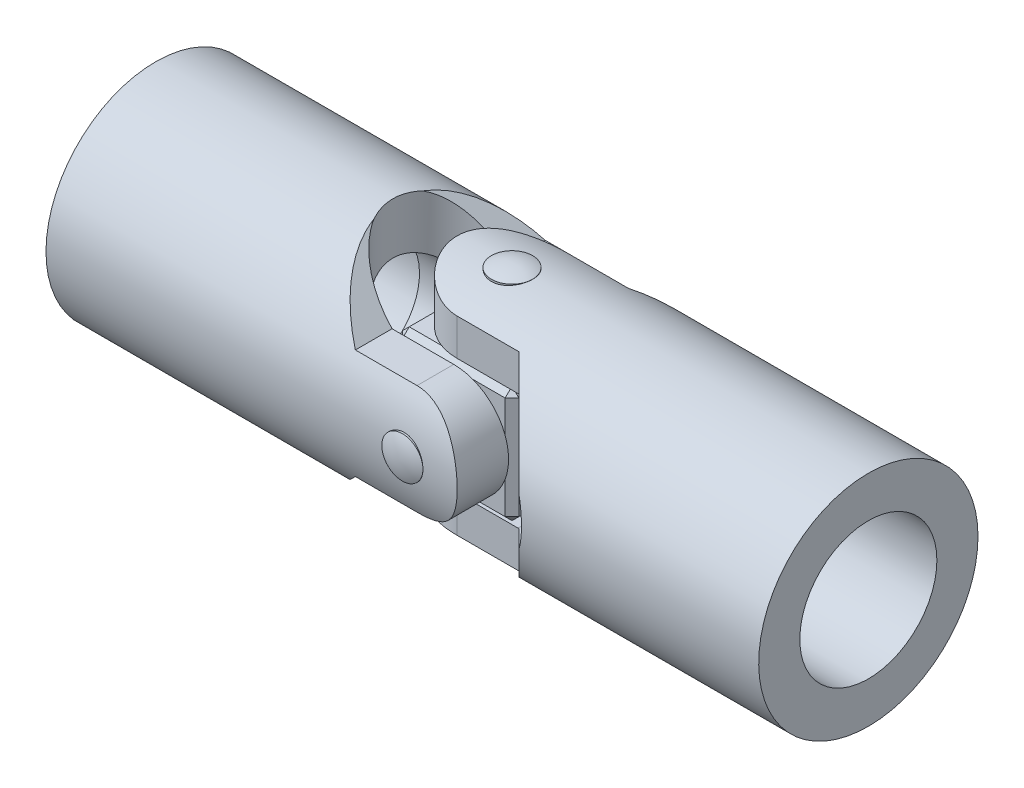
ISO-10303-21;
HEADER;
FILE_DESCRIPTION(('STEP AP214'),'2;1');
FILE_NAME('part.step','',(''),(''),'','','');
FILE_SCHEMA(('AUTOMOTIVE_DESIGN { 1 0 10303 214 1 1 1 1 }'));
ENDSEC;
DATA;
#1=APPLICATION_CONTEXT('core data for automotive mechanical design processes');
#2=APPLICATION_PROTOCOL_DEFINITION('international standard','automotive_design',2000,#1);
#3=PRODUCT_CONTEXT('',#1,'mechanical');
#4=PRODUCT('Part','Part','',(#3));
#5=PRODUCT_RELATED_PRODUCT_CATEGORY('part','',(#4));
#6=PRODUCT_DEFINITION_FORMATION('','',#4);
#7=PRODUCT_DEFINITION_CONTEXT('part definition',#1,'design');
#8=PRODUCT_DEFINITION('design','',#6,#7);
#9=PRODUCT_DEFINITION_SHAPE('','',#8);
#10=(LENGTH_UNIT() NAMED_UNIT(*) SI_UNIT(.MILLI.,.METRE.));
#11=(NAMED_UNIT(*) PLANE_ANGLE_UNIT() SI_UNIT($,.RADIAN.));
#12=(NAMED_UNIT(*) SI_UNIT($,.STERADIAN.) SOLID_ANGLE_UNIT());
#13=UNCERTAINTY_MEASURE_WITH_UNIT(LENGTH_MEASURE(1.E-05),#10,'distance_accuracy_value','');
#14=(GEOMETRIC_REPRESENTATION_CONTEXT(3) GLOBAL_UNCERTAINTY_ASSIGNED_CONTEXT((#13)) GLOBAL_UNIT_ASSIGNED_CONTEXT((#10,
#11,#12)) REPRESENTATION_CONTEXT('',''));
#15=CARTESIAN_POINT('',(0.,0.,0.));
#16=DIRECTION('',(0.,0.,1.));
#17=DIRECTION('',(1.,0.,0.));
#18=AXIS2_PLACEMENT_3D('',#15,#16,#17);
#19=CARTESIAN_POINT('',(0.,8.,0.));
#20=DIRECTION('',(0.,-1.,0.));
#21=DIRECTION('',(-1.,0.,0.));
#22=AXIS2_PLACEMENT_3D('',#19,#20,#21);
#23=CYLINDRICAL_SURFACE('',#22,1.5);
#24=CARTESIAN_POINT('',(0.,8.,0.));
#25=DIRECTION('',(0.,1.,0.));
#26=DIRECTION('',(1.,0.,0.));
#27=AXIS2_PLACEMENT_3D('',#24,#25,#26);
#28=CIRCLE('',#27,1.5);
#29=CARTESIAN_POINT('',(1.5,8.,0.));
#30=VERTEX_POINT('',#29);
#31=EDGE_CURVE('P0_E10',#30,#30,#28,.T.);
#32=ORIENTED_EDGE('',*,*,#31,.F.);
#33=EDGE_LOOP('',(#32));
#34=FACE_BOUND('',#33,.T.);
#35=CARTESIAN_POINT('',(0.,-8.,0.));
#36=DIRECTION('',(0.,1.,0.));
#37=DIRECTION('',(0.,0.,1.));
#38=AXIS2_PLACEMENT_3D('',#35,#36,#37);
#39=CIRCLE('',#38,1.5);
#40=CARTESIAN_POINT('',(0.,-8.,1.5));
#41=VERTEX_POINT('',#40);
#42=EDGE_CURVE('P0_E20',#41,#41,#39,.T.);
#43=ORIENTED_EDGE('',*,*,#42,.T.);
#44=EDGE_LOOP('',(#43));
#45=FACE_BOUND('',#44,.T.);
#46=ADVANCED_FACE('P0_F14',(#34,#45),#23,.T.);
#47=CARTESIAN_POINT('',(0.,4.56306822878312,0.));
#48=DIRECTION('',(0.,1.,0.));
#49=DIRECTION('',(0.,0.,-1.));
#50=AXIS2_PLACEMENT_3D('',#47,#48,#49);
#51=SPHERICAL_SURFACE('',#50,3.75);
#52=ORIENTED_EDGE('',*,*,#31,.T.);
#53=EDGE_LOOP('',(#52));
#54=FACE_BOUND('',#53,.T.);
#55=ADVANCED_FACE('P0_F29',(#54),#51,.T.);
#56=CARTESIAN_POINT('',(0.,-4.56306822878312,0.));
#57=DIRECTION('',(0.,-1.,0.));
#58=DIRECTION('',(0.,0.,-1.));
#59=AXIS2_PLACEMENT_3D('',#56,#57,#58);
#60=SPHERICAL_SURFACE('',#59,3.75);
#61=ORIENTED_EDGE('',*,*,#42,.F.);
#62=EDGE_LOOP('',(#61));
#63=FACE_BOUND('',#62,.T.);
#64=ADVANCED_FACE('P0_F27',(#63),#60,.T.);
#65=CLOSED_SHELL('',(#46,#55,#64));
#66=MANIFOLD_SOLID_BREP('P0_B1',#65);
#67=CARTESIAN_POINT('',(0.,0.,8.));
#68=DIRECTION('',(0.,0.,-1.));
#69=DIRECTION('',(-1.,0.,0.));
#70=AXIS2_PLACEMENT_3D('',#67,#68,#69);
#71=CYLINDRICAL_SURFACE('',#70,1.5);
#72=CARTESIAN_POINT('',(0.,0.,8.));
#73=DIRECTION('',(0.,0.,1.));
#74=DIRECTION('',(1.,0.,0.));
#75=AXIS2_PLACEMENT_3D('',#72,#73,#74);
#76=CIRCLE('',#75,1.5);
#77=CARTESIAN_POINT('',(1.5,0.,8.));
#78=VERTEX_POINT('',#77);
#79=EDGE_CURVE('P1_E10',#78,#78,#76,.T.);
#80=ORIENTED_EDGE('',*,*,#79,.F.);
#81=EDGE_LOOP('',(#80));
#82=FACE_BOUND('',#81,.T.);
#83=CARTESIAN_POINT('',(0.,0.,-8.));
#84=DIRECTION('',(0.,0.,1.));
#85=DIRECTION('',(0.,-1.,0.));
#86=AXIS2_PLACEMENT_3D('',#83,#84,#85);
#87=CIRCLE('',#86,1.5);
#88=CARTESIAN_POINT('',(0.,-1.5,-8.));
#89=VERTEX_POINT('',#88);
#90=EDGE_CURVE('P1_E20',#89,#89,#87,.T.);
#91=ORIENTED_EDGE('',*,*,#90,.T.);
#92=EDGE_LOOP('',(#91));
#93=FACE_BOUND('',#92,.T.);
#94=ADVANCED_FACE('P1_F14',(#82,#93),#71,.T.);
#95=CARTESIAN_POINT('',(0.,0.,4.56306822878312));
#96=DIRECTION('',(0.,0.,1.));
#97=DIRECTION('',(0.,1.,0.));
#98=AXIS2_PLACEMENT_3D('',#95,#96,#97);
#99=SPHERICAL_SURFACE('',#98,3.75);
#100=ORIENTED_EDGE('',*,*,#79,.T.);
#101=EDGE_LOOP('',(#100));
#102=FACE_BOUND('',#101,.T.);
#103=ADVANCED_FACE('P1_F29',(#102),#99,.T.);
#104=CARTESIAN_POINT('',(0.,0.,-4.56306822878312));
#105=DIRECTION('',(0.,0.,-1.));
#106=DIRECTION('',(0.,1.,0.));
#107=AXIS2_PLACEMENT_3D('',#104,#105,#106);
#108=SPHERICAL_SURFACE('',#107,3.75);
#109=ORIENTED_EDGE('',*,*,#90,.F.);
#110=EDGE_LOOP('',(#109));
#111=FACE_BOUND('',#110,.T.);
#112=ADVANCED_FACE('P1_F27',(#111),#108,.T.);
#113=CLOSED_SHELL('',(#94,#103,#112));
#114=MANIFOLD_SOLID_BREP('P1_B1',#113);
#115=CARTESIAN_POINT('',(0.,0.,4.25));
#116=DIRECTION('',(0.,0.,-1.));
#117=DIRECTION('',(-1.,0.,0.));
#118=AXIS2_PLACEMENT_3D('',#115,#116,#117);
#119=CYLINDRICAL_SURFACE('',#118,1.5);
#120=CARTESIAN_POINT('',(0.,0.,0.));
#121=DIRECTION('',(0.,0.707106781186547,-0.707106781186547));
#122=DIRECTION('',(0.,-0.707106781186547,-0.707106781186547));
#123=AXIS2_PLACEMENT_3D('',#120,#121,#122);
#124=ELLIPSE('',#123,2.12132034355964,1.5);
#125=CARTESIAN_POINT('',(1.5,0.,0.));
#126=VERTEX_POINT('',#125);
#127=CARTESIAN_POINT('',(-1.5,0.,0.));
#128=VERTEX_POINT('',#127);
#129=EDGE_CURVE('P2_E116',#126,#128,#124,.F.);
#130=ORIENTED_EDGE('',*,*,#129,.F.);
#131=CARTESIAN_POINT('',(0.,0.,0.));
#132=DIRECTION('',(0.,-0.707106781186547,-0.707106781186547));
#133=DIRECTION('',(0.,0.707106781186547,-0.707106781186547));
#134=AXIS2_PLACEMENT_3D('',#131,#132,#133);
#135=ELLIPSE('',#134,2.12132034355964,1.5);
#136=EDGE_CURVE('P2_E120',#128,#126,#135,.F.);
#137=ORIENTED_EDGE('',*,*,#136,.F.);
#138=EDGE_LOOP('',(#130,#137));
#139=FACE_BOUND('',#138,.T.);
#140=CARTESIAN_POINT('',(0.,0.,4.25));
#141=DIRECTION('',(0.,0.,1.));
#142=DIRECTION('',(1.,0.,0.));
#143=AXIS2_PLACEMENT_3D('',#140,#141,#142);
#144=CIRCLE('',#143,1.5);
#145=CARTESIAN_POINT('',(1.5,0.,4.25));
#146=VERTEX_POINT('',#145);
#147=EDGE_CURVE('P2_E127',#146,#146,#144,.T.);
#148=ORIENTED_EDGE('',*,*,#147,.T.);
#149=EDGE_LOOP('',(#148));
#150=FACE_BOUND('',#149,.T.);
#151=ADVANCED_FACE('P2_F16',(#139,#150),#119,.F.);
#152=CARTESIAN_POINT('',(4.25,4.25,4.25));
#153=DIRECTION('',(0.,0.,1.));
#154=DIRECTION('',(1.,0.,0.));
#155=AXIS2_PLACEMENT_3D('',#152,#153,#154);
#156=PLANE('',#155);
#157=DIRECTION('',(0.,-1.,0.));
#158=VECTOR('',#157,1.);
#159=CARTESIAN_POINT('',(-3.75,-4.25,4.25));
#160=LINE('',#159,#158);
#161=CARTESIAN_POINT('',(-3.75,3.75,4.25));
#162=VERTEX_POINT('',#161);
#163=CARTESIAN_POINT('',(-3.75,-3.75,4.25));
#164=VERTEX_POINT('',#163);
#165=EDGE_CURVE('P2_E164',#162,#164,#160,.T.);
#166=ORIENTED_EDGE('',*,*,#165,.T.);
#167=DIRECTION('',(1.,0.,0.));
#168=VECTOR('',#167,1.);
#169=CARTESIAN_POINT('',(4.25,-3.75,4.25));
#170=LINE('',#169,#168);
#171=CARTESIAN_POINT('',(3.75,-3.75,4.25));
#172=VERTEX_POINT('',#171);
#173=EDGE_CURVE('P2_E168',#164,#172,#170,.T.);
#174=ORIENTED_EDGE('',*,*,#173,.T.);
#175=DIRECTION('',(0.,1.,0.));
#176=VECTOR('',#175,1.);
#177=CARTESIAN_POINT('',(3.75,4.25,4.25));
#178=LINE('',#177,#176);
#179=CARTESIAN_POINT('',(3.75,3.75,4.25));
#180=VERTEX_POINT('',#179);
#181=EDGE_CURVE('P2_E166',#172,#180,#178,.T.);
#182=ORIENTED_EDGE('',*,*,#181,.T.);
#183=DIRECTION('',(-1.,0.,0.));
#184=VECTOR('',#183,1.);
#185=CARTESIAN_POINT('',(-4.25,3.75,4.25));
#186=LINE('',#185,#184);
#187=EDGE_CURVE('P2_E162',#180,#162,#186,.T.);
#188=ORIENTED_EDGE('',*,*,#187,.T.);
#189=EDGE_LOOP('',(#166,#174,#182,#188));
#190=FACE_BOUND('',#189,.T.);
#191=ORIENTED_EDGE('',*,*,#147,.F.);
#192=EDGE_LOOP('',(#191));
#193=FACE_BOUND('',#192,.T.);
#194=ADVANCED_FACE('P2_F282',(#190,#193),#156,.T.);
#195=CARTESIAN_POINT('',(4.25,4.25,-4.25));
#196=DIRECTION('',(0.,0.,1.));
#197=DIRECTION('',(1.,0.,0.));
#198=AXIS2_PLACEMENT_3D('',#195,#196,#197);
#199=PLANE('',#198);
#200=DIRECTION('',(-1.,0.,0.));
#201=VECTOR('',#200,1.);
#202=CARTESIAN_POINT('',(4.25,-3.75,-4.25));
#203=LINE('',#202,#201);
#204=CARTESIAN_POINT('',(3.75,-3.75,-4.25));
#205=VERTEX_POINT('',#204);
#206=CARTESIAN_POINT('',(-3.75,-3.75,-4.25));
#207=VERTEX_POINT('',#206);
#208=EDGE_CURVE('P2_E157',#205,#207,#203,.T.);
#209=ORIENTED_EDGE('',*,*,#208,.T.);
#210=DIRECTION('',(0.,1.,0.));
#211=VECTOR('',#210,1.);
#212=CARTESIAN_POINT('',(-3.75,4.25,-4.25));
#213=LINE('',#212,#211);
#214=CARTESIAN_POINT('',(-3.75,3.75,-4.25));
#215=VERTEX_POINT('',#214);
#216=EDGE_CURVE('P2_E159',#207,#215,#213,.T.);
#217=ORIENTED_EDGE('',*,*,#216,.T.);
#218=DIRECTION('',(1.,0.,0.));
#219=VECTOR('',#218,1.);
#220=CARTESIAN_POINT('',(4.25,3.75,-4.25));
#221=LINE('',#220,#219);
#222=CARTESIAN_POINT('',(3.75,3.75,-4.25));
#223=VERTEX_POINT('',#222);
#224=EDGE_CURVE('P2_E153',#215,#223,#221,.T.);
#225=ORIENTED_EDGE('',*,*,#224,.T.);
#226=DIRECTION('',(0.,-1.,0.));
#227=VECTOR('',#226,1.);
#228=CARTESIAN_POINT('',(3.75,4.25,-4.25));
#229=LINE('',#228,#227);
#230=EDGE_CURVE('P2_E155',#223,#205,#229,.T.);
#231=ORIENTED_EDGE('',*,*,#230,.T.);
#232=EDGE_LOOP('',(#209,#217,#225,#231));
#233=FACE_BOUND('',#232,.T.);
#234=CARTESIAN_POINT('',(0.,0.,-4.25));
#235=DIRECTION('',(0.,0.,1.));
#236=DIRECTION('',(1.,0.,0.));
#237=AXIS2_PLACEMENT_3D('',#234,#235,#236);
#238=CIRCLE('',#237,1.5);
#239=CARTESIAN_POINT('',(1.5,0.,-4.25));
#240=VERTEX_POINT('',#239);
#241=EDGE_CURVE('P2_E259',#240,#240,#238,.T.);
#242=ORIENTED_EDGE('',*,*,#241,.T.);
#243=EDGE_LOOP('',(#242));
#244=FACE_BOUND('',#243,.T.);
#245=ADVANCED_FACE('P2_F267',(#233,#244),#199,.F.);
#246=CARTESIAN_POINT('',(-4.25,4.25,4.25));
#247=DIRECTION('',(0.,-1.,0.));
#248=DIRECTION('',(0.,0.,-1.));
#249=AXIS2_PLACEMENT_3D('',#246,#247,#248);
#250=PLANE('',#249);
#251=DIRECTION('',(-1.,0.,0.));
#252=VECTOR('',#251,1.);
#253=CARTESIAN_POINT('',(-4.25,4.25,-3.75));
#254=LINE('',#253,#252);
#255=CARTESIAN_POINT('',(3.75,4.25,-3.75));
#256=VERTEX_POINT('',#255);
#257=CARTESIAN_POINT('',(-3.75,4.25,-3.75));
#258=VERTEX_POINT('',#257);
#259=EDGE_CURVE('P2_E25',#256,#258,#254,.T.);
#260=ORIENTED_EDGE('',*,*,#259,.T.);
#261=DIRECTION('',(0.,0.,1.));
#262=VECTOR('',#261,1.);
#263=CARTESIAN_POINT('',(-3.75,4.25,4.25));
#264=LINE('',#263,#262);
#265=CARTESIAN_POINT('',(-3.75,4.25,3.75));
#266=VERTEX_POINT('',#265);
#267=EDGE_CURVE('P2_E11',#258,#266,#264,.T.);
#268=ORIENTED_EDGE('',*,*,#267,.T.);
#269=DIRECTION('',(1.,0.,0.));
#270=VECTOR('',#269,1.);
#271=CARTESIAN_POINT('',(4.25,4.25,3.75));
#272=LINE('',#271,#270);
#273=CARTESIAN_POINT('',(3.75,4.25,3.75));
#274=VERTEX_POINT('',#273);
#275=EDGE_CURVE('P2_E180',#266,#274,#272,.T.);
#276=ORIENTED_EDGE('',*,*,#275,.T.);
#277=DIRECTION('',(0.,0.,-1.));
#278=VECTOR('',#277,1.);
#279=CARTESIAN_POINT('',(3.75,4.25,4.25));
#280=LINE('',#279,#278);
#281=EDGE_CURVE('P2_E36',#274,#256,#280,.T.);
#282=ORIENTED_EDGE('',*,*,#281,.T.);
#283=EDGE_LOOP('',(#260,#268,#276,#282));
#284=FACE_BOUND('',#283,.T.);
#285=CARTESIAN_POINT('',(0.,4.25,0.));
#286=DIRECTION('',(0.,1.,0.));
#287=DIRECTION('',(0.,0.,1.));
#288=AXIS2_PLACEMENT_3D('',#285,#286,#287);
#289=CIRCLE('',#288,1.5);
#290=CARTESIAN_POINT('',(0.,4.25,1.5));
#291=VERTEX_POINT('',#290);
#292=EDGE_CURVE('P2_E249',#291,#291,#289,.T.);
#293=ORIENTED_EDGE('',*,*,#292,.F.);
#294=EDGE_LOOP('',(#293));
#295=FACE_BOUND('',#294,.T.);
#296=ADVANCED_FACE('P2_F290',(#284,#295),#250,.F.);
#297=CARTESIAN_POINT('',(-4.25,-4.25,4.25));
#298=DIRECTION('',(1.,0.,0.));
#299=DIRECTION('',(0.,0.,-1.));
#300=AXIS2_PLACEMENT_3D('',#297,#298,#299);
#301=PLANE('',#300);
#302=DIRECTION('',(0.,-1.,0.));
#303=VECTOR('',#302,1.);
#304=CARTESIAN_POINT('',(-4.25,-4.25,-3.75));
#305=LINE('',#304,#303);
#306=CARTESIAN_POINT('',(-4.25,3.75,-3.75));
#307=VERTEX_POINT('',#306);
#308=CARTESIAN_POINT('',(-4.25,-3.75,-3.75));
#309=VERTEX_POINT('',#308);
#310=EDGE_CURVE('P2_E148',#307,#309,#305,.T.);
#311=ORIENTED_EDGE('',*,*,#310,.T.);
#312=DIRECTION('',(0.,0.,1.));
#313=VECTOR('',#312,1.);
#314=CARTESIAN_POINT('',(-4.25,-3.75,4.25));
#315=LINE('',#314,#313);
#316=CARTESIAN_POINT('',(-4.25,-3.75,3.75));
#317=VERTEX_POINT('',#316);
#318=EDGE_CURVE('P2_E150',#309,#317,#315,.T.);
#319=ORIENTED_EDGE('',*,*,#318,.T.);
#320=DIRECTION('',(0.,1.,0.));
#321=VECTOR('',#320,1.);
#322=CARTESIAN_POINT('',(-4.25,4.25,3.75));
#323=LINE('',#322,#321);
#324=CARTESIAN_POINT('',(-4.25,3.75,3.75));
#325=VERTEX_POINT('',#324);
#326=EDGE_CURVE('P2_E146',#317,#325,#323,.T.);
#327=ORIENTED_EDGE('',*,*,#326,.T.);
#328=DIRECTION('',(0.,0.,-1.));
#329=VECTOR('',#328,1.);
#330=CARTESIAN_POINT('',(-4.25,3.75,4.25));
#331=LINE('',#330,#329);
#332=EDGE_CURVE('P2_E144',#325,#307,#331,.T.);
#333=ORIENTED_EDGE('',*,*,#332,.T.);
#334=EDGE_LOOP('',(#311,#319,#327,#333));
#335=FACE_BOUND('',#334,.T.);
#336=ADVANCED_FACE('P2_F297',(#335),#301,.F.);
#337=CARTESIAN_POINT('',(-4.25,-4.25,4.25));
#338=DIRECTION('',(0.,1.,0.));
#339=DIRECTION('',(0.,0.,1.));
#340=AXIS2_PLACEMENT_3D('',#337,#338,#339);
#341=PLANE('',#340);
#342=DIRECTION('',(-1.,0.,0.));
#343=VECTOR('',#342,1.);
#344=CARTESIAN_POINT('',(-4.25,-4.25,3.75));
#345=LINE('',#344,#343);
#346=CARTESIAN_POINT('',(3.75,-4.25,3.75));
#347=VERTEX_POINT('',#346);
#348=CARTESIAN_POINT('',(-3.75,-4.25,3.75));
#349=VERTEX_POINT('',#348);
#350=EDGE_CURVE('P2_E137',#347,#349,#345,.T.);
#351=ORIENTED_EDGE('',*,*,#350,.T.);
#352=DIRECTION('',(0.,0.,-1.));
#353=VECTOR('',#352,1.);
#354=CARTESIAN_POINT('',(-3.75,-4.25,4.25));
#355=LINE('',#354,#353);
#356=CARTESIAN_POINT('',(-3.75,-4.25,-3.75));
#357=VERTEX_POINT('',#356);
#358=EDGE_CURVE('P2_E141',#349,#357,#355,.T.);
#359=ORIENTED_EDGE('',*,*,#358,.T.);
#360=DIRECTION('',(1.,0.,0.));
#361=VECTOR('',#360,1.);
#362=CARTESIAN_POINT('',(-4.25,-4.25,-3.75));
#363=LINE('',#362,#361);
#364=CARTESIAN_POINT('',(3.75,-4.25,-3.75));
#365=VERTEX_POINT('',#364);
#366=EDGE_CURVE('P2_E139',#357,#365,#363,.T.);
#367=ORIENTED_EDGE('',*,*,#366,.T.);
#368=DIRECTION('',(0.,0.,1.));
#369=VECTOR('',#368,1.);
#370=CARTESIAN_POINT('',(3.75,-4.25,4.25));
#371=LINE('',#370,#369);
#372=EDGE_CURVE('P2_E130',#365,#347,#371,.T.);
#373=ORIENTED_EDGE('',*,*,#372,.T.);
#374=EDGE_LOOP('',(#351,#359,#367,#373));
#375=FACE_BOUND('',#374,.T.);
#376=CARTESIAN_POINT('',(0.,-4.25,0.));
#377=DIRECTION('',(0.,1.,0.));
#378=DIRECTION('',(0.,0.,1.));
#379=AXIS2_PLACEMENT_3D('',#376,#377,#378);
#380=CIRCLE('',#379,1.5);
#381=CARTESIAN_POINT('',(0.,-4.25,1.5));
#382=VERTEX_POINT('',#381);
#383=EDGE_CURVE('P2_E255',#382,#382,#380,.T.);
#384=ORIENTED_EDGE('',*,*,#383,.T.);
#385=EDGE_LOOP('',(#384));
#386=FACE_BOUND('',#385,.T.);
#387=ADVANCED_FACE('P2_F277',(#375,#386),#341,.F.);
#388=CARTESIAN_POINT('',(4.25,-4.25,4.25));
#389=DIRECTION('',(-1.,0.,0.));
#390=DIRECTION('',(0.,0.,1.));
#391=AXIS2_PLACEMENT_3D('',#388,#389,#390);
#392=PLANE('',#391);
#393=DIRECTION('',(0.,-1.,0.));
#394=VECTOR('',#393,1.);
#395=CARTESIAN_POINT('',(4.25,-4.25,3.75));
#396=LINE('',#395,#394);
#397=CARTESIAN_POINT('',(4.25,3.75,3.75));
#398=VERTEX_POINT('',#397);
#399=CARTESIAN_POINT('',(4.25,-3.75,3.75));
#400=VERTEX_POINT('',#399);
#401=EDGE_CURVE('P2_E173',#398,#400,#396,.T.);
#402=ORIENTED_EDGE('',*,*,#401,.T.);
#403=DIRECTION('',(0.,0.,-1.));
#404=VECTOR('',#403,1.);
#405=CARTESIAN_POINT('',(4.25,-3.75,4.25));
#406=LINE('',#405,#404);
#407=CARTESIAN_POINT('',(4.25,-3.75,-3.75));
#408=VERTEX_POINT('',#407);
#409=EDGE_CURVE('P2_E177',#400,#408,#406,.T.);
#410=ORIENTED_EDGE('',*,*,#409,.T.);
#411=DIRECTION('',(0.,1.,0.));
#412=VECTOR('',#411,1.);
#413=CARTESIAN_POINT('',(4.25,-4.25,-3.75));
#414=LINE('',#413,#412);
#415=CARTESIAN_POINT('',(4.25,3.75,-3.75));
#416=VERTEX_POINT('',#415);
#417=EDGE_CURVE('P2_E175',#408,#416,#414,.T.);
#418=ORIENTED_EDGE('',*,*,#417,.T.);
#419=DIRECTION('',(0.,0.,1.));
#420=VECTOR('',#419,1.);
#421=CARTESIAN_POINT('',(4.25,3.75,4.25));
#422=LINE('',#421,#420);
#423=EDGE_CURVE('P2_E171',#416,#398,#422,.T.);
#424=ORIENTED_EDGE('',*,*,#423,.T.);
#425=EDGE_LOOP('',(#402,#410,#418,#424));
#426=FACE_BOUND('',#425,.T.);
#427=ADVANCED_FACE('P2_F269',(#426),#392,.F.);
#428=CARTESIAN_POINT('',(0.,0.,0.));
#429=DIRECTION('',(0.,0.707106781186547,-0.707106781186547));
#430=DIRECTION('',(0.,-0.707106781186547,-0.707106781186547));
#431=AXIS2_PLACEMENT_3D('',#428,#429,#430);
#432=ELLIPSE('',#431,2.12132034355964,1.5);
#433=EDGE_CURVE('P2_E119',#126,#128,#432,.T.);
#434=ORIENTED_EDGE('',*,*,#433,.F.);
#435=CARTESIAN_POINT('',(0.,0.,0.));
#436=DIRECTION('',(0.,-0.707106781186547,-0.707106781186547));
#437=DIRECTION('',(0.,0.707106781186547,-0.707106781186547));
#438=AXIS2_PLACEMENT_3D('',#435,#436,#437);
#439=ELLIPSE('',#438,2.12132034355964,1.5);
#440=EDGE_CURVE('P2_E111',#128,#126,#439,.T.);
#441=ORIENTED_EDGE('',*,*,#440,.F.);
#442=EDGE_LOOP('',(#434,#441));
#443=FACE_BOUND('',#442,.T.);
#444=ORIENTED_EDGE('',*,*,#241,.F.);
#445=EDGE_LOOP('',(#444));
#446=FACE_BOUND('',#445,.T.);
#447=ADVANCED_FACE('P2_F132',(#443,#446),#119,.F.);
#448=CARTESIAN_POINT('',(0.,-4.25,0.));
#449=DIRECTION('',(0.,1.,0.));
#450=DIRECTION('',(0.,0.,1.));
#451=AXIS2_PLACEMENT_3D('',#448,#449,#450);
#452=CYLINDRICAL_SURFACE('',#451,1.5);
#453=ORIENTED_EDGE('',*,*,#433,.T.);
#454=ORIENTED_EDGE('',*,*,#136,.T.);
#455=EDGE_LOOP('',(#453,#454));
#456=FACE_BOUND('',#455,.T.);
#457=ORIENTED_EDGE('',*,*,#383,.F.);
#458=EDGE_LOOP('',(#457));
#459=FACE_BOUND('',#458,.T.);
#460=ADVANCED_FACE('P2_F124',(#456,#459),#452,.F.);
#461=ORIENTED_EDGE('',*,*,#129,.T.);
#462=ORIENTED_EDGE('',*,*,#440,.T.);
#463=EDGE_LOOP('',(#461,#462));
#464=FACE_BOUND('',#463,.T.);
#465=ORIENTED_EDGE('',*,*,#292,.T.);
#466=EDGE_LOOP('',(#465));
#467=FACE_BOUND('',#466,.T.);
#468=ADVANCED_FACE('P2_F113',(#464,#467),#452,.F.);
#469=CARTESIAN_POINT('',(3.75,4.25,4.25));
#470=DIRECTION('',(-0.707106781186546,-0.707106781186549,0.));
#471=DIRECTION('',(0.707106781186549,-0.707106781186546,0.));
#472=AXIS2_PLACEMENT_3D('',#469,#470,#471);
#473=PLANE('',#472);
#474=DIRECTION('',(0.707106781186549,-0.707106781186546,0.));
#475=VECTOR('',#474,1.);
#476=CARTESIAN_POINT('',(4.,4.,3.75));
#477=LINE('',#476,#475);
#478=EDGE_CURVE('P2_E20',#398,#274,#477,.F.);
#479=ORIENTED_EDGE('',*,*,#478,.F.);
#480=ORIENTED_EDGE('',*,*,#423,.F.);
#481=DIRECTION('',(-0.707106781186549,0.707106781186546,0.));
#482=VECTOR('',#481,1.);
#483=CARTESIAN_POINT('',(4.25,3.75,-3.75));
#484=LINE('',#483,#482);
#485=EDGE_CURVE('P2_E243',#256,#416,#484,.F.);
#486=ORIENTED_EDGE('',*,*,#485,.F.);
#487=ORIENTED_EDGE('',*,*,#281,.F.);
#488=EDGE_LOOP('',(#479,#480,#486,#487));
#489=FACE_BOUND('',#488,.T.);
#490=ADVANCED_FACE('P2_F18',(#489),#473,.F.);
#491=CARTESIAN_POINT('',(3.75,3.75,4.25));
#492=DIRECTION('',(0.577350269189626,0.577350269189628,0.577350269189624));
#493=DIRECTION('',(-0.707106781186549,0.707106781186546,0.));
#494=AXIS2_PLACEMENT_3D('',#491,#492,#493);
#495=PLANE('',#494);
#496=DIRECTION('',(0.707106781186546,0.,-0.707106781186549));
#497=VECTOR('',#496,1.);
#498=CARTESIAN_POINT('',(3.75,3.75,4.25));
#499=LINE('',#498,#497);
#500=EDGE_CURVE('P2_E238',#398,#180,#499,.F.);
#501=ORIENTED_EDGE('',*,*,#500,.F.);
#502=ORIENTED_EDGE('',*,*,#478,.T.);
#503=DIRECTION('',(0.,-0.707106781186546,0.707106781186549));
#504=VECTOR('',#503,1.);
#505=CARTESIAN_POINT('',(3.75,3.75,4.25));
#506=LINE('',#505,#504);
#507=EDGE_CURVE('P2_E241',#180,#274,#506,.F.);
#508=ORIENTED_EDGE('',*,*,#507,.F.);
#509=EDGE_LOOP('',(#501,#502,#508));
#510=FACE_BOUND('',#509,.T.);
#511=ADVANCED_FACE('P2_F374',(#510),#495,.T.);
#512=CARTESIAN_POINT('',(4.25,3.75,-3.75));
#513=DIRECTION('',(0.577350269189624,0.577350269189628,-0.577350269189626));
#514=DIRECTION('',(0.,0.707106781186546,0.707106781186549));
#515=AXIS2_PLACEMENT_3D('',#512,#513,#514);
#516=PLANE('',#515);
#517=DIRECTION('',(0.,-0.707106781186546,-0.707106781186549));
#518=VECTOR('',#517,1.);
#519=CARTESIAN_POINT('',(3.75,4.,-4.));
#520=LINE('',#519,#518);
#521=EDGE_CURVE('P2_E232',#256,#223,#520,.T.);
#522=ORIENTED_EDGE('',*,*,#521,.F.);
#523=ORIENTED_EDGE('',*,*,#485,.T.);
#524=DIRECTION('',(0.707106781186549,0.,0.707106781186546));
#525=VECTOR('',#524,1.);
#526=CARTESIAN_POINT('',(4.25,3.75,-3.75));
#527=LINE('',#526,#525);
#528=EDGE_CURVE('P2_E235',#223,#416,#527,.T.);
#529=ORIENTED_EDGE('',*,*,#528,.F.);
#530=EDGE_LOOP('',(#522,#523,#529));
#531=FACE_BOUND('',#530,.T.);
#532=ADVANCED_FACE('P2_F371',(#531),#516,.T.);
#533=CARTESIAN_POINT('',(4.25,3.75,4.25));
#534=DIRECTION('',(0.,0.707106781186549,0.707106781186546));
#535=DIRECTION('',(0.,-0.707106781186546,0.707106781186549));
#536=AXIS2_PLACEMENT_3D('',#533,#534,#535);
#537=PLANE('',#536);
#538=ORIENTED_EDGE('',*,*,#507,.T.);
#539=ORIENTED_EDGE('',*,*,#275,.F.);
#540=DIRECTION('',(0.,0.707106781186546,-0.707106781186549));
#541=VECTOR('',#540,1.);
#542=CARTESIAN_POINT('',(-3.75,4.,4.));
#543=LINE('',#542,#541);
#544=EDGE_CURVE('P2_E227',#162,#266,#543,.T.);
#545=ORIENTED_EDGE('',*,*,#544,.F.);
#546=ORIENTED_EDGE('',*,*,#187,.F.);
#547=EDGE_LOOP('',(#538,#539,#545,#546));
#548=FACE_BOUND('',#547,.T.);
#549=ADVANCED_FACE('P2_F367',(#548),#537,.T.);
#550=CARTESIAN_POINT('',(3.75,4.25,4.25));
#551=DIRECTION('',(0.707106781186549,0.,0.707106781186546));
#552=DIRECTION('',(0.707106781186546,0.,-0.707106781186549));
#553=AXIS2_PLACEMENT_3D('',#550,#551,#552);
#554=PLANE('',#553);
#555=ORIENTED_EDGE('',*,*,#500,.T.);
#556=ORIENTED_EDGE('',*,*,#181,.F.);
#557=DIRECTION('',(-0.707106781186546,0.,0.707106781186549));
#558=VECTOR('',#557,1.);
#559=CARTESIAN_POINT('',(3.75,-3.75,4.25));
#560=LINE('',#559,#558);
#561=EDGE_CURVE('P2_E224',#400,#172,#560,.T.);
#562=ORIENTED_EDGE('',*,*,#561,.F.);
#563=ORIENTED_EDGE('',*,*,#401,.F.);
#564=EDGE_LOOP('',(#555,#556,#562,#563));
#565=FACE_BOUND('',#564,.T.);
#566=ADVANCED_FACE('P2_F363',(#565),#554,.T.);
#567=CARTESIAN_POINT('',(4.25,-3.75,4.25));
#568=DIRECTION('',(-0.707106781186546,0.707106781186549,0.));
#569=DIRECTION('',(-0.707106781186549,-0.707106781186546,0.));
#570=AXIS2_PLACEMENT_3D('',#567,#568,#569);
#571=PLANE('',#570);
#572=DIRECTION('',(0.707106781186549,0.707106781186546,0.));
#573=VECTOR('',#572,1.);
#574=CARTESIAN_POINT('',(3.75,-4.25,-3.75));
#575=LINE('',#574,#573);
#576=EDGE_CURVE('P2_E218',#408,#365,#575,.F.);
#577=ORIENTED_EDGE('',*,*,#576,.F.);
#578=ORIENTED_EDGE('',*,*,#409,.F.);
#579=DIRECTION('',(-0.707106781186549,-0.707106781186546,0.));
#580=VECTOR('',#579,1.);
#581=CARTESIAN_POINT('',(4.,-4.,3.75));
#582=LINE('',#581,#580);
#583=EDGE_CURVE('P2_E221',#347,#400,#582,.F.);
#584=ORIENTED_EDGE('',*,*,#583,.F.);
#585=ORIENTED_EDGE('',*,*,#372,.F.);
#586=EDGE_LOOP('',(#577,#578,#584,#585));
#587=FACE_BOUND('',#586,.T.);
#588=ADVANCED_FACE('P2_F359',(#587),#571,.F.);
#589=CARTESIAN_POINT('',(4.25,-4.25,-3.75));
#590=DIRECTION('',(-0.707106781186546,0.,0.707106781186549));
#591=DIRECTION('',(0.707106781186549,0.,0.707106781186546));
#592=AXIS2_PLACEMENT_3D('',#589,#590,#591);
#593=PLANE('',#592);
#594=ORIENTED_EDGE('',*,*,#528,.T.);
#595=ORIENTED_EDGE('',*,*,#417,.F.);
#596=DIRECTION('',(-0.707106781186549,0.,-0.707106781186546));
#597=VECTOR('',#596,1.);
#598=CARTESIAN_POINT('',(4.,-3.75,-4.));
#599=LINE('',#598,#597);
#600=EDGE_CURVE('P2_E216',#205,#408,#599,.F.);
#601=ORIENTED_EDGE('',*,*,#600,.F.);
#602=ORIENTED_EDGE('',*,*,#230,.F.);
#603=EDGE_LOOP('',(#594,#595,#601,#602));
#604=FACE_BOUND('',#603,.T.);
#605=ADVANCED_FACE('P2_F355',(#604),#593,.F.);
#606=CARTESIAN_POINT('',(-4.25,4.25,-3.75));
#607=DIRECTION('',(0.,-0.707106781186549,0.707106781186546));
#608=DIRECTION('',(0.,-0.707106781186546,-0.707106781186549));
#609=AXIS2_PLACEMENT_3D('',#606,#607,#608);
#610=PLANE('',#609);
#611=ORIENTED_EDGE('',*,*,#521,.T.);
#612=ORIENTED_EDGE('',*,*,#224,.F.);
#613=DIRECTION('',(0.,0.707106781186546,0.707106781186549));
#614=VECTOR('',#613,1.);
#615=CARTESIAN_POINT('',(-3.75,3.75,-4.25));
#616=LINE('',#615,#614);
#617=EDGE_CURVE('P2_E213',#258,#215,#616,.F.);
#618=ORIENTED_EDGE('',*,*,#617,.F.);
#619=ORIENTED_EDGE('',*,*,#259,.F.);
#620=EDGE_LOOP('',(#611,#612,#618,#619));
#621=FACE_BOUND('',#620,.T.);
#622=ADVANCED_FACE('P2_F351',(#621),#610,.F.);
#623=CARTESIAN_POINT('',(-4.25,3.75,4.25));
#624=DIRECTION('',(0.707106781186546,-0.707106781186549,0.));
#625=DIRECTION('',(0.707106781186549,0.707106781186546,0.));
#626=AXIS2_PLACEMENT_3D('',#623,#624,#625);
#627=PLANE('',#626);
#628=DIRECTION('',(0.707106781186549,0.707106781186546,0.));
#629=VECTOR('',#628,1.);
#630=CARTESIAN_POINT('',(-4.25,3.75,3.75));
#631=LINE('',#630,#629);
#632=EDGE_CURVE('P2_E229',#266,#325,#631,.F.);
#633=ORIENTED_EDGE('',*,*,#632,.F.);
#634=ORIENTED_EDGE('',*,*,#267,.F.);
#635=DIRECTION('',(-0.707106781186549,-0.707106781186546,0.));
#636=VECTOR('',#635,1.);
#637=CARTESIAN_POINT('',(-4.,4.,-3.75));
#638=LINE('',#637,#636);
#639=EDGE_CURVE('P2_E210',#307,#258,#638,.F.);
#640=ORIENTED_EDGE('',*,*,#639,.F.);
#641=ORIENTED_EDGE('',*,*,#332,.F.);
#642=EDGE_LOOP('',(#633,#634,#640,#641));
#643=FACE_BOUND('',#642,.T.);
#644=ADVANCED_FACE('P2_F347',(#643),#627,.F.);
#645=CARTESIAN_POINT('',(-4.25,3.75,3.75));
#646=DIRECTION('',(-0.577350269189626,0.577350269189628,0.577350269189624));
#647=DIRECTION('',(-0.707106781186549,-0.707106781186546,0.));
#648=AXIS2_PLACEMENT_3D('',#645,#646,#647);
#649=PLANE('',#648);
#650=ORIENTED_EDGE('',*,*,#544,.T.);
#651=ORIENTED_EDGE('',*,*,#632,.T.);
#652=DIRECTION('',(0.707106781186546,0.,0.707106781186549));
#653=VECTOR('',#652,1.);
#654=CARTESIAN_POINT('',(-4.25,3.75,3.75));
#655=LINE('',#654,#653);
#656=EDGE_CURVE('P2_E207',#162,#325,#655,.F.);
#657=ORIENTED_EDGE('',*,*,#656,.F.);
#658=EDGE_LOOP('',(#650,#651,#657));
#659=FACE_BOUND('',#658,.T.);
#660=ADVANCED_FACE('P2_F343',(#659),#649,.T.);
#661=CARTESIAN_POINT('',(3.75,-3.75,4.25));
#662=DIRECTION('',(0.577350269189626,-0.577350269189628,0.577350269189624));
#663=DIRECTION('',(0.707106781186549,0.707106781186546,0.));
#664=AXIS2_PLACEMENT_3D('',#661,#662,#663);
#665=PLANE('',#664);
#666=ORIENTED_EDGE('',*,*,#583,.T.);
#667=ORIENTED_EDGE('',*,*,#561,.T.);
#668=DIRECTION('',(0.,-0.707106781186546,-0.707106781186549));
#669=VECTOR('',#668,1.);
#670=CARTESIAN_POINT('',(3.75,-3.75,4.25));
#671=LINE('',#670,#669);
#672=EDGE_CURVE('P2_E205',#347,#172,#671,.F.);
#673=ORIENTED_EDGE('',*,*,#672,.F.);
#674=EDGE_LOOP('',(#666,#667,#673));
#675=FACE_BOUND('',#674,.T.);
#676=ADVANCED_FACE('P2_F339',(#675),#665,.T.);
#677=CARTESIAN_POINT('',(3.75,-4.25,-3.75));
#678=DIRECTION('',(0.577350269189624,-0.577350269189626,-0.577350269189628));
#679=DIRECTION('',(0.,0.707106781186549,-0.707106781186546));
#680=AXIS2_PLACEMENT_3D('',#677,#678,#679);
#681=PLANE('',#680);
#682=ORIENTED_EDGE('',*,*,#600,.T.);
#683=ORIENTED_EDGE('',*,*,#576,.T.);
#684=DIRECTION('',(0.,-0.707106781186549,0.707106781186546));
#685=VECTOR('',#684,1.);
#686=CARTESIAN_POINT('',(3.75,-4.25,-3.75));
#687=LINE('',#686,#685);
#688=EDGE_CURVE('P2_E202',#205,#365,#687,.T.);
#689=ORIENTED_EDGE('',*,*,#688,.F.);
#690=EDGE_LOOP('',(#682,#683,#689));
#691=FACE_BOUND('',#690,.T.);
#692=ADVANCED_FACE('P2_F335',(#691),#681,.T.);
#693=CARTESIAN_POINT('',(-3.75,3.75,-4.25));
#694=DIRECTION('',(-0.577350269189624,0.577350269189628,-0.577350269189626));
#695=DIRECTION('',(0.,0.707106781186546,0.707106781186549));
#696=AXIS2_PLACEMENT_3D('',#693,#694,#695);
#697=PLANE('',#696);
#698=ORIENTED_EDGE('',*,*,#639,.T.);
#699=ORIENTED_EDGE('',*,*,#617,.T.);
#700=DIRECTION('',(0.707106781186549,0.,-0.707106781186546));
#701=VECTOR('',#700,1.);
#702=CARTESIAN_POINT('',(-3.75,3.75,-4.25));
#703=LINE('',#702,#701);
#704=EDGE_CURVE('P2_E200',#307,#215,#703,.T.);
#705=ORIENTED_EDGE('',*,*,#704,.F.);
#706=EDGE_LOOP('',(#698,#699,#705));
#707=FACE_BOUND('',#706,.T.);
#708=ADVANCED_FACE('P2_F331',(#707),#697,.T.);
#709=CARTESIAN_POINT('',(-3.75,4.25,4.25));
#710=DIRECTION('',(-0.707106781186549,0.,0.707106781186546));
#711=DIRECTION('',(0.707106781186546,0.,0.707106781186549));
#712=AXIS2_PLACEMENT_3D('',#709,#710,#711);
#713=PLANE('',#712);
#714=ORIENTED_EDGE('',*,*,#656,.T.);
#715=ORIENTED_EDGE('',*,*,#326,.F.);
#716=DIRECTION('',(-0.707106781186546,0.,-0.707106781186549));
#717=VECTOR('',#716,1.);
#718=CARTESIAN_POINT('',(-4.25,-3.75,3.75));
#719=LINE('',#718,#717);
#720=EDGE_CURVE('P2_E197',#164,#317,#719,.T.);
#721=ORIENTED_EDGE('',*,*,#720,.F.);
#722=ORIENTED_EDGE('',*,*,#165,.F.);
#723=EDGE_LOOP('',(#714,#715,#721,#722));
#724=FACE_BOUND('',#723,.T.);
#725=ADVANCED_FACE('P2_F327',(#724),#713,.T.);
#726=CARTESIAN_POINT('',(4.25,-3.75,4.25));
#727=DIRECTION('',(0.,-0.707106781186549,0.707106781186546));
#728=DIRECTION('',(0.,-0.707106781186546,-0.707106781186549));
#729=AXIS2_PLACEMENT_3D('',#726,#727,#728);
#730=PLANE('',#729);
#731=ORIENTED_EDGE('',*,*,#672,.T.);
#732=ORIENTED_EDGE('',*,*,#173,.F.);
#733=DIRECTION('',(0.,0.707106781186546,0.707106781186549));
#734=VECTOR('',#733,1.);
#735=CARTESIAN_POINT('',(-3.75,-4.,4.));
#736=LINE('',#735,#734);
#737=EDGE_CURVE('P2_E194',#349,#164,#736,.T.);
#738=ORIENTED_EDGE('',*,*,#737,.F.);
#739=ORIENTED_EDGE('',*,*,#350,.F.);
#740=EDGE_LOOP('',(#731,#732,#738,#739));
#741=FACE_BOUND('',#740,.T.);
#742=ADVANCED_FACE('P2_F323',(#741),#730,.T.);
#743=CARTESIAN_POINT('',(-4.25,-4.25,-3.75));
#744=DIRECTION('',(0.,0.707106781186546,0.707106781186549));
#745=DIRECTION('',(0.,-0.707106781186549,0.707106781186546));
#746=AXIS2_PLACEMENT_3D('',#743,#744,#745);
#747=PLANE('',#746);
#748=ORIENTED_EDGE('',*,*,#688,.T.);
#749=ORIENTED_EDGE('',*,*,#366,.F.);
#750=DIRECTION('',(0.,0.707106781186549,-0.707106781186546));
#751=VECTOR('',#750,1.);
#752=CARTESIAN_POINT('',(-3.75,-4.25,-3.75));
#753=LINE('',#752,#751);
#754=EDGE_CURVE('P2_E191',#207,#357,#753,.F.);
#755=ORIENTED_EDGE('',*,*,#754,.F.);
#756=ORIENTED_EDGE('',*,*,#208,.F.);
#757=EDGE_LOOP('',(#748,#749,#755,#756));
#758=FACE_BOUND('',#757,.T.);
#759=ADVANCED_FACE('P2_F319',(#758),#747,.F.);
#760=CARTESIAN_POINT('',(-4.25,-4.25,-3.75));
#761=DIRECTION('',(0.707106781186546,0.,0.707106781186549));
#762=DIRECTION('',(0.707106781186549,0.,-0.707106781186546));
#763=AXIS2_PLACEMENT_3D('',#760,#761,#762);
#764=PLANE('',#763);
#765=ORIENTED_EDGE('',*,*,#704,.T.);
#766=ORIENTED_EDGE('',*,*,#216,.F.);
#767=DIRECTION('',(-0.707106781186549,0.,0.707106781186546));
#768=VECTOR('',#767,1.);
#769=CARTESIAN_POINT('',(-4.,-3.75,-4.));
#770=LINE('',#769,#768);
#771=EDGE_CURVE('P2_E188',#309,#207,#770,.F.);
#772=ORIENTED_EDGE('',*,*,#771,.F.);
#773=ORIENTED_EDGE('',*,*,#310,.F.);
#774=EDGE_LOOP('',(#765,#766,#772,#773));
#775=FACE_BOUND('',#774,.T.);
#776=ADVANCED_FACE('P2_F315',(#775),#764,.F.);
#777=CARTESIAN_POINT('',(-4.25,-3.75,3.75));
#778=DIRECTION('',(-0.577350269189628,-0.577350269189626,0.577350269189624));
#779=DIRECTION('',(0.707106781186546,-0.707106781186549,0.));
#780=AXIS2_PLACEMENT_3D('',#777,#778,#779);
#781=PLANE('',#780);
#782=ORIENTED_EDGE('',*,*,#737,.T.);
#783=ORIENTED_EDGE('',*,*,#720,.T.);
#784=DIRECTION('',(-0.707106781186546,0.707106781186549,0.));
#785=VECTOR('',#784,1.);
#786=CARTESIAN_POINT('',(-4.25,-3.75,3.75));
#787=LINE('',#786,#785);
#788=EDGE_CURVE('P2_E186',#349,#317,#787,.T.);
#789=ORIENTED_EDGE('',*,*,#788,.F.);
#790=EDGE_LOOP('',(#782,#783,#789));
#791=FACE_BOUND('',#790,.T.);
#792=ADVANCED_FACE('P2_F311',(#791),#781,.T.);
#793=CARTESIAN_POINT('',(-3.75,-4.25,-3.75));
#794=DIRECTION('',(-0.577350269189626,-0.577350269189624,-0.577350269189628));
#795=DIRECTION('',(-0.707106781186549,0.,0.707106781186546));
#796=AXIS2_PLACEMENT_3D('',#793,#794,#795);
#797=PLANE('',#796);
#798=ORIENTED_EDGE('',*,*,#771,.T.);
#799=ORIENTED_EDGE('',*,*,#754,.T.);
#800=DIRECTION('',(0.707106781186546,-0.707106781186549,0.));
#801=VECTOR('',#800,1.);
#802=CARTESIAN_POINT('',(-3.75,-4.25,-3.75));
#803=LINE('',#802,#801);
#804=EDGE_CURVE('P2_E184',#309,#357,#803,.T.);
#805=ORIENTED_EDGE('',*,*,#804,.F.);
#806=EDGE_LOOP('',(#798,#799,#805));
#807=FACE_BOUND('',#806,.T.);
#808=ADVANCED_FACE('P2_F307',(#807),#797,.T.);
#809=CARTESIAN_POINT('',(-3.75,-4.25,4.25));
#810=DIRECTION('',(0.707106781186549,0.707106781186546,0.));
#811=DIRECTION('',(-0.707106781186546,0.707106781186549,0.));
#812=AXIS2_PLACEMENT_3D('',#809,#810,#811);
#813=PLANE('',#812);
#814=ORIENTED_EDGE('',*,*,#788,.T.);
#815=ORIENTED_EDGE('',*,*,#318,.F.);
#816=ORIENTED_EDGE('',*,*,#804,.T.);
#817=ORIENTED_EDGE('',*,*,#358,.F.);
#818=EDGE_LOOP('',(#814,#815,#816,#817));
#819=FACE_BOUND('',#818,.T.);
#820=ADVANCED_FACE('P2_F304',(#819),#813,.F.);
#821=CLOSED_SHELL('',(#151,#194,#245,#296,#336,#387,#427,#447,#460,#468,#490,#511,#532,#549,
#566,#588,#605,#622,#644,#660,#676,#692,#708,#725,#742,#759,#776,#792,#808,#820));
#822=MANIFOLD_SOLID_BREP('P2_B1',#821);
#823=CARTESIAN_POINT('',(-8.49999999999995,8.00000000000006,-8.));
#824=DIRECTION('',(-0.707106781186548,-0.707106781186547,0.));
#825=DIRECTION('',(0.707106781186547,-0.707106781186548,0.));
#826=AXIS2_PLACEMENT_3D('',#823,#824,#825);
#827=PLANE('',#826);
#828=CARTESIAN_POINT('',(-0.499999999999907,0.,0.));
#829=DIRECTION('',(-0.707106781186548,-0.707106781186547,0.));
#830=DIRECTION('',(0.707106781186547,-0.707106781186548,0.));
#831=AXIS2_PLACEMENT_3D('',#828,#829,#830);
#832=ELLIPSE('',#831,11.3137084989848,8.);
#833=CARTESIAN_POINT('',(-8.29963197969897,7.79963197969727,-1.77925292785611));
#834=VERTEX_POINT('',#833);
#835=CARTESIAN_POINT('',(-4.49999999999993,4.00000000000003,-6.92820323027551));
#836=VERTEX_POINT('',#835);
#837=EDGE_CURVE('P3_E264',#834,#836,#832,.T.);
#838=ORIENTED_EDGE('',*,*,#837,.F.);
#839=CARTESIAN_POINT('',(-4.43999999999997,3.94000000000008,0.));
#840=DIRECTION('',(-0.707106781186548,-0.707106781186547,0.));
#841=DIRECTION('',(-0.707106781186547,0.707106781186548,0.));
#842=AXIS2_PLACEMENT_3D('',#839,#840,#841);
#843=ELLIPSE('',#842,6.01040764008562,4.25);
#844=CARTESIAN_POINT('',(-4.49999999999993,4.00000000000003,-4.24957644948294));
#845=VERTEX_POINT('',#844);
#846=EDGE_CURVE('P3_E178',#834,#845,#843,.T.);
#847=ORIENTED_EDGE('',*,*,#846,.T.);
#848=DIRECTION('',(0.,0.,1.));
#849=VECTOR('',#848,1.);
#850=CARTESIAN_POINT('',(-4.49999999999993,4.00000000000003,-8.));
#851=LINE('',#850,#849);
#852=EDGE_CURVE('P3_E207',#836,#845,#851,.T.);
#853=ORIENTED_EDGE('',*,*,#852,.F.);
#854=EDGE_LOOP('',(#838,#847,#853));
#855=FACE_BOUND('',#854,.T.);
#856=ADVANCED_FACE('P3_F16',(#855),#827,.F.);
#857=CARTESIAN_POINT('',(-4.49999999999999,-3.99999999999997,-8.));
#858=DIRECTION('',(-0.707106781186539,0.707106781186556,0.));
#859=DIRECTION('',(-0.707106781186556,-0.707106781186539,0.));
#860=AXIS2_PLACEMENT_3D('',#857,#858,#859);
#861=PLANE('',#860);
#862=DIRECTION('',(0.,0.,1.));
#863=VECTOR('',#862,1.);
#864=CARTESIAN_POINT('',(-4.49999999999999,-3.99999999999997,-8.));
#865=LINE('',#864,#863);
#866=CARTESIAN_POINT('',(-4.49999999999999,-3.99999999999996,-6.92820323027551));
#867=VERTEX_POINT('',#866);
#868=CARTESIAN_POINT('',(-4.49999999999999,-3.99999999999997,-4.24957644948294));
#869=VERTEX_POINT('',#868);
#870=EDGE_CURVE('P3_E211',#867,#869,#865,.T.);
#871=ORIENTED_EDGE('',*,*,#870,.T.);
#872=CARTESIAN_POINT('',(-4.44000000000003,-3.94,0.));
#873=DIRECTION('',(-0.707106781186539,0.707106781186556,0.));
#874=DIRECTION('',(0.707106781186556,0.707106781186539,0.));
#875=AXIS2_PLACEMENT_3D('',#872,#873,#874);
#876=ELLIPSE('',#875,6.01040764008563,4.25);
#877=CARTESIAN_POINT('',(-8.29963197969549,-7.79963197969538,-1.7792529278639));
#878=VERTEX_POINT('',#877);
#879=EDGE_CURVE('P3_E120',#869,#878,#876,.T.);
#880=ORIENTED_EDGE('',*,*,#879,.T.);
#881=CARTESIAN_POINT('',(-0.499999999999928,0.,0.));
#882=DIRECTION('',(-0.707106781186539,0.707106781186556,0.));
#883=DIRECTION('',(0.707106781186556,0.707106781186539,0.));
#884=AXIS2_PLACEMENT_3D('',#881,#882,#883);
#885=ELLIPSE('',#884,11.3137084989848,8.);
#886=EDGE_CURVE('P3_E258',#867,#878,#885,.T.);
#887=ORIENTED_EDGE('',*,*,#886,.F.);
#888=EDGE_LOOP('',(#871,#880,#887));
#889=FACE_BOUND('',#888,.T.);
#890=ADVANCED_FACE('P3_F290',(#889),#861,.F.);
#891=CARTESIAN_POINT('',(0.,0.,-8.));
#892=DIRECTION('',(0.,0.,1.));
#893=DIRECTION('',(0.,1.,0.));
#894=AXIS2_PLACEMENT_3D('',#891,#892,#893);
#895=CYLINDRICAL_SURFACE('',#894,1.5);
#896=CARTESIAN_POINT('',(0.,0.,-4.25));
#897=DIRECTION('',(0.,0.,-1.));
#898=DIRECTION('',(0.,-1.,0.));
#899=AXIS2_PLACEMENT_3D('',#896,#897,#898);
#900=CIRCLE('',#899,1.5);
#901=CARTESIAN_POINT('',(0.,-1.5,-4.25));
#902=VERTEX_POINT('',#901);
#903=EDGE_CURVE('P3_E138',#902,#902,#900,.F.);
#904=ORIENTED_EDGE('',*,*,#903,.T.);
#905=EDGE_LOOP('',(#904));
#906=FACE_BOUND('',#905,.T.);
#907=CARTESIAN_POINT('',(1.5,0.,-8.));
#908=CARTESIAN_POINT('',(1.49999681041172,0.0834717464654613,-7.99999848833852));
#909=CARTESIAN_POINT('',(1.49300892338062,0.166984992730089,-7.99868009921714));
#910=CARTESIAN_POINT('',(1.46526000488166,0.331658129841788,-7.9935478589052));
#911=CARTESIAN_POINT('',(1.44448734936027,0.412815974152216,-7.98973190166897));
#912=CARTESIAN_POINT('',(1.38982729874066,0.570372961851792,-7.98003138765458));
#913=CARTESIAN_POINT('',(1.35595174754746,0.646776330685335,-7.97414869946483));
#914=CARTESIAN_POINT('',(1.27608112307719,0.792807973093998,-7.96095710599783));
#915=CARTESIAN_POINT('',(1.23008703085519,0.862436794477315,-7.9536483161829));
#916=CARTESIAN_POINT('',(1.12670023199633,0.993783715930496,-7.93831336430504));
#917=CARTESIAN_POINT('',(1.06919055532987,1.05540895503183,-7.93028034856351));
#918=CARTESIAN_POINT('',(0.944656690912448,1.16819606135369,-7.9144531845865));
#919=CARTESIAN_POINT('',(0.877631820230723,1.21935717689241,-7.90665905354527));
#920=CARTESIAN_POINT('',(0.735313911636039,1.31014998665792,-7.89212551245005));
#921=CARTESIAN_POINT('',(0.659959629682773,1.34968721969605,-7.88539493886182));
#922=CARTESIAN_POINT('',(0.50353108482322,1.41550524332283,-7.87384713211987));
#923=CARTESIAN_POINT('',(0.422457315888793,1.44178717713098,-7.86902973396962));
#924=CARTESIAN_POINT('',(0.2578847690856,1.480050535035,-7.8619226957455));
#925=CARTESIAN_POINT('',(0.174424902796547,1.49219390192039,-7.85960445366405));
#926=CARTESIAN_POINT('',(0.006622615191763,1.50233808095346,-7.85767197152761));
#927=CARTESIAN_POINT('',(-0.0777197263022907,1.50034016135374,-7.8580574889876));
#928=CARTESIAN_POINT('',(-0.243719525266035,1.48238979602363,-7.86146292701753));
#929=CARTESIAN_POINT('',(-0.325397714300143,1.46662149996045,-7.86444808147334));
#930=CARTESIAN_POINT('',(-0.484928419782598,1.42186799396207,-7.87266183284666));
#931=CARTESIAN_POINT('',(-0.56278077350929,1.392882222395,-7.87789052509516));
#932=CARTESIAN_POINT('',(-0.712988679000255,1.322336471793,-7.89003855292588));
#933=CARTESIAN_POINT('',(-0.7853084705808,1.28070213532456,-7.89696783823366));
#934=CARTESIAN_POINT('',(-0.922004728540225,1.18609368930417,-7.91172971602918));
#935=CARTESIAN_POINT('',(-0.986380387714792,1.13311842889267,-7.91956240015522));
#936=CARTESIAN_POINT('',(-1.10642495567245,1.01633905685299,-7.93540001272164));
#937=CARTESIAN_POINT('',(-1.16194065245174,0.952377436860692,-7.94340571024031));
#938=CARTESIAN_POINT('',(-1.2614772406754,0.815968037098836,-7.95857386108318));
#939=CARTESIAN_POINT('',(-1.30549801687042,0.743520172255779,-7.96573630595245));
#940=CARTESIAN_POINT('',(-1.38081775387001,0.592034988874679,-7.97842539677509));
#941=CARTESIAN_POINT('',(-1.41210077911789,0.512989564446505,-7.98394999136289));
#942=CARTESIAN_POINT('',(-1.46090209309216,0.350639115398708,-7.99272505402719));
#943=CARTESIAN_POINT('',(-1.47842184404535,0.267334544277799,-7.99597576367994));
#944=CARTESIAN_POINT('',(-1.49898603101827,0.100148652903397,-7.99980360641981));
#945=CARTESIAN_POINT('',(-1.50224039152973,0.0162940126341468,-8.00041950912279));
#946=CARTESIAN_POINT('',(-1.49474452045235,-0.150761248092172,-7.99901543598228));
#947=CARTESIAN_POINT('',(-1.48399497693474,-0.233961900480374,-7.99699558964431));
#948=CARTESIAN_POINT('',(-1.44897096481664,-0.396681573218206,-7.99057111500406));
#949=CARTESIAN_POINT('',(-1.42480271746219,-0.476224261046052,-7.98618522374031));
#950=CARTESIAN_POINT('',(-1.36374229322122,-0.630128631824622,-7.97551842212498));
#951=CARTESIAN_POINT('',(-1.32684925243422,-0.704489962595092,-7.96923738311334));
#952=CARTESIAN_POINT('',(-1.24092187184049,-0.846816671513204,-7.95538030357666));
#953=CARTESIAN_POINT('',(-1.19175926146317,-0.914703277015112,-7.94779086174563));
#954=CARTESIAN_POINT('',(-1.08286186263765,-1.04133832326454,-7.93219343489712));
#955=CARTESIAN_POINT('',(-1.02312608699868,-1.10008590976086,-7.92418541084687));
#956=CARTESIAN_POINT('',(-0.893827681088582,-1.20757295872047,-7.9085247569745));
#957=CARTESIAN_POINT('',(-0.824145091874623,-1.25616916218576,-7.90087825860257));
#958=CARTESIAN_POINT('',(-0.677482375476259,-1.34096675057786,-7.88692985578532));
#959=CARTESIAN_POINT('',(-0.600502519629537,-1.37716859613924,-7.8806279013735));
#960=CARTESIAN_POINT('',(-0.441794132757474,-1.43594673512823,-7.87013024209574));
#961=CARTESIAN_POINT('',(-0.360090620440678,-1.45858868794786,-7.86592440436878));
#962=CARTESIAN_POINT('',(-0.193952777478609,-1.48980679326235,-7.86007203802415));
#963=CARTESIAN_POINT('',(-0.109518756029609,-1.49838453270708,-7.8584252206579));
#964=CARTESIAN_POINT('',(0.0582483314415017,-1.50117762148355,-7.85789199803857));
#965=CARTESIAN_POINT('',(0.141577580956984,-1.49561895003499,-7.85896215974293));
#966=CARTESIAN_POINT('',(0.306091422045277,-1.47079175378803,-7.86364600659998));
#967=CARTESIAN_POINT('',(0.38727602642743,-1.45152331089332,-7.86725967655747));
#968=CARTESIAN_POINT('',(0.54507448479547,-1.39991887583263,-7.8766050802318));
#969=CARTESIAN_POINT('',(0.621696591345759,-1.36760735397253,-7.88233284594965));
#970=CARTESIAN_POINT('',(0.768468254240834,-1.29085868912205,-7.8952638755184));
#971=CARTESIAN_POINT('',(0.838617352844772,-1.24642068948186,-7.90246724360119));
#972=CARTESIAN_POINT('',(0.971583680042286,-1.14589487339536,-7.91767266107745));
#973=CARTESIAN_POINT('',(1.0342754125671,-1.08964259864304,-7.92568505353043));
#974=CARTESIAN_POINT('',(1.14940516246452,-0.967427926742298,-7.94152833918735));
#975=CARTESIAN_POINT('',(1.20184082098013,-0.901463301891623,-7.94935919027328));
#976=CARTESIAN_POINT('',(1.29541095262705,-0.760984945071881,-7.96403975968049));
#977=CARTESIAN_POINT('',(1.33643942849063,-0.686399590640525,-7.97088000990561));
#978=CARTESIAN_POINT('',(1.40531763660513,-0.531290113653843,-7.98271619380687));
#979=CARTESIAN_POINT('',(1.4331797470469,-0.450771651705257,-7.98771385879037));
#980=CARTESIAN_POINT('',(1.46927731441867,-0.308347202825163,-7.99428290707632));
#981=CARTESIAN_POINT('',(1.4807786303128,-0.24727381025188,-7.99641470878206));
#982=CARTESIAN_POINT('',(1.49614106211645,-0.124141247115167,-7.9992737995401));
#983=CARTESIAN_POINT('',(1.50000237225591,-0.0620821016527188,-8.00000112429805));
#984=CARTESIAN_POINT('',(1.5,0.,-8.));
#985=B_SPLINE_CURVE_WITH_KNOTS('',3,(#907,#908,#909,#910,#911,#912,#913,#914,#915,#916,#917,
#918,#919,#920,#921,#922,#923,#924,#925,#926,#927,#928,#929,#930,#931,#932,#933,#934,#935,#936,
#937,#938,#939,#940,#941,#942,#943,#944,#945,#946,#947,#948,#949,#950,#951,#952,#953,#954,#955,
#956,#957,#958,#959,#960,#961,#962,#963,#964,#965,#966,#967,#968,#969,#970,#971,#972,#973,#974,
#975,#976,#977,#978,#979,#980,#981,#982,#983,#984),.UNSPECIFIED.,.T.,.F.,(4,2,2,2,2,2,2,2,2,2,2,
2,2,2,2,2,2,2,2,2,2,2,2,2,2,2,2,2,2,2,2,2,2,2,2,2,2,2,4),(0.,0.250188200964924,
0.500587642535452,0.750761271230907,1.00091465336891,1.2537511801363,1.50660586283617,
1.76146190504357,2.01629596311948,2.26818151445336,2.52004447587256,2.76859000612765,
3.01714609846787,3.26719262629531,3.51726454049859,3.77127768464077,4.02529337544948,
4.27962588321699,4.53393136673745,4.78448174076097,5.03501980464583,5.28360233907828,
5.53220175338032,5.78351778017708,6.03485728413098,6.28953436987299,6.54420198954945,
6.79762627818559,7.05102196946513,7.30039252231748,7.54976158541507,7.79866496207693,
8.04758592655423,8.3002336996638,8.55293951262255,8.80792048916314,9.06266126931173,
9.24874344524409,9.43482089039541),.UNSPECIFIED.);
#986=CARTESIAN_POINT('',(1.5,0.,-8.));
#987=VERTEX_POINT('',#986);
#988=EDGE_CURVE('P3_E249',#987,#987,#985,.T.);
#989=ORIENTED_EDGE('',*,*,#988,.F.);
#990=EDGE_LOOP('',(#989));
#991=FACE_BOUND('',#990,.T.);
#992=ADVANCED_FACE('P3_F242',(#906,#991),#895,.F.);
#993=CARTESIAN_POINT('',(-4.49999999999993,4.00000000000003,-8.));
#994=DIRECTION('',(0.,-1.,0.));
#995=DIRECTION('',(1.,0.,0.));
#996=AXIS2_PLACEMENT_3D('',#993,#994,#995);
#997=PLANE('',#996);
#998=DIRECTION('',(0.,0.,1.));
#999=VECTOR('',#998,1.);
#1000=CARTESIAN_POINT('',(0.,4.,-8.));
#1001=LINE('',#1000,#999);
#1002=CARTESIAN_POINT('',(0.,4.,4.25));
#1003=VERTEX_POINT('',#1002);
#1004=CARTESIAN_POINT('',(0.,4.,6.92820323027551));
#1005=VERTEX_POINT('',#1004);
#1006=EDGE_CURVE('P3_E206',#1003,#1005,#1001,.T.);
#1007=ORIENTED_EDGE('',*,*,#1006,.F.);
#1008=DIRECTION('',(-1.,0.,0.));
#1009=VECTOR('',#1008,1.);
#1010=CARTESIAN_POINT('',(-4.49999999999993,4.00000000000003,4.25));
#1011=LINE('',#1010,#1009);
#1012=CARTESIAN_POINT('',(-4.43999999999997,4.00000000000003,4.25));
#1013=VERTEX_POINT('',#1012);
#1014=EDGE_CURVE('P3_E185',#1003,#1013,#1011,.T.);
#1015=ORIENTED_EDGE('',*,*,#1014,.T.);
#1016=CARTESIAN_POINT('',(-4.43999999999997,4.00000000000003,0.));
#1017=DIRECTION('',(0.,-1.,0.));
#1018=DIRECTION('',(1.,0.,0.));
#1019=AXIS2_PLACEMENT_3D('',#1016,#1017,#1018);
#1020=CIRCLE('',#1019,4.25);
#1021=CARTESIAN_POINT('',(-4.49999999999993,4.00000000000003,4.24957644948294));
#1022=VERTEX_POINT('',#1021);
#1023=EDGE_CURVE('P3_E175',#1013,#1022,#1020,.T.);
#1024=ORIENTED_EDGE('',*,*,#1023,.T.);
#1025=CARTESIAN_POINT('',(-4.49999999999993,4.00000000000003,6.92820323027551));
#1026=VERTEX_POINT('',#1025);
#1027=EDGE_CURVE('P3_E210',#1022,#1026,#851,.T.);
#1028=ORIENTED_EDGE('',*,*,#1027,.T.);
#1029=DIRECTION('',(1.,0.,0.));
#1030=VECTOR('',#1029,1.);
#1031=CARTESIAN_POINT('',(-26.,4.00000000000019,6.92820323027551));
#1032=LINE('',#1031,#1030);
#1033=EDGE_CURVE('P3_E268',#1005,#1026,#1032,.F.);
#1034=ORIENTED_EDGE('',*,*,#1033,.F.);
#1035=EDGE_LOOP('',(#1007,#1015,#1024,#1028,#1034));
#1036=FACE_BOUND('',#1035,.T.);
#1037=ADVANCED_FACE('P3_F309',(#1036),#997,.F.);
#1038=CARTESIAN_POINT('',(0.,-4.,-8.));
#1039=DIRECTION('',(0.,1.,0.));
#1040=DIRECTION('',(-1.,0.,0.));
#1041=AXIS2_PLACEMENT_3D('',#1038,#1039,#1040);
#1042=PLANE('',#1041);
#1043=DIRECTION('',(-1.,0.,0.));
#1044=VECTOR('',#1043,1.);
#1045=CARTESIAN_POINT('',(0.,-4.,-4.25));
#1046=LINE('',#1045,#1044);
#1047=CARTESIAN_POINT('',(0.,-4.,-4.25));
#1048=VERTEX_POINT('',#1047);
#1049=CARTESIAN_POINT('',(-4.44000000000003,-3.99999999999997,-4.25));
#1050=VERTEX_POINT('',#1049);
#1051=EDGE_CURVE('P3_E129',#1048,#1050,#1046,.T.);
#1052=ORIENTED_EDGE('',*,*,#1051,.T.);
#1053=CARTESIAN_POINT('',(-4.44000000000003,-3.99999999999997,0.));
#1054=DIRECTION('',(0.,1.,0.));
#1055=DIRECTION('',(-1.,0.,0.));
#1056=AXIS2_PLACEMENT_3D('',#1053,#1054,#1055);
#1057=CIRCLE('',#1056,4.25);
#1058=EDGE_CURVE('P3_E114',#1050,#869,#1057,.T.);
#1059=ORIENTED_EDGE('',*,*,#1058,.T.);
#1060=ORIENTED_EDGE('',*,*,#870,.F.);
#1061=DIRECTION('',(1.,0.,0.));
#1062=VECTOR('',#1061,1.);
#1063=CARTESIAN_POINT('',(-26.,-3.99999999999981,-6.92820323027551));
#1064=LINE('',#1063,#1062);
#1065=CARTESIAN_POINT('',(0.,-4.,-6.92820323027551));
#1066=VERTEX_POINT('',#1065);
#1067=EDGE_CURVE('P3_E254',#1066,#867,#1064,.F.);
#1068=ORIENTED_EDGE('',*,*,#1067,.F.);
#1069=DIRECTION('',(0.,0.,1.));
#1070=VECTOR('',#1069,1.);
#1071=CARTESIAN_POINT('',(0.,-4.,-8.));
#1072=LINE('',#1071,#1070);
#1073=EDGE_CURVE('P3_E137',#1066,#1048,#1072,.T.);
#1074=ORIENTED_EDGE('',*,*,#1073,.T.);
#1075=EDGE_LOOP('',(#1052,#1059,#1060,#1068,#1074));
#1076=FACE_BOUND('',#1075,.T.);
#1077=ADVANCED_FACE('P3_F135',(#1076),#1042,.F.);
#1078=CARTESIAN_POINT('',(0.,0.,-8.));
#1079=DIRECTION('',(0.,0.,1.));
#1080=DIRECTION('',(0.,1.,0.));
#1081=AXIS2_PLACEMENT_3D('',#1078,#1079,#1080);
#1082=CYLINDRICAL_SURFACE('',#1081,4.);
#1083=CARTESIAN_POINT('',(0.,-4.,4.25));
#1084=VERTEX_POINT('',#1083);
#1085=CARTESIAN_POINT('',(0.,-4.,6.92820323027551));
#1086=VERTEX_POINT('',#1085);
#1087=EDGE_CURVE('P3_E200',#1084,#1086,#1072,.T.);
#1088=ORIENTED_EDGE('',*,*,#1087,.F.);
#1089=CARTESIAN_POINT('',(0.,0.,4.25));
#1090=DIRECTION('',(0.,0.,1.));
#1091=DIRECTION('',(0.,1.,0.));
#1092=AXIS2_PLACEMENT_3D('',#1089,#1090,#1091);
#1093=CIRCLE('',#1092,4.);
#1094=EDGE_CURVE('P3_E186',#1084,#1003,#1093,.T.);
#1095=ORIENTED_EDGE('',*,*,#1094,.T.);
#1096=ORIENTED_EDGE('',*,*,#1006,.T.);
#1097=CARTESIAN_POINT('',(0.,-4.,6.92820323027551));
#1098=CARTESIAN_POINT('',(0.104755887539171,-4.00001889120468,6.92817241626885));
#1099=CARTESIAN_POINT('',(0.209494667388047,-3.99588548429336,6.93057833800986));
#1100=CARTESIAN_POINT('',(0.418057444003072,-3.97946268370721,6.94003165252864));
#1101=CARTESIAN_POINT('',(0.521881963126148,-3.96717830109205,6.9470761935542));
#1102=CARTESIAN_POINT('',(0.727276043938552,-3.93469518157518,6.96552225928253));
#1103=CARTESIAN_POINT('',(0.828855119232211,-3.91454220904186,6.97689858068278));
#1104=CARTESIAN_POINT('',(1.02964421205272,-3.86658754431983,7.00358852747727));
#1105=CARTESIAN_POINT('',(1.12885395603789,-3.83878497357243,7.0189026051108));
#1106=CARTESIAN_POINT('',(1.4215422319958,-3.74447537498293,7.06993934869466));
#1107=CARTESIAN_POINT('',(1.61070109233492,-3.66696606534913,7.11081728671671));
#1108=CARTESIAN_POINT('',(1.97346829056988,-3.48521753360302,7.20163427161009));
#1109=CARTESIAN_POINT('',(2.14705196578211,-3.38093689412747,7.25158732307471));
#1110=CARTESIAN_POINT('',(2.48922889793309,-3.13866202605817,7.35987865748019));
#1111=CARTESIAN_POINT('',(2.6562528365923,-2.99860798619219,7.41856860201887));
#1112=CARTESIAN_POINT('',(2.96568747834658,-2.6929460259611,7.53489965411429));
#1113=CARTESIAN_POINT('',(3.10809150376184,-2.52733119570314,7.59254047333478));
#1114=CARTESIAN_POINT('',(3.30498179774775,-2.25626475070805,7.67587581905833));
#1115=CARTESIAN_POINT('',(3.36953175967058,-2.15870366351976,7.70394897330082));
#1116=CARTESIAN_POINT('',(3.49010354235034,-1.95777584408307,7.75744153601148));
#1117=CARTESIAN_POINT('',(3.54612898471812,-1.85441160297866,7.78286206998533));
#1118=CARTESIAN_POINT('',(3.64911186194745,-1.64251692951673,7.83032116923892));
#1119=CARTESIAN_POINT('',(3.69606936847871,-1.53398653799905,7.85235976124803));
#1120=CARTESIAN_POINT('',(3.78036166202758,-1.31258667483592,7.89238605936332));
#1121=CARTESIAN_POINT('',(3.81770186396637,-1.19971968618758,7.91037604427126));
#1122=CARTESIAN_POINT('',(3.88001804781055,-0.978623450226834,7.9406456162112));
#1123=CARTESIAN_POINT('',(3.90568173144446,-0.870630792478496,7.95323909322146));
#1124=CARTESIAN_POINT('',(3.94797908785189,-0.652527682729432,7.97409553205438));
#1125=CARTESIAN_POINT('',(3.96461717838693,-0.542418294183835,7.9823606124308));
#1126=CARTESIAN_POINT('',(3.98865552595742,-0.320978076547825,7.99432698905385));
#1127=CARTESIAN_POINT('',(3.99605828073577,-0.20964758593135,7.99802951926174));
#1128=CARTESIAN_POINT('',(4.00153171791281,0.0132953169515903,8.00076561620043));
#1129=CARTESIAN_POINT('',(3.99960297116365,0.124907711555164,7.99979946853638));
#1130=CARTESIAN_POINT('',(3.98701473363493,0.337728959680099,7.99351357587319));
#1131=CARTESIAN_POINT('',(3.97713178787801,0.438995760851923,7.98858108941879));
#1132=CARTESIAN_POINT('',(3.94973612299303,0.640247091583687,7.9749785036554));
#1133=CARTESIAN_POINT('',(3.93222094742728,0.740231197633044,7.96630720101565));
#1134=CARTESIAN_POINT('',(3.86848837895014,1.03714509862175,7.93497142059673));
#1135=CARTESIAN_POINT('',(3.81107141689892,1.23124115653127,7.90697843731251));
#1136=CARTESIAN_POINT('',(3.66766656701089,1.60926730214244,7.8388629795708));
#1137=CARTESIAN_POINT('',(3.58129432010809,1.79301955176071,7.79857802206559));
#1138=CARTESIAN_POINT('',(3.38294970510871,2.14389614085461,7.70950680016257));
#1139=CARTESIAN_POINT('',(3.2709677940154,2.31101424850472,7.66071736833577));
#1140=CARTESIAN_POINT('',(3.0124239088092,2.64068697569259,7.55377901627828));
#1141=CARTESIAN_POINT('',(2.86359483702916,2.80131980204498,7.49518133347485));
#1142=CARTESIAN_POINT('',(2.54167595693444,3.09639567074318,7.37818251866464));
#1143=CARTESIAN_POINT('',(2.36856454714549,3.23081513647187,7.31978160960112));
#1144=CARTESIAN_POINT('',(1.98922447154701,3.47812333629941,7.20572083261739));
#1145=CARTESIAN_POINT('',(1.78158358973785,3.58907722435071,7.15047726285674));
#1146=CARTESIAN_POINT('',(1.45621135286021,3.7273791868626,7.07879458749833));
#1147=CARTESIAN_POINT('',(1.34549752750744,3.76877725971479,7.05677281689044));
#1148=CARTESIAN_POINT('',(1.12012641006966,3.84178767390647,7.01729203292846));
#1149=CARTESIAN_POINT('',(1.00547085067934,3.87340425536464,6.99983104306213));
#1150=CARTESIAN_POINT('',(0.744405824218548,3.9329253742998,6.96660322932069));
#1151=CARTESIAN_POINT('',(0.597137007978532,3.95799281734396,6.95231551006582));
#1152=CARTESIAN_POINT('',(0.374344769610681,3.98314983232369,6.93791023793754));
#1153=CARTESIAN_POINT('',(0.299687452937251,3.98946154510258,6.93427942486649));
#1154=CARTESIAN_POINT('',(0.1500281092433,3.99788819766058,6.92942296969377));
#1155=CARTESIAN_POINT('',(0.0750259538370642,4.00000142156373,6.92819831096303));
#1156=CARTESIAN_POINT('',(0.,4.,6.92820323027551));
#1157=B_SPLINE_CURVE_WITH_KNOTS('',3,(#1097,#1098,#1099,#1100,#1101,#1102,#1103,#1104,#1105,
#1106,#1107,#1108,#1109,#1110,#1111,#1112,#1113,#1114,#1115,#1116,#1117,#1118,#1119,#1120,#1121,
#1122,#1123,#1124,#1125,#1126,#1127,#1128,#1129,#1130,#1131,#1132,#1133,#1134,#1135,#1136,#1137,
#1138,#1139,#1140,#1141,#1142,#1143,#1144,#1145,#1146,#1147,#1148,#1149,#1150,#1151,#1152,#1153,
#1154,#1155,#1156),.UNSPECIFIED.,.F.,.F.,(4,2,2,2,2,2,2,2,2,2,2,2,2,2,2,2,2,2,2,2,2,2,2,2,2,2,2,
2,2,4),(0.,0.314130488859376,0.628068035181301,0.940206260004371,1.25238034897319,
1.87485562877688,2.49829979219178,3.17273444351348,3.84735173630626,4.20786735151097,
4.56822937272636,4.92858854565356,5.28874437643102,5.62342722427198,5.9579461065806,
6.29237449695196,6.62678242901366,6.93200940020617,7.23733468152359,7.84737746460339,
8.46586177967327,9.0845769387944,9.76172878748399,10.4394868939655,11.1607316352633,
11.5209740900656,11.8810601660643,12.3299257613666,12.5548254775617,12.7798170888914),.UNSPECIFIED.);
#1158=EDGE_CURVE('P3_E205',#1086,#1005,#1157,.T.);
#1159=ORIENTED_EDGE('',*,*,#1158,.F.);
#1160=EDGE_LOOP('',(#1088,#1095,#1096,#1159));
#1161=FACE_BOUND('',#1160,.T.);
#1162=ADVANCED_FACE('P3_F233',(#1161),#1082,.T.);
#1163=CARTESIAN_POINT('',(-26.,1.81557134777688E-13,0.));
#1164=DIRECTION('',(1.,0.,0.));
#1165=DIRECTION('',(0.,1.,0.));
#1166=AXIS2_PLACEMENT_3D('',#1163,#1164,#1165);
#1167=CYLINDRICAL_SURFACE('',#1166,8.);
#1168=CARTESIAN_POINT('',(-8.29963197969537,7.79963197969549,1.77925292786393));
#1169=VERTEX_POINT('',#1168);
#1170=EDGE_CURVE('P3_E265',#1026,#1169,#832,.T.);
#1171=ORIENTED_EDGE('',*,*,#1170,.T.);
#1172=CARTESIAN_POINT('',(-4.43999999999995,6.77772085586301,4.25));
#1173=CARTESIAN_POINT('',(-4.55019701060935,6.77768460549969,4.25002119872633));
#1174=CARTESIAN_POINT('',(-4.66037361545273,6.78040740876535,4.24571488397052));
#1175=CARTESIAN_POINT('',(-4.87973403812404,6.79109736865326,4.22861446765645));
#1176=CARTESIAN_POINT('',(-4.98891850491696,6.79906080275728,4.21582639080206));
#1177=CARTESIAN_POINT('',(-5.20481008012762,6.81989226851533,4.18203747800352));
#1178=CARTESIAN_POINT('',(-5.31152855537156,6.83272865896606,4.16108960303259));
#1179=CARTESIAN_POINT('',(-5.52244652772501,6.86281874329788,4.11127289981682));
#1180=CARTESIAN_POINT('',(-5.62664567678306,6.88007304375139,4.08240298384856));
#1181=CARTESIAN_POINT('',(-5.93393564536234,6.93750941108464,3.98455848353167));
#1182=CARTESIAN_POINT('',(-6.13246083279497,6.98344310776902,3.90423024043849));
#1183=CARTESIAN_POINT('',(-6.51336827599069,7.08536878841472,3.71604086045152));
#1184=CARTESIAN_POINT('',(-6.69572134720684,7.14137842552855,3.60813125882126));
#1185=CARTESIAN_POINT('',(-7.05758821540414,7.26344428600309,3.35615170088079));
#1186=CARTESIAN_POINT('',(-7.2352580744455,7.32995038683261,3.20965095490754));
#1187=CARTESIAN_POINT('',(-7.56499194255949,7.46191765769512,2.88958176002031));
#1188=CARTESIAN_POINT('',(-7.71704833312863,7.52737851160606,2.71600528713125));
#1189=CARTESIAN_POINT('',(-7.92867829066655,7.62259896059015,2.43046764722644));
#1190=CARTESIAN_POINT('',(-7.99861783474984,7.65492910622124,2.32689426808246));
#1191=CARTESIAN_POINT('',(-8.12943232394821,7.71661054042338,2.11334997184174));
#1192=CARTESIAN_POINT('',(-8.1903109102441,7.74596302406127,2.0033816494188));
#1193=CARTESIAN_POINT('',(-8.30238254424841,7.80084055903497,1.7777423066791));
#1194=CARTESIAN_POINT('',(-8.35357844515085,7.82636673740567,1.6620729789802));
#1195=CARTESIAN_POINT('',(-8.44569545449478,7.87283385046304,1.42582289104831));
#1196=CARTESIAN_POINT('',(-8.48661782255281,7.8937753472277,1.30524273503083));
#1197=CARTESIAN_POINT('',(-8.55483463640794,7.92897094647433,1.06979283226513));
#1198=CARTESIAN_POINT('',(-8.58294738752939,7.94362128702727,0.955219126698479));
#1199=CARTESIAN_POINT('',(-8.62960636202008,7.96805530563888,0.723634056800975));
#1200=CARTESIAN_POINT('',(-8.64815365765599,7.97783952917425,0.606622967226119));
#1201=CARTESIAN_POINT('',(-8.67541470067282,7.99225272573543,0.371207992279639));
#1202=CARTESIAN_POINT('',(-8.68413374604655,7.9968844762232,0.252804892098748));
#1203=CARTESIAN_POINT('',(-8.69162744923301,8.00086406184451,0.0156009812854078));
#1204=CARTESIAN_POINT('',(-8.69040282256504,8.0002122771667,-0.103199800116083));
#1205=CARTESIAN_POINT('',(-8.67863567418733,7.99396711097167,-0.328496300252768));
#1206=CARTESIAN_POINT('',(-8.66901983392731,7.98886520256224,-0.435054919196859));
#1207=CARTESIAN_POINT('',(-8.64184113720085,7.97451215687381,-0.646880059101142));
#1208=CARTESIAN_POINT('',(-8.6242758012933,7.96525972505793,-0.752146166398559));
#1209=CARTESIAN_POINT('',(-8.5599277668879,7.9315763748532,-1.06482879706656));
#1210=CARTESIAN_POINT('',(-8.5014813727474,7.90121283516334,-1.26934435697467));
#1211=CARTESIAN_POINT('',(-8.35501969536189,7.82693293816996,-1.6675655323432));
#1212=CARTESIAN_POINT('',(-8.2666541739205,7.78285657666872,-1.86110983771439));
#1213=CARTESIAN_POINT('',(-8.06345059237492,7.68498299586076,-2.23107038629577));
#1214=CARTESIAN_POINT('',(-7.94860337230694,7.63118241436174,-2.40748067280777));
#1215=CARTESIAN_POINT('',(-7.68217991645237,7.51222998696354,-2.75753514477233));
#1216=CARTESIAN_POINT('',(-7.52804001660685,7.44647975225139,-2.92902590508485));
#1217=CARTESIAN_POINT('',(-7.19419266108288,7.31433602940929,-3.24497746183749));
#1218=CARTESIAN_POINT('',(-7.01445730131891,7.24794191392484,-3.38940835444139));
#1219=CARTESIAN_POINT('',(-6.61713856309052,7.1161621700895,-3.65847402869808));
#1220=CARTESIAN_POINT('',(-6.39768713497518,7.05127031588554,-3.78064449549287));
#1221=CARTESIAN_POINT('',(-6.05282768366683,6.96608228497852,-3.9340974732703));
#1222=CARTESIAN_POINT('',(-5.93534492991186,6.93972485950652,-3.98026033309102));
#1223=CARTESIAN_POINT('',(-5.69584262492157,6.89208749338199,-4.06218749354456));
#1224=CARTESIAN_POINT('',(-5.57382501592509,6.87080540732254,-4.09795618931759));
#1225=CARTESIAN_POINT('',(-5.2862266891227,6.8284319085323,-4.16830365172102));
#1226=CARTESIAN_POINT('',(-5.11926541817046,6.80960671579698,-4.19879373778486));
#1227=CARTESIAN_POINT('',(-4.86618206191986,6.79058025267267,-4.2294381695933));
#1228=CARTESIAN_POINT('',(-4.78123475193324,6.78577303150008,-4.23713803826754));
#1229=CARTESIAN_POINT('',(-4.61086953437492,6.77933849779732,-4.24742141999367));
#1230=CARTESIAN_POINT('',(-4.5254514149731,6.77771275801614,-4.25000240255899));
#1231=CARTESIAN_POINT('',(-4.43999999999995,6.77772085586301,-4.25));
#1232=B_SPLINE_CURVE_WITH_KNOTS('',3,(#1172,#1173,#1174,#1175,#1176,#1177,#1178,#1179,#1180,
#1181,#1182,#1183,#1184,#1185,#1186,#1187,#1188,#1189,#1190,#1191,#1192,#1193,#1194,#1195,#1196,
#1197,#1198,#1199,#1200,#1201,#1202,#1203,#1204,#1205,#1206,#1207,#1208,#1209,#1210,#1211,#1212,
#1213,#1214,#1215,#1216,#1217,#1218,#1219,#1220,#1221,#1222,#1223,#1224,#1225,#1226,#1227,#1228,
#1229,#1230,#1231),.UNSPECIFIED.,.F.,.F.,(4,2,2,2,2,2,2,2,2,2,2,2,2,2,2,2,2,2,2,2,2,2,2,2,2,2,2,
2,2,4),(0.,0.3304399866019,0.660645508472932,0.988742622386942,1.31688480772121,
1.97093168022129,2.62613581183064,3.34232228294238,4.05872140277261,4.44556197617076,
4.83224667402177,5.2188172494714,5.60534040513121,5.96148459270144,6.3175888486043,
6.67350105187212,7.0293876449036,7.3503315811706,7.67137568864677,8.31282661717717,
8.9620621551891,9.61152260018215,10.3278272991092,11.0449189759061,11.8186445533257,
12.2049889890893,12.5911698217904,13.1016511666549,13.357759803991,13.6139950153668),.UNSPECIFIED.);
#1233=EDGE_CURVE('P3_E170',#1169,#834,#1232,.T.);
#1234=ORIENTED_EDGE('',*,*,#1233,.T.);
#1235=ORIENTED_EDGE('',*,*,#837,.T.);
#1236=DIRECTION('',(1.,0.,0.));
#1237=VECTOR('',#1236,1.);
#1238=CARTESIAN_POINT('',(-26.,4.00000000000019,-6.9282032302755));
#1239=LINE('',#1238,#1237);
#1240=CARTESIAN_POINT('',(0.,4.,-6.9282032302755));
#1241=VERTEX_POINT('',#1240);
#1242=EDGE_CURVE('P3_E261',#836,#1241,#1239,.T.);
#1243=ORIENTED_EDGE('',*,*,#1242,.T.);
#1244=CARTESIAN_POINT('',(0.,4.,-6.92820323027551));
#1245=CARTESIAN_POINT('',(0.104755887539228,4.00001889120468,-6.92817241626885));
#1246=CARTESIAN_POINT('',(0.209494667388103,3.99588548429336,-6.93057833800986));
#1247=CARTESIAN_POINT('',(0.418057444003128,3.97946268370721,-6.94003165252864));
#1248=CARTESIAN_POINT('',(0.521881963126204,3.96717830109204,-6.9470761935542));
#1249=CARTESIAN_POINT('',(0.727276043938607,3.93469518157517,-6.96552225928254));
#1250=CARTESIAN_POINT('',(0.828855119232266,3.91454220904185,-6.97689858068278));
#1251=CARTESIAN_POINT('',(1.02964421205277,3.86658754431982,-7.00358852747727));
#1252=CARTESIAN_POINT('',(1.12885395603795,3.83878497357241,-7.0189026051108));
#1253=CARTESIAN_POINT('',(1.42154223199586,3.74447537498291,-7.06993934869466));
#1254=CARTESIAN_POINT('',(1.61070109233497,3.6669660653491,-7.11081728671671));
#1255=CARTESIAN_POINT('',(1.97346829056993,3.48521753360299,-7.20163427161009));
#1256=CARTESIAN_POINT('',(2.14705196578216,3.38093689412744,-7.25158732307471));
#1257=CARTESIAN_POINT('',(2.48922889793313,3.13866202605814,-7.35987865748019));
#1258=CARTESIAN_POINT('',(2.65625283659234,2.99860798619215,-7.41856860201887));
#1259=CARTESIAN_POINT('',(2.96568747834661,2.69294602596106,-7.53489965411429));
#1260=CARTESIAN_POINT('',(3.10809150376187,2.5273311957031,-7.59254047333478));
#1261=CARTESIAN_POINT('',(3.30498179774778,2.256264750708,-7.67587581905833));
#1262=CARTESIAN_POINT('',(3.36953175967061,2.15870366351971,-7.70394897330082));
#1263=CARTESIAN_POINT('',(3.49010354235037,1.95777584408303,-7.75744153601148));
#1264=CARTESIAN_POINT('',(3.54612898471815,1.85441160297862,-7.78286206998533));
#1265=CARTESIAN_POINT('',(3.64911186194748,1.64251692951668,-7.83032116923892));
#1266=CARTESIAN_POINT('',(3.69606936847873,1.53398653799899,-7.85235976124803));
#1267=CARTESIAN_POINT('',(3.7803616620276,1.31258667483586,-7.89238605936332));
#1268=CARTESIAN_POINT('',(3.81770186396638,1.19971968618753,-7.91037604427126));
#1269=CARTESIAN_POINT('',(3.88001804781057,0.978623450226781,-7.9406456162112));
#1270=CARTESIAN_POINT('',(3.90568173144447,0.870630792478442,-7.95323909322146));
#1271=CARTESIAN_POINT('',(3.9479790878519,0.652527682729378,-7.97409553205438));
#1272=CARTESIAN_POINT('',(3.96461717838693,0.54241829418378,-7.9823606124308));
#1273=CARTESIAN_POINT('',(3.98865552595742,0.32097807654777,-7.99432698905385));
#1274=CARTESIAN_POINT('',(3.99605828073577,0.209647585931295,-7.99802951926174));
#1275=CARTESIAN_POINT('',(4.00153171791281,-0.0132953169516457,-8.00076561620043));
#1276=CARTESIAN_POINT('',(3.99960297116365,-0.124907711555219,-7.99979946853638));
#1277=CARTESIAN_POINT('',(3.98701473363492,-0.337728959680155,-7.99351357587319));
#1278=CARTESIAN_POINT('',(3.97713178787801,-0.438995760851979,-7.98858108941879));
#1279=CARTESIAN_POINT('',(3.94973612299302,-0.640247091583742,-7.9749785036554));
#1280=CARTESIAN_POINT('',(3.93222094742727,-0.7402311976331,-7.96630720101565));
#1281=CARTESIAN_POINT('',(3.86848837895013,-1.0371450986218,-7.93497142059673));
#1282=CARTESIAN_POINT('',(3.8110714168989,-1.23124115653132,-7.90697843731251));
#1283=CARTESIAN_POINT('',(3.66766656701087,-1.6092673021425,-7.8388629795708));
#1284=CARTESIAN_POINT('',(3.58129432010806,-1.79301955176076,-7.79857802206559));
#1285=CARTESIAN_POINT('',(3.38294970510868,-2.14389614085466,-7.70950680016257));
#1286=CARTESIAN_POINT('',(3.27096779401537,-2.31101424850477,-7.66071736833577));
#1287=CARTESIAN_POINT('',(3.01242390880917,-2.64068697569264,-7.55377901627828));
#1288=CARTESIAN_POINT('',(2.86359483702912,-2.80131980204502,-7.49518133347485));
#1289=CARTESIAN_POINT('',(2.5416759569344,-3.09639567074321,-7.37818251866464));
#1290=CARTESIAN_POINT('',(2.36856454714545,-3.2308151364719,-7.31978160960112));
#1291=CARTESIAN_POINT('',(1.98922447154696,-3.47812333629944,-7.20572083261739));
#1292=CARTESIAN_POINT('',(1.7815835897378,-3.58907722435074,-7.15047726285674));
#1293=CARTESIAN_POINT('',(1.45621135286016,-3.72737918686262,-7.07879458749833));
#1294=CARTESIAN_POINT('',(1.34549752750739,-3.76877725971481,-7.05677281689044));
#1295=CARTESIAN_POINT('',(1.1201264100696,-3.84178767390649,-7.01729203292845));
#1296=CARTESIAN_POINT('',(1.00547085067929,-3.87340425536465,-6.99983104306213));
#1297=CARTESIAN_POINT('',(0.744405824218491,-3.9329253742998,-6.96660322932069));
#1298=CARTESIAN_POINT('',(0.597137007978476,-3.95799281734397,-6.95231551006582));
#1299=CARTESIAN_POINT('',(0.374344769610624,-3.9831498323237,-6.93791023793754));
#1300=CARTESIAN_POINT('',(0.299687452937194,-3.98946154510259,-6.93427942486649));
#1301=CARTESIAN_POINT('',(0.150028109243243,-3.99788819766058,-6.92942296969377));
#1302=CARTESIAN_POINT('',(0.0750259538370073,-4.00000142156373,-6.92819831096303));
#1303=CARTESIAN_POINT('',(0.,-4.,-6.92820323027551));
#1304=B_SPLINE_CURVE_WITH_KNOTS('',3,(#1244,#1245,#1246,#1247,#1248,#1249,#1250,#1251,#1252,
#1253,#1254,#1255,#1256,#1257,#1258,#1259,#1260,#1261,#1262,#1263,#1264,#1265,#1266,#1267,#1268,
#1269,#1270,#1271,#1272,#1273,#1274,#1275,#1276,#1277,#1278,#1279,#1280,#1281,#1282,#1283,#1284,
#1285,#1286,#1287,#1288,#1289,#1290,#1291,#1292,#1293,#1294,#1295,#1296,#1297,#1298,#1299,#1300,
#1301,#1302,#1303),.UNSPECIFIED.,.F.,.F.,(4,2,2,2,2,2,2,2,2,2,2,2,2,2,2,2,2,2,2,2,2,2,2,2,2,2,2,
2,2,4),(0.,0.314130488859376,0.628068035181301,0.94020626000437,1.25238034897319,
1.87485562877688,2.49829979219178,3.17273444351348,3.84735173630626,4.20786735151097,
4.56822937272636,4.92858854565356,5.28874437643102,5.62342722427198,5.9579461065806,
6.29237449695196,6.62678242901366,6.93200940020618,7.23733468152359,7.84737746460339,
8.46586177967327,9.0845769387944,9.76172878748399,10.4394868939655,11.1607316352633,
11.5209740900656,11.8810601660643,12.3299257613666,12.5548254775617,12.7798170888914),.UNSPECIFIED.);
#1305=EDGE_CURVE('P3_E221',#1241,#1066,#1304,.T.);
#1306=ORIENTED_EDGE('',*,*,#1305,.T.);
#1307=ORIENTED_EDGE('',*,*,#1067,.T.);
#1308=ORIENTED_EDGE('',*,*,#886,.T.);
#1309=CARTESIAN_POINT('',(-4.44000000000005,-6.77772085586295,-4.25));
#1310=CARTESIAN_POINT('',(-4.55019701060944,-6.77768460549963,-4.25002119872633));
#1311=CARTESIAN_POINT('',(-4.66037361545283,-6.78040740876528,-4.24571488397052));
#1312=CARTESIAN_POINT('',(-4.87973403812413,-6.79109736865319,-4.22861446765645));
#1313=CARTESIAN_POINT('',(-4.98891850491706,-6.79906080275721,-4.21582639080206));
#1314=CARTESIAN_POINT('',(-5.20481008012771,-6.81989226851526,-4.18203747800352));
#1315=CARTESIAN_POINT('',(-5.31152855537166,-6.83272865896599,-4.16108960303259));
#1316=CARTESIAN_POINT('',(-5.5224465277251,-6.8628187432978,-4.11127289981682));
#1317=CARTESIAN_POINT('',(-5.62664567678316,-6.88007304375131,-4.08240298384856));
#1318=CARTESIAN_POINT('',(-5.93393564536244,-6.93750941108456,-3.98455848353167));
#1319=CARTESIAN_POINT('',(-6.13246083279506,-6.98344310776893,-3.90423024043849));
#1320=CARTESIAN_POINT('',(-6.51336827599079,-7.08536878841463,-3.71604086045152));
#1321=CARTESIAN_POINT('',(-6.69572134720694,-7.14137842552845,-3.60813125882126));
#1322=CARTESIAN_POINT('',(-7.05758821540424,-7.26344428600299,-3.35615170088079));
#1323=CARTESIAN_POINT('',(-7.2352580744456,-7.32995038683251,-3.20965095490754));
#1324=CARTESIAN_POINT('',(-7.56499194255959,-7.46191765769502,-2.88958176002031));
#1325=CARTESIAN_POINT('',(-7.71704833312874,-7.52737851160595,-2.71600528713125));
#1326=CARTESIAN_POINT('',(-7.92867829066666,-7.62259896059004,-2.43046764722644));
#1327=CARTESIAN_POINT('',(-7.99861783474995,-7.65492910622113,-2.32689426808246));
#1328=CARTESIAN_POINT('',(-8.12943232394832,-7.71661054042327,-2.11334997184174));
#1329=CARTESIAN_POINT('',(-8.19031091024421,-7.74596302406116,-2.0033816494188));
#1330=CARTESIAN_POINT('',(-8.30238254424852,-7.80084055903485,-1.77774230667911));
#1331=CARTESIAN_POINT('',(-8.35357844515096,-7.82636673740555,-1.6620729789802));
#1332=CARTESIAN_POINT('',(-8.44569545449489,-7.87283385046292,-1.42582289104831));
#1333=CARTESIAN_POINT('',(-8.48661782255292,-7.89377534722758,-1.30524273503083));
#1334=CARTESIAN_POINT('',(-8.55483463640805,-7.92897094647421,-1.06979283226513));
#1335=CARTESIAN_POINT('',(-8.5829473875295,-7.94362128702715,-0.955219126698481));
#1336=CARTESIAN_POINT('',(-8.62960636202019,-7.96805530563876,-0.723634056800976));
#1337=CARTESIAN_POINT('',(-8.6481536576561,-7.97783952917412,-0.60662296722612));
#1338=CARTESIAN_POINT('',(-8.67541470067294,-7.99225272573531,-0.371207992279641));
#1339=CARTESIAN_POINT('',(-8.68413374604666,-7.99688447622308,-0.252804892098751));
#1340=CARTESIAN_POINT('',(-8.69162744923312,-8.00086406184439,-0.0156009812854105));
#1341=CARTESIAN_POINT('',(-8.69040282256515,-8.00021227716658,0.103199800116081));
#1342=CARTESIAN_POINT('',(-8.67863567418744,-7.99396711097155,0.328496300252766));
#1343=CARTESIAN_POINT('',(-8.66901983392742,-7.98886520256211,0.435054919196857));
#1344=CARTESIAN_POINT('',(-8.64184113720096,-7.97451215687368,0.64688005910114));
#1345=CARTESIAN_POINT('',(-8.62427580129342,-7.96525972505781,0.752146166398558));
#1346=CARTESIAN_POINT('',(-8.55992776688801,-7.93157637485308,1.06482879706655));
#1347=CARTESIAN_POINT('',(-8.50148137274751,-7.90121283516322,1.26934435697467));
#1348=CARTESIAN_POINT('',(-8.35501969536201,-7.82693293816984,1.6675655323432));
#1349=CARTESIAN_POINT('',(-8.26665417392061,-7.78285657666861,1.86110983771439));
#1350=CARTESIAN_POINT('',(-8.06345059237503,-7.68498299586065,2.23107038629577));
#1351=CARTESIAN_POINT('',(-7.94860337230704,-7.63118241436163,2.40748067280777));
#1352=CARTESIAN_POINT('',(-7.68217991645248,-7.51222998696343,2.75753514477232));
#1353=CARTESIAN_POINT('',(-7.52804001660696,-7.44647975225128,2.92902590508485));
#1354=CARTESIAN_POINT('',(-7.19419266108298,-7.31433602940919,3.24497746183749));
#1355=CARTESIAN_POINT('',(-7.01445730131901,-7.24794191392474,3.38940835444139));
#1356=CARTESIAN_POINT('',(-6.61713856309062,-7.11616217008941,3.65847402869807));
#1357=CARTESIAN_POINT('',(-6.39768713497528,-7.05127031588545,3.78064449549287));
#1358=CARTESIAN_POINT('',(-6.05282768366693,-6.96608228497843,3.9340974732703));
#1359=CARTESIAN_POINT('',(-5.93534492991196,-6.93972485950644,3.98026033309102));
#1360=CARTESIAN_POINT('',(-5.69584262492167,-6.89208749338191,4.06218749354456));
#1361=CARTESIAN_POINT('',(-5.57382501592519,-6.87080540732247,4.09795618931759));
#1362=CARTESIAN_POINT('',(-5.2862266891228,-6.82843190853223,4.16830365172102));
#1363=CARTESIAN_POINT('',(-5.11926541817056,-6.8096067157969,4.19879373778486));
#1364=CARTESIAN_POINT('',(-4.86618206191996,-6.7905802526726,4.2294381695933));
#1365=CARTESIAN_POINT('',(-4.78123475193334,-6.78577303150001,4.23713803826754));
#1366=CARTESIAN_POINT('',(-4.61086953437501,-6.77933849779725,4.24742141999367));
#1367=CARTESIAN_POINT('',(-4.52545141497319,-6.77771275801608,4.25000240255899));
#1368=CARTESIAN_POINT('',(-4.44000000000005,-6.77772085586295,4.25));
#1369=B_SPLINE_CURVE_WITH_KNOTS('',3,(#1309,#1310,#1311,#1312,#1313,#1314,#1315,#1316,#1317,
#1318,#1319,#1320,#1321,#1322,#1323,#1324,#1325,#1326,#1327,#1328,#1329,#1330,#1331,#1332,#1333,
#1334,#1335,#1336,#1337,#1338,#1339,#1340,#1341,#1342,#1343,#1344,#1345,#1346,#1347,#1348,#1349,
#1350,#1351,#1352,#1353,#1354,#1355,#1356,#1357,#1358,#1359,#1360,#1361,#1362,#1363,#1364,#1365,
#1366,#1367,#1368),.UNSPECIFIED.,.F.,.F.,(4,2,2,2,2,2,2,2,2,2,2,2,2,2,2,2,2,2,2,2,2,2,2,2,2,2,2,
2,2,4),(0.,0.330439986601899,0.660645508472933,0.988742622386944,1.31688480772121,
1.97093168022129,2.62613581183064,3.34232228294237,4.05872140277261,4.44556197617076,
4.83224667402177,5.2188172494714,5.60534040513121,5.96148459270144,6.3175888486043,
6.67350105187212,7.0293876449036,7.35033158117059,7.67137568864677,8.31282661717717,
8.9620621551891,9.61152260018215,10.3278272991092,11.0449189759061,11.8186445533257,
12.2049889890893,12.5911698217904,13.1016511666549,13.357759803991,13.6139950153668),.UNSPECIFIED.);
#1370=CARTESIAN_POINT('',(-8.29963197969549,-7.79963197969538,1.7792529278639));
#1371=VERTEX_POINT('',#1370);
#1372=EDGE_CURVE('P3_E154',#878,#1371,#1369,.T.);
#1373=ORIENTED_EDGE('',*,*,#1372,.T.);
#1374=CARTESIAN_POINT('',(-4.49999999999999,-3.99999999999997,6.92820323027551));
#1375=VERTEX_POINT('',#1374);
#1376=EDGE_CURVE('P3_E257',#1371,#1375,#885,.T.);
#1377=ORIENTED_EDGE('',*,*,#1376,.T.);
#1378=DIRECTION('',(1.,0.,0.));
#1379=VECTOR('',#1378,1.);
#1380=CARTESIAN_POINT('',(-26.,-3.99999999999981,6.92820323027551));
#1381=LINE('',#1380,#1379);
#1382=EDGE_CURVE('P3_E271',#1375,#1086,#1381,.T.);
#1383=ORIENTED_EDGE('',*,*,#1382,.T.);
#1384=ORIENTED_EDGE('',*,*,#1158,.T.);
#1385=ORIENTED_EDGE('',*,*,#1033,.T.);
#1386=EDGE_LOOP('',(#1171,#1234,#1235,#1243,#1306,#1307,#1308,#1373,#1377,#1383,#1384,#1385));
#1387=FACE_BOUND('',#1386,.T.);
#1388=ORIENTED_EDGE('',*,*,#988,.T.);
#1389=EDGE_LOOP('',(#1388));
#1390=FACE_BOUND('',#1389,.T.);
#1391=CARTESIAN_POINT('',(0.,1.5,7.85811682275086));
#1392=CARTESIAN_POINT('',(0.0834572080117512,1.49999679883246,7.85811843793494));
#1393=CARTESIAN_POINT('',(0.166955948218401,1.49301126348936,7.85946079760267));
#1394=CARTESIAN_POINT('',(0.331598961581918,1.46527253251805,7.86467851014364));
#1395=CARTESIAN_POINT('',(0.412741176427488,1.44450765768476,7.86855601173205));
#1396=CARTESIAN_POINT('',(0.570265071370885,1.38987035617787,7.87838976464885));
#1397=CARTESIAN_POINT('',(0.646651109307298,1.35601013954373,7.88434407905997));
#1398=CARTESIAN_POINT('',(0.792653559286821,1.27617565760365,7.89765826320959));
#1399=CARTESIAN_POINT('',(0.862270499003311,1.23020233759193,7.90501802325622));
#1400=CARTESIAN_POINT('',(0.993630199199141,1.12683678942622,7.92041614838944));
#1401=CARTESIAN_POINT('',(1.05527648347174,1.06932292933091,7.92846116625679));
#1402=CARTESIAN_POINT('',(1.16810438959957,0.944771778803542,7.94426457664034));
#1403=CARTESIAN_POINT('',(1.2192853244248,0.877733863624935,7.95202295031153));
#1404=CARTESIAN_POINT('',(1.31009937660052,0.735403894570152,7.96645017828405));
#1405=CARTESIAN_POINT('',(1.34964153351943,0.660052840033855,7.97311028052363));
#1406=CARTESIAN_POINT('',(1.41546954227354,0.503631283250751,7.98451608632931));
#1407=CARTESIAN_POINT('',(1.44175648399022,0.422561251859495,7.98926194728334));
#1408=CARTESIAN_POINT('',(1.48002954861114,0.258002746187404,7.99625755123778));
#1409=CARTESIAN_POINT('',(1.49217830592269,0.174553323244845,7.99853565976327));
#1410=CARTESIAN_POINT('',(1.5023368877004,0.00677167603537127,8.00043684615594));
#1411=CARTESIAN_POINT('',(1.50034791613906,-0.0775604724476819,8.00006015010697));
#1412=CARTESIAN_POINT('',(1.48241222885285,-0.243598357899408,7.99671633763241));
#1413=CARTESIAN_POINT('',(1.46664063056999,-0.325323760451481,7.99378172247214));
#1414=CARTESIAN_POINT('',(1.42186435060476,-0.484947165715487,7.98568826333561));
#1415=CARTESIAN_POINT('',(1.39285918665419,-0.562845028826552,7.98052933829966));
#1416=CARTESIAN_POINT('',(1.32227226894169,-0.713110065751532,7.96851260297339));
#1417=CARTESIAN_POINT('',(1.2806205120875,-0.785443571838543,7.96164537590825));
#1418=CARTESIAN_POINT('',(1.18597433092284,-0.922159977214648,7.9469714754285));
#1419=CARTESIAN_POINT('',(1.13297875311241,-0.986542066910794,7.93916470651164));
#1420=CARTESIAN_POINT('',(1.01618429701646,-1.10656561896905,7.92333513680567));
#1421=CARTESIAN_POINT('',(0.952232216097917,-1.16205790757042,7.91531085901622));
#1422=CARTESIAN_POINT('',(0.815850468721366,-1.26155171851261,7.90006508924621));
#1423=CARTESIAN_POINT('',(0.743420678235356,-1.30555307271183,7.89284360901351));
#1424=CARTESIAN_POINT('',(0.591941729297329,-1.38085852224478,7.88001893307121));
#1425=CARTESIAN_POINT('',(0.512881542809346,-1.41214093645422,7.87441850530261));
#1426=CARTESIAN_POINT('',(0.350498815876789,-1.46093656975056,7.86551242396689));
#1427=CARTESIAN_POINT('',(0.267176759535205,-1.47845134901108,7.8622065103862));
#1428=CARTESIAN_POINT('',(0.0999806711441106,-1.49899672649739,7.85831520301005));
#1429=CARTESIAN_POINT('',(0.0161338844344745,-1.50224164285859,7.85768955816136));
#1430=CARTESIAN_POINT('',(-0.150903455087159,-1.49472968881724,7.8591219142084));
#1431=CARTESIAN_POINT('',(-0.234094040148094,-1.48397351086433,7.86117978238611));
#1432=CARTESIAN_POINT('',(-0.396752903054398,-1.44894868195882,7.86770980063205));
#1433=CARTESIAN_POINT('',(-0.476246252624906,-1.42479238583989,7.87216186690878));
#1434=CARTESIAN_POINT('',(-0.630057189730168,-1.36377224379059,7.88296134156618));
#1435=CARTESIAN_POINT('',(-0.704374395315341,-1.32690746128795,7.88930888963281));
#1436=CARTESIAN_POINT('',(-0.846667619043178,-1.2410235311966,7.90327577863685));
#1437=CARTESIAN_POINT('',(-0.914560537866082,-1.1918689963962,7.91090895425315));
#1438=CARTESIAN_POINT('',(-1.04121204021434,-1.08298344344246,7.926548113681));
#1439=CARTESIAN_POINT('',(-1.09996980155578,-1.02325147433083,7.93455413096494));
#1440=CARTESIAN_POINT('',(-1.20748376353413,-0.893949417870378,7.95016624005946));
#1441=CARTESIAN_POINT('',(-1.25609582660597,-0.824258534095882,7.95776555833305));
#1442=CARTESIAN_POINT('',(-1.34092120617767,-0.677574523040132,7.97159404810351));
#1443=CARTESIAN_POINT('',(-1.37713500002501,-0.60058167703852,7.97782327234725));
#1444=CARTESIAN_POINT('',(-1.43592009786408,-0.441877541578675,7.98818057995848));
#1445=CARTESIAN_POINT('',(-1.45856218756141,-0.360193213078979,7.99231954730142));
#1446=CARTESIAN_POINT('',(-1.48978704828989,-0.194096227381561,7.99807642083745));
#1447=CARTESIAN_POINT('',(-1.49837129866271,-0.109683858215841,7.99969459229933));
#1448=CARTESIAN_POINT('',(-1.50118530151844,0.0580907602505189,8.00022227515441));
#1449=CARTESIAN_POINT('',(-1.49563275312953,0.141449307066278,7.99917286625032));
#1450=CARTESIAN_POINT('',(-1.47080757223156,0.306023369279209,7.99456866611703));
#1451=CARTESIAN_POINT('',(-1.45153507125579,0.387238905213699,7.99101389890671));
#1452=CARTESIAN_POINT('',(-1.39990879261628,0.545106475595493,7.98179837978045));
#1453=CARTESIAN_POINT('',(-1.36757818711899,0.621766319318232,7.97614135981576));
#1454=CARTESIAN_POINT('',(-1.29077954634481,0.768605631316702,7.96333372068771));
#1455=CARTESIAN_POINT('',(-1.24631069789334,0.838784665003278,7.95618300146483));
#1456=CARTESIAN_POINT('',(-1.14574854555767,0.971755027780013,7.94104779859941));
#1457=CARTESIAN_POINT('',(-1.08949796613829,1.03442623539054,7.93305284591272));
#1458=CARTESIAN_POINT('',(-0.967295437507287,1.14951536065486,7.91719633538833));
#1459=CARTESIAN_POINT('',(-0.901341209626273,1.20193086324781,7.90933480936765));
#1460=CARTESIAN_POINT('',(-0.760873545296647,1.29547633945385,7.89455577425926));
#1461=CARTESIAN_POINT('',(-0.686286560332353,1.33649740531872,7.88764767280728));
#1462=CARTESIAN_POINT('',(-0.531174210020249,1.40536132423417,7.87567084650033));
#1463=CARTESIAN_POINT('',(-0.450654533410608,1.43321661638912,7.87060038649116));
#1464=CARTESIAN_POINT('',(-0.308247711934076,1.46929726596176,7.86393016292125));
#1465=CARTESIAN_POINT('',(-0.247194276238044,1.48079105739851,7.86176310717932));
#1466=CARTESIAN_POINT('',(-0.124101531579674,1.49614351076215,7.85885585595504));
#1467=CARTESIAN_POINT('',(-0.0620622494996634,1.50000238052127,7.85811562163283));
#1468=CARTESIAN_POINT('',(0.,1.5,7.85811682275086));
#1469=B_SPLINE_CURVE_WITH_KNOTS('',3,(#1391,#1392,#1393,#1394,#1395,#1396,#1397,#1398,#1399,
#1400,#1401,#1402,#1403,#1404,#1405,#1406,#1407,#1408,#1409,#1410,#1411,#1412,#1413,#1414,#1415,
#1416,#1417,#1418,#1419,#1420,#1421,#1422,#1423,#1424,#1425,#1426,#1427,#1428,#1429,#1430,#1431,
#1432,#1433,#1434,#1435,#1436,#1437,#1438,#1439,#1440,#1441,#1442,#1443,#1444,#1445,#1446,#1447,
#1448,#1449,#1450,#1451,#1452,#1453,#1454,#1455,#1456,#1457,#1458,#1459,#1460,#1461,#1462,#1463,
#1464,#1465,#1466,#1467,#1468),.UNSPECIFIED.,.T.,.F.,(4,2,2,2,2,2,2,2,2,2,2,2,2,2,2,2,2,2,2,2,2,
2,2,2,2,2,2,2,2,2,2,2,2,2,2,2,2,2,4),(0.,0.250144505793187,0.500501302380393,0.750625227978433,
1.00072963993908,1.25362335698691,1.50653367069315,1.76137104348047,2.0161874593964,
2.26804275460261,2.51987660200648,2.76855650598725,3.01724547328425,3.26733691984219,
3.51745380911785,3.77140614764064,4.025362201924,4.27974936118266,4.53410768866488,
4.78463248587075,5.03514489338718,5.28358792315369,5.53204926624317,5.78337862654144,
6.03473059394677,6.28944125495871,6.54414210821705,6.79750269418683,7.0508366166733,
7.30029300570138,7.54974700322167,7.79876026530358,8.0477902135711,8.30038464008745,
8.55303847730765,8.80803001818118,9.06278015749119,9.24880307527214,9.43482092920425),.UNSPECIFIED.);
#1470=CARTESIAN_POINT('',(0.,1.5,7.85811682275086));
#1471=VERTEX_POINT('',#1470);
#1472=EDGE_CURVE('P3_E245',#1471,#1471,#1469,.T.);
#1473=ORIENTED_EDGE('',*,*,#1472,.T.);
#1474=EDGE_LOOP('',(#1473));
#1475=FACE_BOUND('',#1474,.T.);
#1476=CARTESIAN_POINT('',(-26.,1.81557134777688E-13,0.));
#1477=DIRECTION('',(-1.,0.,0.));
#1478=DIRECTION('',(0.,-1.,0.));
#1479=AXIS2_PLACEMENT_3D('',#1476,#1477,#1478);
#1480=CIRCLE('',#1479,8.);
#1481=CARTESIAN_POINT('',(-26.0000000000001,-7.99999999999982,0.));
#1482=VERTEX_POINT('',#1481);
#1483=EDGE_CURVE('P3_E293',#1482,#1482,#1480,.T.);
#1484=ORIENTED_EDGE('',*,*,#1483,.F.);
#1485=EDGE_LOOP('',(#1484));
#1486=FACE_BOUND('',#1485,.T.);
#1487=ADVANCED_FACE('P3_F18',(#1387,#1390,#1475,#1486),#1167,.T.);
#1488=CARTESIAN_POINT('',(-26.,1.81557134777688E-13,0.));
#1489=DIRECTION('',(-1.,0.,0.));
#1490=DIRECTION('',(0.,-1.,0.));
#1491=AXIS2_PLACEMENT_3D('',#1488,#1489,#1490);
#1492=PLANE('',#1491);
#1493=CARTESIAN_POINT('',(-26.,1.81557134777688E-13,0.));
#1494=DIRECTION('',(-1.,0.,0.));
#1495=DIRECTION('',(0.,-1.,0.));
#1496=AXIS2_PLACEMENT_3D('',#1493,#1494,#1495);
#1497=CIRCLE('',#1496,5.);
#1498=CARTESIAN_POINT('',(-26.,-4.99999999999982,0.));
#1499=VERTEX_POINT('',#1498);
#1500=EDGE_CURVE('P3_E196',#1499,#1499,#1497,.T.);
#1501=ORIENTED_EDGE('',*,*,#1500,.F.);
#1502=EDGE_LOOP('',(#1501));
#1503=FACE_BOUND('',#1502,.T.);
#1504=ORIENTED_EDGE('',*,*,#1483,.T.);
#1505=EDGE_LOOP('',(#1504));
#1506=FACE_BOUND('',#1505,.T.);
#1507=ADVANCED_FACE('P3_F240',(#1503,#1506),#1492,.T.);
#1508=CARTESIAN_POINT('',(0.,0.,4.25));
#1509=DIRECTION('',(0.,0.,1.));
#1510=DIRECTION('',(0.,1.,0.));
#1511=AXIS2_PLACEMENT_3D('',#1508,#1509,#1510);
#1512=CIRCLE('',#1511,1.5);
#1513=CARTESIAN_POINT('',(0.,1.5,4.25));
#1514=VERTEX_POINT('',#1513);
#1515=EDGE_CURVE('P3_E182',#1514,#1514,#1512,.F.);
#1516=ORIENTED_EDGE('',*,*,#1515,.T.);
#1517=EDGE_LOOP('',(#1516));
#1518=FACE_BOUND('',#1517,.T.);
#1519=ORIENTED_EDGE('',*,*,#1472,.F.);
#1520=EDGE_LOOP('',(#1519));
#1521=FACE_BOUND('',#1520,.T.);
#1522=ADVANCED_FACE('P3_F235',(#1518,#1521),#895,.F.);
#1523=ORIENTED_EDGE('',*,*,#852,.T.);
#1524=CARTESIAN_POINT('',(-4.43999999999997,4.00000000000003,0.));
#1525=DIRECTION('',(0.,-1.,0.));
#1526=DIRECTION('',(1.,0.,0.));
#1527=AXIS2_PLACEMENT_3D('',#1524,#1525,#1526);
#1528=CIRCLE('',#1527,4.25);
#1529=CARTESIAN_POINT('',(-4.43999999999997,4.00000000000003,-4.25));
#1530=VERTEX_POINT('',#1529);
#1531=EDGE_CURVE('P3_E179',#845,#1530,#1528,.T.);
#1532=ORIENTED_EDGE('',*,*,#1531,.T.);
#1533=DIRECTION('',(1.,0.,0.));
#1534=VECTOR('',#1533,1.);
#1535=CARTESIAN_POINT('',(-4.49999999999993,4.00000000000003,-4.25));
#1536=LINE('',#1535,#1534);
#1537=CARTESIAN_POINT('',(0.,4.,-4.25));
#1538=VERTEX_POINT('',#1537);
#1539=EDGE_CURVE('P3_E145',#1530,#1538,#1536,.T.);
#1540=ORIENTED_EDGE('',*,*,#1539,.T.);
#1541=EDGE_CURVE('P3_E203',#1241,#1538,#1001,.T.);
#1542=ORIENTED_EDGE('',*,*,#1541,.F.);
#1543=ORIENTED_EDGE('',*,*,#1242,.F.);
#1544=EDGE_LOOP('',(#1523,#1532,#1540,#1542,#1543));
#1545=FACE_BOUND('',#1544,.T.);
#1546=ADVANCED_FACE('P3_F239',(#1545),#997,.F.);
#1547=ORIENTED_EDGE('',*,*,#1027,.F.);
#1548=EDGE_CURVE('P3_E124',#1022,#1169,#843,.T.);
#1549=ORIENTED_EDGE('',*,*,#1548,.T.);
#1550=ORIENTED_EDGE('',*,*,#1170,.F.);
#1551=EDGE_LOOP('',(#1547,#1549,#1550));
#1552=FACE_BOUND('',#1551,.T.);
#1553=ADVANCED_FACE('P3_F304',(#1552),#827,.F.);
#1554=ORIENTED_EDGE('',*,*,#1376,.F.);
#1555=CARTESIAN_POINT('',(-4.49999999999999,-3.99999999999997,4.24957644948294));
#1556=VERTEX_POINT('',#1555);
#1557=EDGE_CURVE('P3_E151',#1371,#1556,#876,.T.);
#1558=ORIENTED_EDGE('',*,*,#1557,.T.);
#1559=EDGE_CURVE('P3_E213',#1556,#1375,#865,.T.);
#1560=ORIENTED_EDGE('',*,*,#1559,.T.);
#1561=EDGE_LOOP('',(#1554,#1558,#1560));
#1562=FACE_BOUND('',#1561,.T.);
#1563=ADVANCED_FACE('P3_F286',(#1562),#861,.F.);
#1564=CARTESIAN_POINT('',(-4.44000000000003,-3.99999999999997,0.));
#1565=DIRECTION('',(0.,1.,0.));
#1566=DIRECTION('',(-1.,0.,0.));
#1567=AXIS2_PLACEMENT_3D('',#1564,#1565,#1566);
#1568=CIRCLE('',#1567,4.25);
#1569=CARTESIAN_POINT('',(-4.44000000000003,-3.99999999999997,4.25));
#1570=VERTEX_POINT('',#1569);
#1571=EDGE_CURVE('P3_E148',#1556,#1570,#1568,.T.);
#1572=ORIENTED_EDGE('',*,*,#1571,.T.);
#1573=DIRECTION('',(1.,0.,0.));
#1574=VECTOR('',#1573,1.);
#1575=CARTESIAN_POINT('',(0.,-4.,4.25));
#1576=LINE('',#1575,#1574);
#1577=EDGE_CURVE('P3_E189',#1570,#1084,#1576,.T.);
#1578=ORIENTED_EDGE('',*,*,#1577,.T.);
#1579=ORIENTED_EDGE('',*,*,#1087,.T.);
#1580=ORIENTED_EDGE('',*,*,#1382,.F.);
#1581=ORIENTED_EDGE('',*,*,#1559,.F.);
#1582=EDGE_LOOP('',(#1572,#1578,#1579,#1580,#1581));
#1583=FACE_BOUND('',#1582,.T.);
#1584=ADVANCED_FACE('P3_F232',(#1583),#1042,.F.);
#1585=ORIENTED_EDGE('',*,*,#1541,.T.);
#1586=CARTESIAN_POINT('',(0.,0.,-4.25));
#1587=DIRECTION('',(0.,0.,-1.));
#1588=DIRECTION('',(0.,-1.,0.));
#1589=AXIS2_PLACEMENT_3D('',#1586,#1587,#1588);
#1590=CIRCLE('',#1589,4.);
#1591=EDGE_CURVE('P3_E32',#1538,#1048,#1590,.T.);
#1592=ORIENTED_EDGE('',*,*,#1591,.T.);
#1593=ORIENTED_EDGE('',*,*,#1073,.F.);
#1594=ORIENTED_EDGE('',*,*,#1305,.F.);
#1595=EDGE_LOOP('',(#1585,#1592,#1593,#1594));
#1596=FACE_BOUND('',#1595,.T.);
#1597=ADVANCED_FACE('P3_F226',(#1596),#1082,.T.);
#1598=CARTESIAN_POINT('',(-11.,0.,0.));
#1599=DIRECTION('',(-1.,0.,0.));
#1600=DIRECTION('',(0.,-1.,0.));
#1601=AXIS2_PLACEMENT_3D('',#1598,#1599,#1600);
#1602=CYLINDRICAL_SURFACE('',#1601,5.);
#1603=CARTESIAN_POINT('',(-11.,0.,0.));
#1604=DIRECTION('',(-1.,0.,0.));
#1605=DIRECTION('',(0.,-1.,0.));
#1606=AXIS2_PLACEMENT_3D('',#1603,#1604,#1605);
#1607=CIRCLE('',#1606,5.);
#1608=CARTESIAN_POINT('',(-11.,-4.99999999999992,0.));
#1609=VERTEX_POINT('',#1608);
#1610=EDGE_CURVE('P3_E197',#1609,#1609,#1607,.T.);
#1611=ORIENTED_EDGE('',*,*,#1610,.F.);
#1612=EDGE_LOOP('',(#1611));
#1613=FACE_BOUND('',#1612,.T.);
#1614=ORIENTED_EDGE('',*,*,#1500,.T.);
#1615=EDGE_LOOP('',(#1614));
#1616=FACE_BOUND('',#1615,.T.);
#1617=ADVANCED_FACE('P3_F231',(#1613,#1616),#1602,.F.);
#1618=CARTESIAN_POINT('',(-11.,0.,0.));
#1619=DIRECTION('',(-1.,0.,0.));
#1620=DIRECTION('',(0.,-1.,0.));
#1621=AXIS2_PLACEMENT_3D('',#1618,#1619,#1620);
#1622=PLANE('',#1621);
#1623=CARTESIAN_POINT('',(-11.,0.,0.));
#1624=DIRECTION('',(-1.,0.,0.));
#1625=DIRECTION('',(0.,-1.,0.));
#1626=AXIS2_PLACEMENT_3D('',#1623,#1624,#1625);
#1627=CIRCLE('',#1626,4.25);
#1628=CARTESIAN_POINT('',(-11.,-4.24999999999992,0.));
#1629=VERTEX_POINT('',#1628);
#1630=EDGE_CURVE('P3_E188',#1629,#1629,#1627,.T.);
#1631=ORIENTED_EDGE('',*,*,#1630,.F.);
#1632=EDGE_LOOP('',(#1631));
#1633=FACE_BOUND('',#1632,.T.);
#1634=ORIENTED_EDGE('',*,*,#1610,.T.);
#1635=EDGE_LOOP('',(#1634));
#1636=FACE_BOUND('',#1635,.T.);
#1637=ADVANCED_FACE('P3_F355',(#1633,#1636),#1622,.T.);
#1638=CARTESIAN_POINT('',(4.,0.,0.));
#1639=DIRECTION('',(-1.,0.,0.));
#1640=DIRECTION('',(0.,-1.,0.));
#1641=AXIS2_PLACEMENT_3D('',#1638,#1639,#1640);
#1642=CYLINDRICAL_SURFACE('',#1641,4.25);
#1643=ORIENTED_EDGE('',*,*,#1630,.T.);
#1644=EDGE_LOOP('',(#1643));
#1645=FACE_BOUND('',#1644,.T.);
#1646=CARTESIAN_POINT('',(-4.44,0.,0.));
#1647=DIRECTION('',(-0.707106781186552,-0.707106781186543,0.));
#1648=DIRECTION('',(-0.707106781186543,0.707106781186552,0.));
#1649=AXIS2_PLACEMENT_3D('',#1646,#1647,#1648);
#1650=ELLIPSE('',#1649,6.01040764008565,4.25);
#1651=CARTESIAN_POINT('',(-4.44,0.,-4.25));
#1652=VERTEX_POINT('',#1651);
#1653=CARTESIAN_POINT('',(-4.44,0.,4.25));
#1654=VERTEX_POINT('',#1653);
#1655=EDGE_CURVE('P3_E25',#1652,#1654,#1650,.F.);
#1656=ORIENTED_EDGE('',*,*,#1655,.T.);
#1657=CARTESIAN_POINT('',(-4.44,0.,0.));
#1658=DIRECTION('',(-0.707106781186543,0.707106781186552,0.));
#1659=DIRECTION('',(-0.707106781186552,-0.707106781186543,0.));
#1660=AXIS2_PLACEMENT_3D('',#1657,#1658,#1659);
#1661=ELLIPSE('',#1660,6.01040764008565,4.25);
#1662=EDGE_CURVE('P3_E11',#1654,#1652,#1661,.F.);
#1663=ORIENTED_EDGE('',*,*,#1662,.T.);
#1664=EDGE_LOOP('',(#1656,#1663));
#1665=FACE_BOUND('',#1664,.T.);
#1666=ADVANCED_FACE('P3_F275',(#1645,#1665),#1642,.F.);
#1667=CARTESIAN_POINT('',(3.99999999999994,-8.00000000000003,4.25));
#1668=DIRECTION('',(0.,0.,1.));
#1669=DIRECTION('',(0.,1.,0.));
#1670=AXIS2_PLACEMENT_3D('',#1667,#1668,#1669);
#1671=PLANE('',#1670);
#1672=ORIENTED_EDGE('',*,*,#1515,.F.);
#1673=EDGE_LOOP('',(#1672));
#1674=FACE_BOUND('',#1673,.T.);
#1675=ORIENTED_EDGE('',*,*,#1577,.F.);
#1676=DIRECTION('',(0.,1.,0.));
#1677=VECTOR('',#1676,1.);
#1678=CARTESIAN_POINT('',(-4.44000000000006,-7.99999999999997,4.25));
#1679=LINE('',#1678,#1677);
#1680=EDGE_CURVE('P3_E40',#1570,#1654,#1679,.T.);
#1681=ORIENTED_EDGE('',*,*,#1680,.T.);
#1682=EDGE_CURVE('P3_E133',#1654,#1013,#1679,.T.);
#1683=ORIENTED_EDGE('',*,*,#1682,.T.);
#1684=ORIENTED_EDGE('',*,*,#1014,.F.);
#1685=ORIENTED_EDGE('',*,*,#1094,.F.);
#1686=EDGE_LOOP('',(#1675,#1681,#1683,#1684,#1685));
#1687=FACE_BOUND('',#1686,.T.);
#1688=ADVANCED_FACE('P3_F165',(#1674,#1687),#1671,.F.);
#1689=CARTESIAN_POINT('',(-4.44000000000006,-7.99999999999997,0.));
#1690=DIRECTION('',(0.,1.,0.));
#1691=DIRECTION('',(-1.,0.,0.));
#1692=AXIS2_PLACEMENT_3D('',#1689,#1690,#1691);
#1693=CYLINDRICAL_SURFACE('',#1692,4.25);
#1694=ORIENTED_EDGE('',*,*,#846,.F.);
#1695=ORIENTED_EDGE('',*,*,#1233,.F.);
#1696=ORIENTED_EDGE('',*,*,#1548,.F.);
#1697=ORIENTED_EDGE('',*,*,#1023,.F.);
#1698=ORIENTED_EDGE('',*,*,#1682,.F.);
#1699=ORIENTED_EDGE('',*,*,#1655,.F.);
#1700=DIRECTION('',(0.,1.,0.));
#1701=VECTOR('',#1700,1.);
#1702=CARTESIAN_POINT('',(-4.44000000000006,-7.99999999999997,-4.25));
#1703=LINE('',#1702,#1701);
#1704=EDGE_CURVE('P3_E132',#1652,#1530,#1703,.T.);
#1705=ORIENTED_EDGE('',*,*,#1704,.T.);
#1706=ORIENTED_EDGE('',*,*,#1531,.F.);
#1707=EDGE_LOOP('',(#1694,#1695,#1696,#1697,#1698,#1699,#1705,#1706));
#1708=FACE_BOUND('',#1707,.T.);
#1709=ADVANCED_FACE('P3_F160',(#1708),#1693,.F.);
#1710=EDGE_CURVE('P3_E118',#1050,#1652,#1703,.T.);
#1711=ORIENTED_EDGE('',*,*,#1710,.T.);
#1712=ORIENTED_EDGE('',*,*,#1662,.F.);
#1713=ORIENTED_EDGE('',*,*,#1680,.F.);
#1714=ORIENTED_EDGE('',*,*,#1571,.F.);
#1715=ORIENTED_EDGE('',*,*,#1557,.F.);
#1716=ORIENTED_EDGE('',*,*,#1372,.F.);
#1717=ORIENTED_EDGE('',*,*,#879,.F.);
#1718=ORIENTED_EDGE('',*,*,#1058,.F.);
#1719=EDGE_LOOP('',(#1711,#1712,#1713,#1714,#1715,#1716,#1717,#1718));
#1720=FACE_BOUND('',#1719,.T.);
#1721=ADVANCED_FACE('P3_F116',(#1720),#1693,.F.);
#1722=CARTESIAN_POINT('',(3.99999999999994,-8.00000000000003,-4.25));
#1723=DIRECTION('',(0.,0.,-1.));
#1724=DIRECTION('',(0.,-1.,0.));
#1725=AXIS2_PLACEMENT_3D('',#1722,#1723,#1724);
#1726=PLANE('',#1725);
#1727=ORIENTED_EDGE('',*,*,#903,.F.);
#1728=EDGE_LOOP('',(#1727));
#1729=FACE_BOUND('',#1728,.T.);
#1730=ORIENTED_EDGE('',*,*,#1704,.F.);
#1731=ORIENTED_EDGE('',*,*,#1710,.F.);
#1732=ORIENTED_EDGE('',*,*,#1051,.F.);
#1733=ORIENTED_EDGE('',*,*,#1591,.F.);
#1734=ORIENTED_EDGE('',*,*,#1539,.F.);
#1735=EDGE_LOOP('',(#1730,#1731,#1732,#1733,#1734));
#1736=FACE_BOUND('',#1735,.T.);
#1737=ADVANCED_FACE('P3_F128',(#1729,#1736),#1726,.F.);
#1738=CLOSED_SHELL('',(#856,#890,#992,#1037,#1077,#1162,#1487,#1507,#1522,#1546,#1553,#1563,
#1584,#1597,#1617,#1637,#1666,#1688,#1709,#1721,#1737));
#1739=MANIFOLD_SOLID_BREP('P3_B1',#1738);
#1740=CARTESIAN_POINT('',(8.5,-8.,8.));
#1741=DIRECTION('',(0.707106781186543,0.,-0.707106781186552));
#1742=DIRECTION('',(-0.707106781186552,0.,-0.707106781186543));
#1743=AXIS2_PLACEMENT_3D('',#1740,#1741,#1742);
#1744=PLANE('',#1743);
#1745=CARTESIAN_POINT('',(0.499999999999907,0.,0.));
#1746=DIRECTION('',(0.707106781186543,0.,-0.707106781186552));
#1747=DIRECTION('',(-0.707106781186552,0.,-0.707106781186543));
#1748=AXIS2_PLACEMENT_3D('',#1745,#1746,#1747);
#1749=ELLIPSE('',#1748,11.3137084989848,8.);
#1750=CARTESIAN_POINT('',(8.29963197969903,-1.77925292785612,7.79963197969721));
#1751=VERTEX_POINT('',#1750);
#1752=CARTESIAN_POINT('',(4.49999999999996,-6.92820323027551,4.));
#1753=VERTEX_POINT('',#1752);
#1754=EDGE_CURVE('P4_E263',#1751,#1753,#1749,.T.);
#1755=ORIENTED_EDGE('',*,*,#1754,.F.);
#1756=CARTESIAN_POINT('',(4.44,0.,3.94000000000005));
#1757=DIRECTION('',(0.707106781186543,0.,-0.707106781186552));
#1758=DIRECTION('',(0.707106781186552,0.,0.707106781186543));
#1759=AXIS2_PLACEMENT_3D('',#1756,#1757,#1758);
#1760=ELLIPSE('',#1759,6.01040764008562,4.25);
#1761=CARTESIAN_POINT('',(4.49999999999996,-4.24957644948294,4.));
#1762=VERTEX_POINT('',#1761);
#1763=EDGE_CURVE('P4_E177',#1751,#1762,#1760,.T.);
#1764=ORIENTED_EDGE('',*,*,#1763,.T.);
#1765=DIRECTION('',(0.,1.,0.));
#1766=VECTOR('',#1765,1.);
#1767=CARTESIAN_POINT('',(4.49999999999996,-8.,4.));
#1768=LINE('',#1767,#1766);
#1769=EDGE_CURVE('P4_E206',#1753,#1762,#1768,.T.);
#1770=ORIENTED_EDGE('',*,*,#1769,.F.);
#1771=EDGE_LOOP('',(#1755,#1764,#1770));
#1772=FACE_BOUND('',#1771,.T.);
#1773=ADVANCED_FACE('P4_F15',(#1772),#1744,.F.);
#1774=CARTESIAN_POINT('',(4.49999999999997,-8.,-4.));
#1775=DIRECTION('',(0.707106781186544,0.,0.707106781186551));
#1776=DIRECTION('',(0.707106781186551,0.,-0.707106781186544));
#1777=AXIS2_PLACEMENT_3D('',#1774,#1775,#1776);
#1778=PLANE('',#1777);
#1779=DIRECTION('',(0.,1.,0.));
#1780=VECTOR('',#1779,1.);
#1781=CARTESIAN_POINT('',(4.49999999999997,-8.,-4.));
#1782=LINE('',#1781,#1780);
#1783=CARTESIAN_POINT('',(4.49999999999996,-6.92820323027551,-3.99999999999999));
#1784=VERTEX_POINT('',#1783);
#1785=CARTESIAN_POINT('',(4.49999999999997,-4.24957644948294,-4.));
#1786=VERTEX_POINT('',#1785);
#1787=EDGE_CURVE('P4_E210',#1784,#1786,#1782,.T.);
#1788=ORIENTED_EDGE('',*,*,#1787,.T.);
#1789=CARTESIAN_POINT('',(4.44,0.,-3.94000000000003));
#1790=DIRECTION('',(0.707106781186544,0.,0.707106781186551));
#1791=DIRECTION('',(-0.707106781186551,0.,0.707106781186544));
#1792=AXIS2_PLACEMENT_3D('',#1789,#1790,#1791);
#1793=ELLIPSE('',#1792,6.01040764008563,4.25);
#1794=CARTESIAN_POINT('',(8.29963197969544,-1.7792529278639,-7.79963197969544));
#1795=VERTEX_POINT('',#1794);
#1796=EDGE_CURVE('P4_E119',#1786,#1795,#1793,.T.);
#1797=ORIENTED_EDGE('',*,*,#1796,.T.);
#1798=CARTESIAN_POINT('',(0.499999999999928,0.,0.));
#1799=DIRECTION('',(0.707106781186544,0.,0.707106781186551));
#1800=DIRECTION('',(-0.707106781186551,0.,0.707106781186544));
#1801=AXIS2_PLACEMENT_3D('',#1798,#1799,#1800);
#1802=ELLIPSE('',#1801,11.3137084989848,8.);
#1803=EDGE_CURVE('P4_E257',#1784,#1795,#1802,.T.);
#1804=ORIENTED_EDGE('',*,*,#1803,.F.);
#1805=EDGE_LOOP('',(#1788,#1797,#1804));
#1806=FACE_BOUND('',#1805,.T.);
#1807=ADVANCED_FACE('P4_F289',(#1806),#1778,.F.);
#1808=CARTESIAN_POINT('',(0.,-8.,0.));
#1809=DIRECTION('',(0.,1.,0.));
#1810=DIRECTION('',(0.,0.,1.));
#1811=AXIS2_PLACEMENT_3D('',#1808,#1809,#1810);
#1812=CYLINDRICAL_SURFACE('',#1811,1.5);
#1813=CARTESIAN_POINT('',(0.,-4.25,0.));
#1814=DIRECTION('',(0.,-1.,0.));
#1815=DIRECTION('',(0.,0.,-1.));
#1816=AXIS2_PLACEMENT_3D('',#1813,#1814,#1815);
#1817=CIRCLE('',#1816,1.5);
#1818=CARTESIAN_POINT('',(0.,-4.25,-1.5));
#1819=VERTEX_POINT('',#1818);
#1820=EDGE_CURVE('P4_E137',#1819,#1819,#1817,.F.);
#1821=ORIENTED_EDGE('',*,*,#1820,.T.);
#1822=EDGE_LOOP('',(#1821));
#1823=FACE_BOUND('',#1822,.T.);
#1824=CARTESIAN_POINT('',(-1.5,-8.,0.));
#1825=CARTESIAN_POINT('',(-1.49999681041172,-7.99999848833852,0.0834717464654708));
#1826=CARTESIAN_POINT('',(-1.49300892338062,-7.99868009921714,0.166984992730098));
#1827=CARTESIAN_POINT('',(-1.46526000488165,-7.9935478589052,0.331658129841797));
#1828=CARTESIAN_POINT('',(-1.44448734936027,-7.98973190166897,0.412815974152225));
#1829=CARTESIAN_POINT('',(-1.38982729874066,-7.98003138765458,0.570372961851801));
#1830=CARTESIAN_POINT('',(-1.35595174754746,-7.97414869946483,0.646776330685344));
#1831=CARTESIAN_POINT('',(-1.27608112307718,-7.96095710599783,0.792807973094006));
#1832=CARTESIAN_POINT('',(-1.23008703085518,-7.9536483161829,0.862436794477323));
#1833=CARTESIAN_POINT('',(-1.12670023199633,-7.93831336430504,0.993783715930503));
#1834=CARTESIAN_POINT('',(-1.06919055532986,-7.93028034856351,1.05540895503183));
#1835=CARTESIAN_POINT('',(-0.94465669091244,-7.9144531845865,1.16819606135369));
#1836=CARTESIAN_POINT('',(-0.877631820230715,-7.90665905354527,1.21935717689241));
#1837=CARTESIAN_POINT('',(-0.73531391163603,-7.89212551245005,1.31014998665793));
#1838=CARTESIAN_POINT('',(-0.659959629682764,-7.88539493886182,1.34968721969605));
#1839=CARTESIAN_POINT('',(-0.503531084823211,-7.87384713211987,1.41550524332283));
#1840=CARTESIAN_POINT('',(-0.422457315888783,-7.86902973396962,1.44178717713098));
#1841=CARTESIAN_POINT('',(-0.257884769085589,-7.8619226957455,1.480050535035));
#1842=CARTESIAN_POINT('',(-0.174424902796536,-7.85960445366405,1.49219390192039));
#1843=CARTESIAN_POINT('',(-0.00662261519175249,-7.85767197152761,1.50233808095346));
#1844=CARTESIAN_POINT('',(0.0777197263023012,-7.8580574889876,1.50034016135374));
#1845=CARTESIAN_POINT('',(0.243719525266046,-7.86146292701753,1.48238979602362));
#1846=CARTESIAN_POINT('',(0.325397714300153,-7.86444808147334,1.46662149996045));
#1847=CARTESIAN_POINT('',(0.484928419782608,-7.87266183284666,1.42186799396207));
#1848=CARTESIAN_POINT('',(0.5627807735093,-7.87789052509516,1.39288222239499));
#1849=CARTESIAN_POINT('',(0.712988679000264,-7.89003855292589,1.322336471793));
#1850=CARTESIAN_POINT('',(0.785308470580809,-7.89696783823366,1.28070213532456));
#1851=CARTESIAN_POINT('',(0.922004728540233,-7.91172971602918,1.18609368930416));
#1852=CARTESIAN_POINT('',(0.9863803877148,-7.91956240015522,1.13311842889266));
#1853=CARTESIAN_POINT('',(1.10642495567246,-7.93540001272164,1.01633905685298));
#1854=CARTESIAN_POINT('',(1.16194065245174,-7.94340571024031,0.952377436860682));
#1855=CARTESIAN_POINT('',(1.2614772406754,-7.95857386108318,0.815968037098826));
#1856=CARTESIAN_POINT('',(1.30549801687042,-7.96573630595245,0.743520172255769));
#1857=CARTESIAN_POINT('',(1.38081775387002,-7.97842539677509,0.592034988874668));
#1858=CARTESIAN_POINT('',(1.41210077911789,-7.98394999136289,0.512989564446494));
#1859=CARTESIAN_POINT('',(1.46090209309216,-7.99272505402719,0.350639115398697));
#1860=CARTESIAN_POINT('',(1.47842184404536,-7.99597576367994,0.267334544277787));
#1861=CARTESIAN_POINT('',(1.49898603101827,-7.99980360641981,0.100148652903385));
#1862=CARTESIAN_POINT('',(1.50224039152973,-8.00041950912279,0.0162940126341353));
#1863=CARTESIAN_POINT('',(1.49474452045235,-7.99901543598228,-0.150761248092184));
#1864=CARTESIAN_POINT('',(1.48399497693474,-7.99699558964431,-0.233961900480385));
#1865=CARTESIAN_POINT('',(1.44897096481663,-7.99057111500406,-0.396681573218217));
#1866=CARTESIAN_POINT('',(1.42480271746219,-7.98618522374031,-0.476224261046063));
#1867=CARTESIAN_POINT('',(1.36374229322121,-7.97551842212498,-0.630128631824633));
#1868=CARTESIAN_POINT('',(1.32684925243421,-7.96923738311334,-0.704489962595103));
#1869=CARTESIAN_POINT('',(1.24092187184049,-7.95538030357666,-0.846816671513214));
#1870=CARTESIAN_POINT('',(1.19175926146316,-7.94779086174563,-0.914703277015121));
#1871=CARTESIAN_POINT('',(1.08286186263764,-7.93219343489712,-1.04133832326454));
#1872=CARTESIAN_POINT('',(1.02312608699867,-7.92418541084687,-1.10008590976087));
#1873=CARTESIAN_POINT('',(0.893827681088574,-7.9085247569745,-1.20757295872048));
#1874=CARTESIAN_POINT('',(0.824145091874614,-7.90087825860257,-1.25616916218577));
#1875=CARTESIAN_POINT('',(0.67748237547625,-7.88692985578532,-1.34096675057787));
#1876=CARTESIAN_POINT('',(0.600502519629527,-7.8806279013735,-1.37716859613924));
#1877=CARTESIAN_POINT('',(0.441794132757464,-7.87013024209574,-1.43594673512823));
#1878=CARTESIAN_POINT('',(0.360090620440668,-7.86592440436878,-1.45858868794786));
#1879=CARTESIAN_POINT('',(0.193952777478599,-7.86007203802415,-1.48980679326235));
#1880=CARTESIAN_POINT('',(0.109518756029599,-7.8584252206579,-1.49838453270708));
#1881=CARTESIAN_POINT('',(-0.0582483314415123,-7.85789199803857,-1.50117762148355));
#1882=CARTESIAN_POINT('',(-0.141577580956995,-7.85896215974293,-1.49561895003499));
#1883=CARTESIAN_POINT('',(-0.306091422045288,-7.86364600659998,-1.47079175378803));
#1884=CARTESIAN_POINT('',(-0.38727602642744,-7.86725967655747,-1.45152331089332));
#1885=CARTESIAN_POINT('',(-0.54507448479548,-7.8766050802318,-1.39991887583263));
#1886=CARTESIAN_POINT('',(-0.621696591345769,-7.88233284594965,-1.36760735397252));
#1887=CARTESIAN_POINT('',(-0.768468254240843,-7.8952638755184,-1.29085868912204));
#1888=CARTESIAN_POINT('',(-0.838617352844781,-7.90246724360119,-1.24642068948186));
#1889=CARTESIAN_POINT('',(-0.971583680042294,-7.91767266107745,-1.14589487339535));
#1890=CARTESIAN_POINT('',(-1.0342754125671,-7.92568505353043,-1.08964259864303));
#1891=CARTESIAN_POINT('',(-1.14940516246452,-7.94152833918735,-0.967427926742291));
#1892=CARTESIAN_POINT('',(-1.20184082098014,-7.94935919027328,-0.901463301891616));
#1893=CARTESIAN_POINT('',(-1.29541095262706,-7.96403975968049,-0.760984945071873));
#1894=CARTESIAN_POINT('',(-1.33643942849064,-7.97088000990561,-0.686399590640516));
#1895=CARTESIAN_POINT('',(-1.40531763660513,-7.98271619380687,-0.531290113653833));
#1896=CARTESIAN_POINT('',(-1.43317974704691,-7.98771385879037,-0.450771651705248));
#1897=CARTESIAN_POINT('',(-1.46927731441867,-7.99428290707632,-0.308347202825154));
#1898=CARTESIAN_POINT('',(-1.4807786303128,-7.99641470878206,-0.247273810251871));
#1899=CARTESIAN_POINT('',(-1.49614106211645,-7.9992737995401,-0.124141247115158));
#1900=CARTESIAN_POINT('',(-1.50000237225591,-8.00000112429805,-0.0620821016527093));
#1901=CARTESIAN_POINT('',(-1.5,-8.,0.));
#1902=B_SPLINE_CURVE_WITH_KNOTS('',3,(#1824,#1825,#1826,#1827,#1828,#1829,#1830,#1831,#1832,
#1833,#1834,#1835,#1836,#1837,#1838,#1839,#1840,#1841,#1842,#1843,#1844,#1845,#1846,#1847,#1848,
#1849,#1850,#1851,#1852,#1853,#1854,#1855,#1856,#1857,#1858,#1859,#1860,#1861,#1862,#1863,#1864,
#1865,#1866,#1867,#1868,#1869,#1870,#1871,#1872,#1873,#1874,#1875,#1876,#1877,#1878,#1879,#1880,
#1881,#1882,#1883,#1884,#1885,#1886,#1887,#1888,#1889,#1890,#1891,#1892,#1893,#1894,#1895,#1896,
#1897,#1898,#1899,#1900,#1901),.UNSPECIFIED.,.T.,.F.,(4,2,2,2,2,2,2,2,2,2,2,2,2,2,2,2,2,2,2,2,2,
2,2,2,2,2,2,2,2,2,2,2,2,2,2,2,2,2,4),(0.,0.250188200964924,0.500587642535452,0.750761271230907,
1.00091465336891,1.2537511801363,1.50660586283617,1.76146190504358,2.01629596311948,
2.26818151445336,2.52004447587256,2.76859000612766,3.01714609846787,3.26719262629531,
3.51726454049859,3.77127768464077,4.02529337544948,4.27962588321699,4.53393136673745,
4.78448174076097,5.03501980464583,5.28360233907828,5.53220175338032,5.78351778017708,
6.03485728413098,6.28953436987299,6.54420198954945,6.79762627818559,7.05102196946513,
7.30039252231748,7.54976158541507,7.79866496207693,8.04758592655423,8.3002336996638,
8.55293951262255,8.80792048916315,9.06266126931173,9.24874344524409,9.43482089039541),.UNSPECIFIED.);
#1903=CARTESIAN_POINT('',(-1.5,-8.,0.));
#1904=VERTEX_POINT('',#1903);
#1905=EDGE_CURVE('P4_E248',#1904,#1904,#1902,.T.);
#1906=ORIENTED_EDGE('',*,*,#1905,.F.);
#1907=EDGE_LOOP('',(#1906));
#1908=FACE_BOUND('',#1907,.T.);
#1909=ADVANCED_FACE('P4_F241',(#1823,#1908),#1812,.F.);
#1910=CARTESIAN_POINT('',(4.49999999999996,-8.,4.));
#1911=DIRECTION('',(0.,0.,-1.));
#1912=DIRECTION('',(-1.,0.,0.));
#1913=AXIS2_PLACEMENT_3D('',#1910,#1911,#1912);
#1914=PLANE('',#1913);
#1915=DIRECTION('',(0.,1.,0.));
#1916=VECTOR('',#1915,1.);
#1917=CARTESIAN_POINT('',(0.,-8.,4.));
#1918=LINE('',#1917,#1916);
#1919=CARTESIAN_POINT('',(0.,4.25,4.));
#1920=VERTEX_POINT('',#1919);
#1921=CARTESIAN_POINT('',(0.,6.9282032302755,4.));
#1922=VERTEX_POINT('',#1921);
#1923=EDGE_CURVE('P4_E205',#1920,#1922,#1918,.T.);
#1924=ORIENTED_EDGE('',*,*,#1923,.F.);
#1925=DIRECTION('',(1.,0.,0.));
#1926=VECTOR('',#1925,1.);
#1927=CARTESIAN_POINT('',(4.49999999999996,4.25,4.));
#1928=LINE('',#1927,#1926);
#1929=CARTESIAN_POINT('',(4.44,4.25,4.));
#1930=VERTEX_POINT('',#1929);
#1931=EDGE_CURVE('P4_E184',#1920,#1930,#1928,.T.);
#1932=ORIENTED_EDGE('',*,*,#1931,.T.);
#1933=CARTESIAN_POINT('',(4.44,0.,4.));
#1934=DIRECTION('',(0.,0.,-1.));
#1935=DIRECTION('',(-1.,0.,0.));
#1936=AXIS2_PLACEMENT_3D('',#1933,#1934,#1935);
#1937=CIRCLE('',#1936,4.25);
#1938=CARTESIAN_POINT('',(4.49999999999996,4.24957644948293,4.));
#1939=VERTEX_POINT('',#1938);
#1940=EDGE_CURVE('P4_E174',#1930,#1939,#1937,.T.);
#1941=ORIENTED_EDGE('',*,*,#1940,.T.);
#1942=CARTESIAN_POINT('',(4.49999999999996,6.9282032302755,4.));
#1943=VERTEX_POINT('',#1942);
#1944=EDGE_CURVE('P4_E209',#1939,#1943,#1768,.T.);
#1945=ORIENTED_EDGE('',*,*,#1944,.T.);
#1946=DIRECTION('',(-1.,0.,0.));
#1947=VECTOR('',#1946,1.);
#1948=CARTESIAN_POINT('',(26.,6.92820323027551,4.00000000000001));
#1949=LINE('',#1948,#1947);
#1950=EDGE_CURVE('P4_E267',#1922,#1943,#1949,.F.);
#1951=ORIENTED_EDGE('',*,*,#1950,.F.);
#1952=EDGE_LOOP('',(#1924,#1932,#1941,#1945,#1951));
#1953=FACE_BOUND('',#1952,.T.);
#1954=ADVANCED_FACE('P4_F308',(#1953),#1914,.F.);
#1955=CARTESIAN_POINT('',(0.,-8.,-4.));
#1956=DIRECTION('',(0.,0.,1.));
#1957=DIRECTION('',(1.,0.,0.));
#1958=AXIS2_PLACEMENT_3D('',#1955,#1956,#1957);
#1959=PLANE('',#1958);
#1960=DIRECTION('',(1.,0.,0.));
#1961=VECTOR('',#1960,1.);
#1962=CARTESIAN_POINT('',(0.,-4.25,-4.));
#1963=LINE('',#1962,#1961);
#1964=CARTESIAN_POINT('',(0.,-4.25,-4.));
#1965=VERTEX_POINT('',#1964);
#1966=CARTESIAN_POINT('',(4.44,-4.25,-4.));
#1967=VERTEX_POINT('',#1966);
#1968=EDGE_CURVE('P4_E128',#1965,#1967,#1963,.T.);
#1969=ORIENTED_EDGE('',*,*,#1968,.T.);
#1970=CARTESIAN_POINT('',(4.44,0.,-4.));
#1971=DIRECTION('',(0.,0.,1.));
#1972=DIRECTION('',(1.,0.,0.));
#1973=AXIS2_PLACEMENT_3D('',#1970,#1971,#1972);
#1974=CIRCLE('',#1973,4.25);
#1975=EDGE_CURVE('P4_E113',#1967,#1786,#1974,.T.);
#1976=ORIENTED_EDGE('',*,*,#1975,.T.);
#1977=ORIENTED_EDGE('',*,*,#1787,.F.);
#1978=DIRECTION('',(-1.,0.,0.));
#1979=VECTOR('',#1978,1.);
#1980=CARTESIAN_POINT('',(26.,-6.92820323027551,-3.99999999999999));
#1981=LINE('',#1980,#1979);
#1982=CARTESIAN_POINT('',(0.,-6.92820323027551,-4.));
#1983=VERTEX_POINT('',#1982);
#1984=EDGE_CURVE('P4_E253',#1983,#1784,#1981,.F.);
#1985=ORIENTED_EDGE('',*,*,#1984,.F.);
#1986=DIRECTION('',(0.,1.,0.));
#1987=VECTOR('',#1986,1.);
#1988=CARTESIAN_POINT('',(0.,-8.,-4.));
#1989=LINE('',#1988,#1987);
#1990=EDGE_CURVE('P4_E136',#1983,#1965,#1989,.T.);
#1991=ORIENTED_EDGE('',*,*,#1990,.T.);
#1992=EDGE_LOOP('',(#1969,#1976,#1977,#1985,#1991));
#1993=FACE_BOUND('',#1992,.T.);
#1994=ADVANCED_FACE('P4_F134',(#1993),#1959,.F.);
#1995=CARTESIAN_POINT('',(0.,-8.,0.));
#1996=DIRECTION('',(0.,1.,0.));
#1997=DIRECTION('',(0.,0.,1.));
#1998=AXIS2_PLACEMENT_3D('',#1995,#1996,#1997);
#1999=CYLINDRICAL_SURFACE('',#1998,4.);
#2000=CARTESIAN_POINT('',(0.,4.25,-4.));
#2001=VERTEX_POINT('',#2000);
#2002=CARTESIAN_POINT('',(0.,6.92820323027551,-4.));
#2003=VERTEX_POINT('',#2002);
#2004=EDGE_CURVE('P4_E199',#2001,#2003,#1989,.T.);
#2005=ORIENTED_EDGE('',*,*,#2004,.F.);
#2006=CARTESIAN_POINT('',(0.,4.25,0.));
#2007=DIRECTION('',(0.,1.,0.));
#2008=DIRECTION('',(0.,0.,1.));
#2009=AXIS2_PLACEMENT_3D('',#2006,#2007,#2008);
#2010=CIRCLE('',#2009,4.);
#2011=EDGE_CURVE('P4_E185',#2001,#1920,#2010,.T.);
#2012=ORIENTED_EDGE('',*,*,#2011,.T.);
#2013=ORIENTED_EDGE('',*,*,#1923,.T.);
#2014=CARTESIAN_POINT('',(0.,6.92820323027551,-4.));
#2015=CARTESIAN_POINT('',(-0.1047558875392,6.92817241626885,-4.00001889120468));
#2016=CARTESIAN_POINT('',(-0.209494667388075,6.93057833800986,-3.99588548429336));
#2017=CARTESIAN_POINT('',(-0.4180574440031,6.94003165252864,-3.97946268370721));
#2018=CARTESIAN_POINT('',(-0.521881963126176,6.9470761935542,-3.96717830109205));
#2019=CARTESIAN_POINT('',(-0.727276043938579,6.96552225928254,-3.93469518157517));
#2020=CARTESIAN_POINT('',(-0.828855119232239,6.97689858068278,-3.91454220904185));
#2021=CARTESIAN_POINT('',(-1.02964421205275,7.00358852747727,-3.86658754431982));
#2022=CARTESIAN_POINT('',(-1.12885395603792,7.0189026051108,-3.83878497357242));
#2023=CARTESIAN_POINT('',(-1.42154223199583,7.06993934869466,-3.74447537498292));
#2024=CARTESIAN_POINT('',(-1.61070109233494,7.11081728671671,-3.66696606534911));
#2025=CARTESIAN_POINT('',(-1.97346829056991,7.20163427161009,-3.485217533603));
#2026=CARTESIAN_POINT('',(-2.14705196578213,7.25158732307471,-3.38093689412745));
#2027=CARTESIAN_POINT('',(-2.48922889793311,7.35987865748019,-3.13866202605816));
#2028=CARTESIAN_POINT('',(-2.65625283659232,7.41856860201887,-2.99860798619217));
#2029=CARTESIAN_POINT('',(-2.96568747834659,7.5348996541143,-2.69294602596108));
#2030=CARTESIAN_POINT('',(-3.10809150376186,7.59254047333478,-2.52733119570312));
#2031=CARTESIAN_POINT('',(-3.30498179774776,7.67587581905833,-2.25626475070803));
#2032=CARTESIAN_POINT('',(-3.36953175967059,7.70394897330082,-2.15870366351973));
#2033=CARTESIAN_POINT('',(-3.49010354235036,7.75744153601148,-1.95777584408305));
#2034=CARTESIAN_POINT('',(-3.54612898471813,7.78286206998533,-1.85441160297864));
#2035=CARTESIAN_POINT('',(-3.64911186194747,7.83032116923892,-1.6425169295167));
#2036=CARTESIAN_POINT('',(-3.69606936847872,7.85235976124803,-1.53398653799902));
#2037=CARTESIAN_POINT('',(-3.78036166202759,7.89238605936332,-1.31258667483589));
#2038=CARTESIAN_POINT('',(-3.81770186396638,7.91037604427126,-1.19971968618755));
#2039=CARTESIAN_POINT('',(-3.88001804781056,7.9406456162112,-0.978623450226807));
#2040=CARTESIAN_POINT('',(-3.90568173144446,7.95323909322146,-0.870630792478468));
#2041=CARTESIAN_POINT('',(-3.94797908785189,7.97409553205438,-0.652527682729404));
#2042=CARTESIAN_POINT('',(-3.96461717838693,7.9823606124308,-0.542418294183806));
#2043=CARTESIAN_POINT('',(-3.98865552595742,7.99432698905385,-0.320978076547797));
#2044=CARTESIAN_POINT('',(-3.99605828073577,7.99802951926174,-0.209647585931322));
#2045=CARTESIAN_POINT('',(-4.00153171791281,8.00076561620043,0.0132953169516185));
#2046=CARTESIAN_POINT('',(-3.99960297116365,7.99979946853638,0.124907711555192));
#2047=CARTESIAN_POINT('',(-3.98701473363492,7.99351357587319,0.337728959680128));
#2048=CARTESIAN_POINT('',(-3.97713178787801,7.98858108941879,0.438995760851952));
#2049=CARTESIAN_POINT('',(-3.94973612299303,7.9749785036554,0.640247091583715));
#2050=CARTESIAN_POINT('',(-3.93222094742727,7.96630720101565,0.740231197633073));
#2051=CARTESIAN_POINT('',(-3.86848837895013,7.93497142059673,1.03714509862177));
#2052=CARTESIAN_POINT('',(-3.81107141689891,7.90697843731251,1.2312411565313));
#2053=CARTESIAN_POINT('',(-3.66766656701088,7.8388629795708,1.60926730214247));
#2054=CARTESIAN_POINT('',(-3.58129432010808,7.79857802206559,1.79301955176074));
#2055=CARTESIAN_POINT('',(-3.3829497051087,7.70950680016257,2.14389614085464));
#2056=CARTESIAN_POINT('',(-3.27096779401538,7.66071736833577,2.31101424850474));
#2057=CARTESIAN_POINT('',(-3.01242390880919,7.55377901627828,2.64068697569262));
#2058=CARTESIAN_POINT('',(-2.86359483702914,7.49518133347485,2.801319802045));
#2059=CARTESIAN_POINT('',(-2.54167595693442,7.37818251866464,3.0963956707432));
#2060=CARTESIAN_POINT('',(-2.36856454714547,7.31978160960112,3.23081513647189));
#2061=CARTESIAN_POINT('',(-1.98922447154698,7.20572083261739,3.47812333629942));
#2062=CARTESIAN_POINT('',(-1.78158358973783,7.15047726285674,3.58907722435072));
#2063=CARTESIAN_POINT('',(-1.45621135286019,7.07879458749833,3.72737918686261));
#2064=CARTESIAN_POINT('',(-1.34549752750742,7.05677281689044,3.7687772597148));
#2065=CARTESIAN_POINT('',(-1.12012641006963,7.01729203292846,3.84178767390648));
#2066=CARTESIAN_POINT('',(-1.00547085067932,6.99983104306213,3.87340425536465));
#2067=CARTESIAN_POINT('',(-0.74440582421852,6.96660322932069,3.9329253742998));
#2068=CARTESIAN_POINT('',(-0.597137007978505,6.95231551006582,3.95799281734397));
#2069=CARTESIAN_POINT('',(-0.374344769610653,6.93791023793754,3.9831498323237));
#2070=CARTESIAN_POINT('',(-0.299687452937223,6.93427942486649,3.98946154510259));
#2071=CARTESIAN_POINT('',(-0.150028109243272,6.92942296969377,3.99788819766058));
#2072=CARTESIAN_POINT('',(-0.0750259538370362,6.92819831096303,4.00000142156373));
#2073=CARTESIAN_POINT('',(0.,6.92820323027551,4.));
#2074=B_SPLINE_CURVE_WITH_KNOTS('',3,(#2014,#2015,#2016,#2017,#2018,#2019,#2020,#2021,#2022,
#2023,#2024,#2025,#2026,#2027,#2028,#2029,#2030,#2031,#2032,#2033,#2034,#2035,#2036,#2037,#2038,
#2039,#2040,#2041,#2042,#2043,#2044,#2045,#2046,#2047,#2048,#2049,#2050,#2051,#2052,#2053,#2054,
#2055,#2056,#2057,#2058,#2059,#2060,#2061,#2062,#2063,#2064,#2065,#2066,#2067,#2068,#2069,#2070,
#2071,#2072,#2073),.UNSPECIFIED.,.F.,.F.,(4,2,2,2,2,2,2,2,2,2,2,2,2,2,2,2,2,2,2,2,2,2,2,2,2,2,2,
2,2,4),(0.,0.314130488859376,0.628068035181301,0.940206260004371,1.25238034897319,
1.87485562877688,2.49829979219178,3.17273444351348,3.84735173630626,4.20786735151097,
4.56822937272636,4.92858854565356,5.28874437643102,5.62342722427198,5.9579461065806,
6.29237449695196,6.62678242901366,6.93200940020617,7.23733468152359,7.84737746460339,
8.46586177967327,9.0845769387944,9.76172878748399,10.4394868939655,11.1607316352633,
11.5209740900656,11.8810601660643,12.3299257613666,12.5548254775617,12.7798170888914),.UNSPECIFIED.);
#2075=EDGE_CURVE('P4_E204',#2003,#1922,#2074,.T.);
#2076=ORIENTED_EDGE('',*,*,#2075,.F.);
#2077=EDGE_LOOP('',(#2005,#2012,#2013,#2076));
#2078=FACE_BOUND('',#2077,.T.);
#2079=ADVANCED_FACE('P4_F232',(#2078),#1999,.T.);
#2080=CARTESIAN_POINT('',(26.,0.,0.));
#2081=DIRECTION('',(-1.,0.,0.));
#2082=DIRECTION('',(0.,0.,1.));
#2083=AXIS2_PLACEMENT_3D('',#2080,#2081,#2082);
#2084=CYLINDRICAL_SURFACE('',#2083,8.);
#2085=CARTESIAN_POINT('',(8.29963197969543,1.77925292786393,7.79963197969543));
#2086=VERTEX_POINT('',#2085);
#2087=EDGE_CURVE('P4_E264',#1943,#2086,#1749,.T.);
#2088=ORIENTED_EDGE('',*,*,#2087,.T.);
#2089=CARTESIAN_POINT('',(4.44,4.25,6.77772085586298));
#2090=CARTESIAN_POINT('',(4.5501970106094,4.25002119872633,6.77768460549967));
#2091=CARTESIAN_POINT('',(4.66037361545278,4.24571488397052,6.78040740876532));
#2092=CARTESIAN_POINT('',(4.87973403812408,4.22861446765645,6.79109736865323));
#2093=CARTESIAN_POINT('',(4.98891850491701,4.21582639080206,6.79906080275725));
#2094=CARTESIAN_POINT('',(5.20481008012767,4.18203747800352,6.81989226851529));
#2095=CARTESIAN_POINT('',(5.31152855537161,4.16108960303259,6.83272865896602));
#2096=CARTESIAN_POINT('',(5.52244652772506,4.11127289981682,6.86281874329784));
#2097=CARTESIAN_POINT('',(5.62664567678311,4.08240298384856,6.88007304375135));
#2098=CARTESIAN_POINT('',(5.93393564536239,3.98455848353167,6.9375094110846));
#2099=CARTESIAN_POINT('',(6.13246083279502,3.90423024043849,6.98344310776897));
#2100=CARTESIAN_POINT('',(6.51336827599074,3.71604086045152,7.08536878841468));
#2101=CARTESIAN_POINT('',(6.69572134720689,3.60813125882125,7.1413784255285));
#2102=CARTESIAN_POINT('',(7.0575882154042,3.35615170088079,7.26344428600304));
#2103=CARTESIAN_POINT('',(7.23525807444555,3.20965095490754,7.32995038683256));
#2104=CARTESIAN_POINT('',(7.56499194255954,2.88958176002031,7.46191765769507));
#2105=CARTESIAN_POINT('',(7.71704833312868,2.71600528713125,7.52737851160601));
#2106=CARTESIAN_POINT('',(7.92867829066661,2.43046764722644,7.6225989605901));
#2107=CARTESIAN_POINT('',(7.9986178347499,2.32689426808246,7.65492910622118));
#2108=CARTESIAN_POINT('',(8.12943232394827,2.11334997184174,7.71661054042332));
#2109=CARTESIAN_POINT('',(8.19031091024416,2.0033816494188,7.74596302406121));
#2110=CARTESIAN_POINT('',(8.30238254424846,1.7777423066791,7.80084055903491));
#2111=CARTESIAN_POINT('',(8.35357844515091,1.6620729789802,7.82636673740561));
#2112=CARTESIAN_POINT('',(8.44569545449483,1.42582289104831,7.87283385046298));
#2113=CARTESIAN_POINT('',(8.48661782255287,1.30524273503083,7.89377534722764));
#2114=CARTESIAN_POINT('',(8.55483463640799,1.06979283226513,7.92897094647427));
#2115=CARTESIAN_POINT('',(8.58294738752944,0.955219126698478,7.94362128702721));
#2116=CARTESIAN_POINT('',(8.62960636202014,0.723634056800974,7.96805530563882));
#2117=CARTESIAN_POINT('',(8.64815365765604,0.606622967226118,7.97783952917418));
#2118=CARTESIAN_POINT('',(8.67541470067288,0.371207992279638,7.99225272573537));
#2119=CARTESIAN_POINT('',(8.6841337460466,0.252804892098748,7.99688447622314));
#2120=CARTESIAN_POINT('',(8.69162744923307,0.0156009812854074,8.00086406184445));
#2121=CARTESIAN_POINT('',(8.6904028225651,-0.103199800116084,8.00021227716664));
#2122=CARTESIAN_POINT('',(8.67863567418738,-0.328496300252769,7.99396711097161));
#2123=CARTESIAN_POINT('',(8.66901983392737,-0.43505491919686,7.98886520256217));
#2124=CARTESIAN_POINT('',(8.6418411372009,-0.646880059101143,7.97451215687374));
#2125=CARTESIAN_POINT('',(8.62427580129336,-0.752146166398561,7.96525972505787));
#2126=CARTESIAN_POINT('',(8.55992776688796,-1.06482879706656,7.93157637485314));
#2127=CARTESIAN_POINT('',(8.50148137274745,-1.26934435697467,7.90121283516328));
#2128=CARTESIAN_POINT('',(8.35501969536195,-1.6675655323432,7.8269329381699));
#2129=CARTESIAN_POINT('',(8.26665417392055,-1.86110983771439,7.78285657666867));
#2130=CARTESIAN_POINT('',(8.06345059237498,-2.23107038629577,7.6849829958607));
#2131=CARTESIAN_POINT('',(7.94860337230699,-2.40748067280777,7.63118241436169));
#2132=CARTESIAN_POINT('',(7.68217991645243,-2.75753514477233,7.51222998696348));
#2133=CARTESIAN_POINT('',(7.5280400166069,-2.92902590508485,7.44647975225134));
#2134=CARTESIAN_POINT('',(7.19419266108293,-3.24497746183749,7.31433602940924));
#2135=CARTESIAN_POINT('',(7.01445730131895,-3.38940835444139,7.24794191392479));
#2136=CARTESIAN_POINT('',(6.61713856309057,-3.65847402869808,7.11616217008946));
#2137=CARTESIAN_POINT('',(6.39768713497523,-3.78064449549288,7.0512703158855));
#2138=CARTESIAN_POINT('',(6.05282768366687,-3.9340974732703,6.96608228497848));
#2139=CARTESIAN_POINT('',(5.93534492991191,-3.98026033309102,6.93972485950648));
#2140=CARTESIAN_POINT('',(5.69584262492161,-4.06218749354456,6.89208749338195));
#2141=CARTESIAN_POINT('',(5.57382501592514,-4.09795618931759,6.8708054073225));
#2142=CARTESIAN_POINT('',(5.28622668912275,-4.16830365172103,6.82843190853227));
#2143=CARTESIAN_POINT('',(5.11926541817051,-4.19879373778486,6.80960671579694));
#2144=CARTESIAN_POINT('',(4.86618206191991,-4.22943816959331,6.79058025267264));
#2145=CARTESIAN_POINT('',(4.78123475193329,-4.23713803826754,6.78577303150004));
#2146=CARTESIAN_POINT('',(4.61086953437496,-4.24742141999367,6.77933849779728));
#2147=CARTESIAN_POINT('',(4.52545141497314,-4.25000240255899,6.77771275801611));
#2148=CARTESIAN_POINT('',(4.44,-4.25,6.77772085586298));
#2149=B_SPLINE_CURVE_WITH_KNOTS('',3,(#2089,#2090,#2091,#2092,#2093,#2094,#2095,#2096,#2097,
#2098,#2099,#2100,#2101,#2102,#2103,#2104,#2105,#2106,#2107,#2108,#2109,#2110,#2111,#2112,#2113,
#2114,#2115,#2116,#2117,#2118,#2119,#2120,#2121,#2122,#2123,#2124,#2125,#2126,#2127,#2128,#2129,
#2130,#2131,#2132,#2133,#2134,#2135,#2136,#2137,#2138,#2139,#2140,#2141,#2142,#2143,#2144,#2145,
#2146,#2147,#2148),.UNSPECIFIED.,.F.,.F.,(4,2,2,2,2,2,2,2,2,2,2,2,2,2,2,2,2,2,2,2,2,2,2,2,2,2,2,
2,2,4),(0.,0.3304399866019,0.660645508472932,0.988742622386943,1.31688480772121,
1.97093168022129,2.62613581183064,3.34232228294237,4.05872140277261,4.44556197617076,
4.83224667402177,5.2188172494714,5.60534040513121,5.96148459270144,6.3175888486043,
6.67350105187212,7.0293876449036,7.3503315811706,7.67137568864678,8.31282661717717,
8.9620621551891,9.61152260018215,10.3278272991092,11.0449189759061,11.8186445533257,
12.2049889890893,12.5911698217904,13.1016511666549,13.357759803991,13.6139950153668),.UNSPECIFIED.);
#2150=EDGE_CURVE('P4_E169',#2086,#1751,#2149,.T.);
#2151=ORIENTED_EDGE('',*,*,#2150,.T.);
#2152=ORIENTED_EDGE('',*,*,#1754,.T.);
#2153=DIRECTION('',(-1.,0.,0.));
#2154=VECTOR('',#2153,1.);
#2155=CARTESIAN_POINT('',(26.,-6.92820323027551,4.00000000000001));
#2156=LINE('',#2155,#2154);
#2157=CARTESIAN_POINT('',(0.,-6.92820323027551,4.));
#2158=VERTEX_POINT('',#2157);
#2159=EDGE_CURVE('P4_E260',#1753,#2158,#2156,.T.);
#2160=ORIENTED_EDGE('',*,*,#2159,.T.);
#2161=CARTESIAN_POINT('',(0.,-6.92820323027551,4.));
#2162=CARTESIAN_POINT('',(-0.104755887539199,-6.92817241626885,4.00001889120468));
#2163=CARTESIAN_POINT('',(-0.209494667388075,-6.93057833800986,3.99588548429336));
#2164=CARTESIAN_POINT('',(-0.4180574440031,-6.94003165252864,3.97946268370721));
#2165=CARTESIAN_POINT('',(-0.521881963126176,-6.9470761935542,3.96717830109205));
#2166=CARTESIAN_POINT('',(-0.727276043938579,-6.96552225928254,3.93469518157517));
#2167=CARTESIAN_POINT('',(-0.828855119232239,-6.97689858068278,3.91454220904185));
#2168=CARTESIAN_POINT('',(-1.02964421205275,-7.00358852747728,3.86658754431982));
#2169=CARTESIAN_POINT('',(-1.12885395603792,-7.0189026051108,3.83878497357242));
#2170=CARTESIAN_POINT('',(-1.42154223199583,-7.06993934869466,3.74447537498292));
#2171=CARTESIAN_POINT('',(-1.61070109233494,-7.11081728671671,3.66696606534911));
#2172=CARTESIAN_POINT('',(-1.97346829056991,-7.20163427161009,3.485217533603));
#2173=CARTESIAN_POINT('',(-2.14705196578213,-7.25158732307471,3.38093689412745));
#2174=CARTESIAN_POINT('',(-2.48922889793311,-7.35987865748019,3.13866202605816));
#2175=CARTESIAN_POINT('',(-2.65625283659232,-7.41856860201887,2.99860798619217));
#2176=CARTESIAN_POINT('',(-2.96568747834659,-7.53489965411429,2.69294602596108));
#2177=CARTESIAN_POINT('',(-3.10809150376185,-7.59254047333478,2.52733119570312));
#2178=CARTESIAN_POINT('',(-3.30498179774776,-7.67587581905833,2.25626475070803));
#2179=CARTESIAN_POINT('',(-3.36953175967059,-7.70394897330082,2.15870366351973));
#2180=CARTESIAN_POINT('',(-3.49010354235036,-7.75744153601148,1.95777584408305));
#2181=CARTESIAN_POINT('',(-3.54612898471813,-7.78286206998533,1.85441160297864));
#2182=CARTESIAN_POINT('',(-3.64911186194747,-7.83032116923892,1.6425169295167));
#2183=CARTESIAN_POINT('',(-3.69606936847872,-7.85235976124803,1.53398653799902));
#2184=CARTESIAN_POINT('',(-3.78036166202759,-7.89238605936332,1.31258667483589));
#2185=CARTESIAN_POINT('',(-3.81770186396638,-7.91037604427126,1.19971968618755));
#2186=CARTESIAN_POINT('',(-3.88001804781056,-7.9406456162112,0.978623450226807));
#2187=CARTESIAN_POINT('',(-3.90568173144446,-7.95323909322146,0.870630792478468));
#2188=CARTESIAN_POINT('',(-3.94797908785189,-7.97409553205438,0.652527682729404));
#2189=CARTESIAN_POINT('',(-3.96461717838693,-7.9823606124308,0.542418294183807));
#2190=CARTESIAN_POINT('',(-3.98865552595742,-7.99432698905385,0.320978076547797));
#2191=CARTESIAN_POINT('',(-3.99605828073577,-7.99802951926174,0.209647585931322));
#2192=CARTESIAN_POINT('',(-4.00153171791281,-8.00076561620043,-0.0132953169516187));
#2193=CARTESIAN_POINT('',(-3.99960297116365,-7.99979946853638,-0.124907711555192));
#2194=CARTESIAN_POINT('',(-3.98701473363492,-7.99351357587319,-0.337728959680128));
#2195=CARTESIAN_POINT('',(-3.97713178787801,-7.98858108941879,-0.438995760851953));
#2196=CARTESIAN_POINT('',(-3.94973612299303,-7.9749785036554,-0.640247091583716));
#2197=CARTESIAN_POINT('',(-3.93222094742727,-7.96630720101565,-0.740231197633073));
#2198=CARTESIAN_POINT('',(-3.86848837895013,-7.93497142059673,-1.03714509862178));
#2199=CARTESIAN_POINT('',(-3.81107141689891,-7.90697843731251,-1.2312411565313));
#2200=CARTESIAN_POINT('',(-3.66766656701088,-7.8388629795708,-1.60926730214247));
#2201=CARTESIAN_POINT('',(-3.58129432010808,-7.79857802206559,-1.79301955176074));
#2202=CARTESIAN_POINT('',(-3.3829497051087,-7.70950680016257,-2.14389614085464));
#2203=CARTESIAN_POINT('',(-3.27096779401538,-7.66071736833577,-2.31101424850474));
#2204=CARTESIAN_POINT('',(-3.01242390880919,-7.55377901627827,-2.64068697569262));
#2205=CARTESIAN_POINT('',(-2.86359483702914,-7.49518133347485,-2.801319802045));
#2206=CARTESIAN_POINT('',(-2.54167595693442,-7.37818251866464,-3.0963956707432));
#2207=CARTESIAN_POINT('',(-2.36856454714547,-7.31978160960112,-3.23081513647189));
#2208=CARTESIAN_POINT('',(-1.98922447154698,-7.20572083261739,-3.47812333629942));
#2209=CARTESIAN_POINT('',(-1.78158358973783,-7.15047726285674,-3.58907722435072));
#2210=CARTESIAN_POINT('',(-1.45621135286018,-7.07879458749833,-3.72737918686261));
#2211=CARTESIAN_POINT('',(-1.34549752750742,-7.05677281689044,-3.7687772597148));
#2212=CARTESIAN_POINT('',(-1.12012641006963,-7.01729203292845,-3.84178767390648));
#2213=CARTESIAN_POINT('',(-1.00547085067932,-6.99983104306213,-3.87340425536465));
#2214=CARTESIAN_POINT('',(-0.744405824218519,-6.96660322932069,-3.9329253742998));
#2215=CARTESIAN_POINT('',(-0.597137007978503,-6.95231551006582,-3.95799281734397));
#2216=CARTESIAN_POINT('',(-0.374344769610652,-6.93791023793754,-3.9831498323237));
#2217=CARTESIAN_POINT('',(-0.299687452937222,-6.93427942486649,-3.98946154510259));
#2218=CARTESIAN_POINT('',(-0.150028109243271,-6.92942296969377,-3.99788819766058));
#2219=CARTESIAN_POINT('',(-0.0750259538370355,-6.92819831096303,-4.00000142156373));
#2220=CARTESIAN_POINT('',(0.,-6.92820323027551,-4.));
#2221=B_SPLINE_CURVE_WITH_KNOTS('',3,(#2161,#2162,#2163,#2164,#2165,#2166,#2167,#2168,#2169,
#2170,#2171,#2172,#2173,#2174,#2175,#2176,#2177,#2178,#2179,#2180,#2181,#2182,#2183,#2184,#2185,
#2186,#2187,#2188,#2189,#2190,#2191,#2192,#2193,#2194,#2195,#2196,#2197,#2198,#2199,#2200,#2201,
#2202,#2203,#2204,#2205,#2206,#2207,#2208,#2209,#2210,#2211,#2212,#2213,#2214,#2215,#2216,#2217,
#2218,#2219,#2220),.UNSPECIFIED.,.F.,.F.,(4,2,2,2,2,2,2,2,2,2,2,2,2,2,2,2,2,2,2,2,2,2,2,2,2,2,2,
2,2,4),(0.,0.314130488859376,0.6280680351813,0.94020626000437,1.25238034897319,1.87485562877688,
2.49829979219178,3.17273444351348,3.84735173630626,4.20786735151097,4.56822937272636,
4.92858854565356,5.28874437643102,5.62342722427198,5.9579461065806,6.29237449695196,
6.62678242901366,6.93200940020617,7.23733468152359,7.84737746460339,8.46586177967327,
9.0845769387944,9.76172878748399,10.4394868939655,11.1607316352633,11.5209740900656,
11.8810601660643,12.3299257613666,12.5548254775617,12.7798170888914),.UNSPECIFIED.);
#2222=EDGE_CURVE('P4_E220',#2158,#1983,#2221,.T.);
#2223=ORIENTED_EDGE('',*,*,#2222,.T.);
#2224=ORIENTED_EDGE('',*,*,#1984,.T.);
#2225=ORIENTED_EDGE('',*,*,#1803,.T.);
#2226=CARTESIAN_POINT('',(4.44,-4.25,-6.77772085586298));
#2227=CARTESIAN_POINT('',(4.5501970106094,-4.25002119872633,-6.77768460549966));
#2228=CARTESIAN_POINT('',(4.66037361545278,-4.24571488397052,-6.78040740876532));
#2229=CARTESIAN_POINT('',(4.87973403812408,-4.22861446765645,-6.79109736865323));
#2230=CARTESIAN_POINT('',(4.98891850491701,-4.21582639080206,-6.79906080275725));
#2231=CARTESIAN_POINT('',(5.20481008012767,-4.18203747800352,-6.81989226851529));
#2232=CARTESIAN_POINT('',(5.31152855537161,-4.16108960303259,-6.83272865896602));
#2233=CARTESIAN_POINT('',(5.52244652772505,-4.11127289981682,-6.86281874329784));
#2234=CARTESIAN_POINT('',(5.62664567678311,-4.08240298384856,-6.88007304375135));
#2235=CARTESIAN_POINT('',(5.93393564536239,-3.98455848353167,-6.9375094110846));
#2236=CARTESIAN_POINT('',(6.13246083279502,-3.90423024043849,-6.98344310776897));
#2237=CARTESIAN_POINT('',(6.51336827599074,-3.71604086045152,-7.08536878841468));
#2238=CARTESIAN_POINT('',(6.69572134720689,-3.60813125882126,-7.1413784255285));
#2239=CARTESIAN_POINT('',(7.05758821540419,-3.35615170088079,-7.26344428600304));
#2240=CARTESIAN_POINT('',(7.23525807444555,-3.20965095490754,-7.32995038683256));
#2241=CARTESIAN_POINT('',(7.56499194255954,-2.88958176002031,-7.46191765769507));
#2242=CARTESIAN_POINT('',(7.71704833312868,-2.71600528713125,-7.52737851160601));
#2243=CARTESIAN_POINT('',(7.92867829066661,-2.43046764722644,-7.6225989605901));
#2244=CARTESIAN_POINT('',(7.99861783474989,-2.32689426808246,-7.65492910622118));
#2245=CARTESIAN_POINT('',(8.12943232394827,-2.11334997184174,-7.71661054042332));
#2246=CARTESIAN_POINT('',(8.19031091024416,-2.0033816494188,-7.74596302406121));
#2247=CARTESIAN_POINT('',(8.30238254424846,-1.77774230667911,-7.80084055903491));
#2248=CARTESIAN_POINT('',(8.35357844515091,-1.6620729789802,-7.82636673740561));
#2249=CARTESIAN_POINT('',(8.44569545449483,-1.42582289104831,-7.87283385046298));
#2250=CARTESIAN_POINT('',(8.48661782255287,-1.30524273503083,-7.89377534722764));
#2251=CARTESIAN_POINT('',(8.55483463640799,-1.06979283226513,-7.92897094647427));
#2252=CARTESIAN_POINT('',(8.58294738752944,-0.955219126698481,-7.94362128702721));
#2253=CARTESIAN_POINT('',(8.62960636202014,-0.723634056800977,-7.96805530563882));
#2254=CARTESIAN_POINT('',(8.64815365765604,-0.60662296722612,-7.97783952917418));
#2255=CARTESIAN_POINT('',(8.67541470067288,-0.371207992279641,-7.99225272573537));
#2256=CARTESIAN_POINT('',(8.6841337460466,-0.25280489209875,-7.99688447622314));
#2257=CARTESIAN_POINT('',(8.69162744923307,-0.0156009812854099,-8.00086406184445));
#2258=CARTESIAN_POINT('',(8.6904028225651,0.103199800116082,-8.00021227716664));
#2259=CARTESIAN_POINT('',(8.67863567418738,0.328496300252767,-7.99396711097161));
#2260=CARTESIAN_POINT('',(8.66901983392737,0.435054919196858,-7.98886520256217));
#2261=CARTESIAN_POINT('',(8.64184113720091,0.646880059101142,-7.97451215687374));
#2262=CARTESIAN_POINT('',(8.62427580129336,0.752146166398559,-7.96525972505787));
#2263=CARTESIAN_POINT('',(8.55992776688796,1.06482879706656,-7.93157637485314));
#2264=CARTESIAN_POINT('',(8.50148137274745,1.26934435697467,-7.90121283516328));
#2265=CARTESIAN_POINT('',(8.35501969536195,1.6675655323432,-7.8269329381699));
#2266=CARTESIAN_POINT('',(8.26665417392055,1.86110983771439,-7.78285657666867));
#2267=CARTESIAN_POINT('',(8.06345059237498,2.23107038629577,-7.6849829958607));
#2268=CARTESIAN_POINT('',(7.94860337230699,2.40748067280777,-7.63118241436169));
#2269=CARTESIAN_POINT('',(7.68217991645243,2.75753514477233,-7.51222998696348));
#2270=CARTESIAN_POINT('',(7.5280400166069,2.92902590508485,-7.44647975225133));
#2271=CARTESIAN_POINT('',(7.19419266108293,3.24497746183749,-7.31433602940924));
#2272=CARTESIAN_POINT('',(7.01445730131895,3.38940835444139,-7.24794191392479));
#2273=CARTESIAN_POINT('',(6.61713856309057,3.65847402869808,-7.11616217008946));
#2274=CARTESIAN_POINT('',(6.39768713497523,3.78064449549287,-7.0512703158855));
#2275=CARTESIAN_POINT('',(6.05282768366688,3.9340974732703,-6.96608228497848));
#2276=CARTESIAN_POINT('',(5.93534492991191,3.98026033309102,-6.93972485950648));
#2277=CARTESIAN_POINT('',(5.69584262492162,4.06218749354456,-6.89208749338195));
#2278=CARTESIAN_POINT('',(5.57382501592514,4.09795618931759,-6.8708054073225));
#2279=CARTESIAN_POINT('',(5.28622668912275,4.16830365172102,-6.82843190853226));
#2280=CARTESIAN_POINT('',(5.11926541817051,4.19879373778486,-6.80960671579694));
#2281=CARTESIAN_POINT('',(4.86618206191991,4.22943816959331,-6.79058025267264));
#2282=CARTESIAN_POINT('',(4.78123475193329,4.23713803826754,-6.78577303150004));
#2283=CARTESIAN_POINT('',(4.61086953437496,4.24742141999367,-6.77933849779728));
#2284=CARTESIAN_POINT('',(4.52545141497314,4.25000240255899,-6.77771275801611));
#2285=CARTESIAN_POINT('',(4.44,4.25,-6.77772085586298));
#2286=B_SPLINE_CURVE_WITH_KNOTS('',3,(#2226,#2227,#2228,#2229,#2230,#2231,#2232,#2233,#2234,
#2235,#2236,#2237,#2238,#2239,#2240,#2241,#2242,#2243,#2244,#2245,#2246,#2247,#2248,#2249,#2250,
#2251,#2252,#2253,#2254,#2255,#2256,#2257,#2258,#2259,#2260,#2261,#2262,#2263,#2264,#2265,#2266,
#2267,#2268,#2269,#2270,#2271,#2272,#2273,#2274,#2275,#2276,#2277,#2278,#2279,#2280,#2281,#2282,
#2283,#2284,#2285),.UNSPECIFIED.,.F.,.F.,(4,2,2,2,2,2,2,2,2,2,2,2,2,2,2,2,2,2,2,2,2,2,2,2,2,2,2,
2,2,4),(0.,0.3304399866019,0.660645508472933,0.988742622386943,1.31688480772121,
1.97093168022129,2.62613581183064,3.34232228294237,4.05872140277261,4.44556197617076,
4.83224667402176,5.2188172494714,5.60534040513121,5.96148459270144,6.3175888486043,
6.67350105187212,7.0293876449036,7.35033158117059,7.67137568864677,8.31282661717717,
8.9620621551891,9.61152260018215,10.3278272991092,11.0449189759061,11.8186445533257,
12.2049889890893,12.5911698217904,13.1016511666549,13.357759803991,13.6139950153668),.UNSPECIFIED.);
#2287=CARTESIAN_POINT('',(8.29963197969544,1.7792529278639,-7.79963197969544));
#2288=VERTEX_POINT('',#2287);
#2289=EDGE_CURVE('P4_E153',#1795,#2288,#2286,.T.);
#2290=ORIENTED_EDGE('',*,*,#2289,.T.);
#2291=CARTESIAN_POINT('',(4.49999999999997,6.92820323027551,-4.));
#2292=VERTEX_POINT('',#2291);
#2293=EDGE_CURVE('P4_E256',#2288,#2292,#1802,.T.);
#2294=ORIENTED_EDGE('',*,*,#2293,.T.);
#2295=DIRECTION('',(-1.,0.,0.));
#2296=VECTOR('',#2295,1.);
#2297=CARTESIAN_POINT('',(26.,6.92820323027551,-3.99999999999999));
#2298=LINE('',#2297,#2296);
#2299=EDGE_CURVE('P4_E270',#2292,#2003,#2298,.T.);
#2300=ORIENTED_EDGE('',*,*,#2299,.T.);
#2301=ORIENTED_EDGE('',*,*,#2075,.T.);
#2302=ORIENTED_EDGE('',*,*,#1950,.T.);
#2303=EDGE_LOOP('',(#2088,#2151,#2152,#2160,#2223,#2224,#2225,#2290,#2294,#2300,#2301,#2302));
#2304=FACE_BOUND('',#2303,.T.);
#2305=ORIENTED_EDGE('',*,*,#1905,.T.);
#2306=EDGE_LOOP('',(#2305));
#2307=FACE_BOUND('',#2306,.T.);
#2308=CARTESIAN_POINT('',(0.,7.85811682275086,1.5));
#2309=CARTESIAN_POINT('',(-0.0834572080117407,7.85811843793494,1.49999679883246));
#2310=CARTESIAN_POINT('',(-0.166955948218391,7.85946079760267,1.49301126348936));
#2311=CARTESIAN_POINT('',(-0.331598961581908,7.86467851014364,1.46527253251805));
#2312=CARTESIAN_POINT('',(-0.412741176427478,7.86855601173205,1.44450765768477));
#2313=CARTESIAN_POINT('',(-0.570265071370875,7.87838976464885,1.38987035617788));
#2314=CARTESIAN_POINT('',(-0.646651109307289,7.88434407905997,1.35601013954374));
#2315=CARTESIAN_POINT('',(-0.792653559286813,7.89765826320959,1.27617565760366));
#2316=CARTESIAN_POINT('',(-0.862270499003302,7.90501802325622,1.23020233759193));
#2317=CARTESIAN_POINT('',(-0.993630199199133,7.92041614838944,1.12683678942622));
#2318=CARTESIAN_POINT('',(-1.05527648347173,7.92846116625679,1.06932292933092));
#2319=CARTESIAN_POINT('',(-1.16810438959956,7.94426457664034,0.944771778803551));
#2320=CARTESIAN_POINT('',(-1.21928532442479,7.95202295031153,0.877733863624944));
#2321=CARTESIAN_POINT('',(-1.31009937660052,7.96645017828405,0.735403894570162));
#2322=CARTESIAN_POINT('',(-1.34964153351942,7.97311028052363,0.660052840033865));
#2323=CARTESIAN_POINT('',(-1.41546954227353,7.98451608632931,0.503631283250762));
#2324=CARTESIAN_POINT('',(-1.44175648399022,7.98926194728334,0.422561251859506));
#2325=CARTESIAN_POINT('',(-1.48002954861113,7.99625755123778,0.258002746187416));
#2326=CARTESIAN_POINT('',(-1.49217830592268,7.99853565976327,0.174553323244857));
#2327=CARTESIAN_POINT('',(-1.5023368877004,8.00043684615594,0.0067716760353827));
#2328=CARTESIAN_POINT('',(-1.50034791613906,8.00006015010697,-0.0775604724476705));
#2329=CARTESIAN_POINT('',(-1.48241222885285,7.99671633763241,-0.243598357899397));
#2330=CARTESIAN_POINT('',(-1.46664063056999,7.99378172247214,-0.32532376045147));
#2331=CARTESIAN_POINT('',(-1.42186435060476,7.98568826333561,-0.484947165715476));
#2332=CARTESIAN_POINT('',(-1.3928591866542,7.98052933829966,-0.562845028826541));
#2333=CARTESIAN_POINT('',(-1.3222722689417,7.96851260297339,-0.713110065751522));
#2334=CARTESIAN_POINT('',(-1.2806205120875,7.96164537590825,-0.785443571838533));
#2335=CARTESIAN_POINT('',(-1.18597433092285,7.9469714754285,-0.922159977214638));
#2336=CARTESIAN_POINT('',(-1.13297875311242,7.93916470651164,-0.986542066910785));
#2337=CARTESIAN_POINT('',(-1.01618429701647,7.92333513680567,-1.10656561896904));
#2338=CARTESIAN_POINT('',(-0.952232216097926,7.91531085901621,-1.16205790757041));
#2339=CARTESIAN_POINT('',(-0.815850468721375,7.9000650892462,-1.26155171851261));
#2340=CARTESIAN_POINT('',(-0.743420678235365,7.89284360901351,-1.30555307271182));
#2341=CARTESIAN_POINT('',(-0.591941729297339,7.88001893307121,-1.38085852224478));
#2342=CARTESIAN_POINT('',(-0.512881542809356,7.87441850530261,-1.41214093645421));
#2343=CARTESIAN_POINT('',(-0.350498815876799,7.86551242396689,-1.46093656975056));
#2344=CARTESIAN_POINT('',(-0.267176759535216,7.8622065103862,-1.47845134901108));
#2345=CARTESIAN_POINT('',(-0.099980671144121,7.85831520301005,-1.49899672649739));
#2346=CARTESIAN_POINT('',(-0.0161338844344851,7.85768955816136,-1.50224164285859));
#2347=CARTESIAN_POINT('',(0.150903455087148,7.8591219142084,-1.49472968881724));
#2348=CARTESIAN_POINT('',(0.234094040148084,7.86117978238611,-1.48397351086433));
#2349=CARTESIAN_POINT('',(0.396752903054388,7.86770980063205,-1.44894868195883));
#2350=CARTESIAN_POINT('',(0.476246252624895,7.87216186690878,-1.4247923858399));
#2351=CARTESIAN_POINT('',(0.630057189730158,7.88296134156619,-1.3637722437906));
#2352=CARTESIAN_POINT('',(0.704374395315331,7.88930888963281,-1.32690746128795));
#2353=CARTESIAN_POINT('',(0.846667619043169,7.90327577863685,-1.2410235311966));
#2354=CARTESIAN_POINT('',(0.914560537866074,7.91090895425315,-1.19186899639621));
#2355=CARTESIAN_POINT('',(1.04121204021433,7.926548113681,-1.08298344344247));
#2356=CARTESIAN_POINT('',(1.09996980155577,7.93455413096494,-1.02325147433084));
#2357=CARTESIAN_POINT('',(1.20748376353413,7.95016624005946,-0.893949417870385));
#2358=CARTESIAN_POINT('',(1.25609582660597,7.95776555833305,-0.82425853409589));
#2359=CARTESIAN_POINT('',(1.34092120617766,7.97159404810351,-0.67757452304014));
#2360=CARTESIAN_POINT('',(1.37713500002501,7.97782327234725,-0.600581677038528));
#2361=CARTESIAN_POINT('',(1.43592009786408,7.98818057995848,-0.441877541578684));
#2362=CARTESIAN_POINT('',(1.45856218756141,7.99231954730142,-0.360193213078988));
#2363=CARTESIAN_POINT('',(1.48978704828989,7.99807642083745,-0.19409622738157));
#2364=CARTESIAN_POINT('',(1.49837129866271,7.99969459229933,-0.109683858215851));
#2365=CARTESIAN_POINT('',(1.50118530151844,8.00022227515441,0.0580907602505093));
#2366=CARTESIAN_POINT('',(1.49563275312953,7.99917286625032,0.141449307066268));
#2367=CARTESIAN_POINT('',(1.47080757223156,7.99456866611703,0.3060233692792));
#2368=CARTESIAN_POINT('',(1.45153507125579,7.99101389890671,0.38723890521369));
#2369=CARTESIAN_POINT('',(1.39990879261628,7.98179837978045,0.545106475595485));
#2370=CARTESIAN_POINT('',(1.36757818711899,7.97614135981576,0.621766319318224));
#2371=CARTESIAN_POINT('',(1.29077954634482,7.96333372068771,0.768605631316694));
#2372=CARTESIAN_POINT('',(1.24631069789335,7.95618300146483,0.838784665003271));
#2373=CARTESIAN_POINT('',(1.14574854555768,7.94104779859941,0.971755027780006));
#2374=CARTESIAN_POINT('',(1.0894979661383,7.93305284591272,1.03442623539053));
#2375=CARTESIAN_POINT('',(0.967295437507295,7.91719633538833,1.14951536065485));
#2376=CARTESIAN_POINT('',(0.901341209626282,7.90933480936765,1.2019308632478));
#2377=CARTESIAN_POINT('',(0.760873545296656,7.89455577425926,1.29547633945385));
#2378=CARTESIAN_POINT('',(0.686286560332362,7.88764767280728,1.33649740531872));
#2379=CARTESIAN_POINT('',(0.531174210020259,7.87567084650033,1.40536132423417));
#2380=CARTESIAN_POINT('',(0.450654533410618,7.87060038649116,1.43321661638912));
#2381=CARTESIAN_POINT('',(0.308247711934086,7.86393016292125,1.46929726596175));
#2382=CARTESIAN_POINT('',(0.247194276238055,7.86176310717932,1.4807910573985));
#2383=CARTESIAN_POINT('',(0.124101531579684,7.85885585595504,1.49614351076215));
#2384=CARTESIAN_POINT('',(0.0620622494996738,7.85811562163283,1.50000238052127));
#2385=CARTESIAN_POINT('',(0.,7.85811682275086,1.5));
#2386=B_SPLINE_CURVE_WITH_KNOTS('',3,(#2308,#2309,#2310,#2311,#2312,#2313,#2314,#2315,#2316,
#2317,#2318,#2319,#2320,#2321,#2322,#2323,#2324,#2325,#2326,#2327,#2328,#2329,#2330,#2331,#2332,
#2333,#2334,#2335,#2336,#2337,#2338,#2339,#2340,#2341,#2342,#2343,#2344,#2345,#2346,#2347,#2348,
#2349,#2350,#2351,#2352,#2353,#2354,#2355,#2356,#2357,#2358,#2359,#2360,#2361,#2362,#2363,#2364,
#2365,#2366,#2367,#2368,#2369,#2370,#2371,#2372,#2373,#2374,#2375,#2376,#2377,#2378,#2379,#2380,
#2381,#2382,#2383,#2384,#2385),.UNSPECIFIED.,.T.,.F.,(4,2,2,2,2,2,2,2,2,2,2,2,2,2,2,2,2,2,2,2,2,
2,2,2,2,2,2,2,2,2,2,2,2,2,2,2,2,2,4),(0.,0.250144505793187,0.500501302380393,0.750625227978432,
1.00072963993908,1.25362335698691,1.50653367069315,1.76137104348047,2.0161874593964,
2.26804275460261,2.51987660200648,2.76855650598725,3.01724547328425,3.26733691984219,
3.51745380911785,3.77140614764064,4.025362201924,4.27974936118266,4.53410768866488,
4.78463248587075,5.03514489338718,5.28358792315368,5.53204926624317,5.78337862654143,
6.03473059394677,6.28944125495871,6.54414210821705,6.79750269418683,7.0508366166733,
7.30029300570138,7.54974700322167,7.79876026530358,8.0477902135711,8.30038464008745,
8.55303847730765,8.80803001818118,9.06278015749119,9.24880307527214,9.43482092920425),.UNSPECIFIED.);
#2387=CARTESIAN_POINT('',(0.,7.85811682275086,1.5));
#2388=VERTEX_POINT('',#2387);
#2389=EDGE_CURVE('P4_E244',#2388,#2388,#2386,.T.);
#2390=ORIENTED_EDGE('',*,*,#2389,.T.);
#2391=EDGE_LOOP('',(#2390));
#2392=FACE_BOUND('',#2391,.T.);
#2393=CARTESIAN_POINT('',(26.,0.,0.));
#2394=DIRECTION('',(1.,0.,0.));
#2395=DIRECTION('',(0.,0.,-1.));
#2396=AXIS2_PLACEMENT_3D('',#2393,#2394,#2395);
#2397=CIRCLE('',#2396,8.);
#2398=CARTESIAN_POINT('',(26.,0.,-8.));
#2399=VERTEX_POINT('',#2398);
#2400=EDGE_CURVE('P4_E292',#2399,#2399,#2397,.T.);
#2401=ORIENTED_EDGE('',*,*,#2400,.F.);
#2402=EDGE_LOOP('',(#2401));
#2403=FACE_BOUND('',#2402,.T.);
#2404=ADVANCED_FACE('P4_F17',(#2304,#2307,#2392,#2403),#2084,.T.);
#2405=CARTESIAN_POINT('',(26.,0.,0.));
#2406=DIRECTION('',(1.,0.,0.));
#2407=DIRECTION('',(0.,0.,-1.));
#2408=AXIS2_PLACEMENT_3D('',#2405,#2406,#2407);
#2409=PLANE('',#2408);
#2410=CARTESIAN_POINT('',(26.,0.,0.));
#2411=DIRECTION('',(1.,0.,0.));
#2412=DIRECTION('',(0.,0.,-1.));
#2413=AXIS2_PLACEMENT_3D('',#2410,#2411,#2412);
#2414=CIRCLE('',#2413,5.);
#2415=CARTESIAN_POINT('',(26.,0.,-5.));
#2416=VERTEX_POINT('',#2415);
#2417=EDGE_CURVE('P4_E195',#2416,#2416,#2414,.T.);
#2418=ORIENTED_EDGE('',*,*,#2417,.F.);
#2419=EDGE_LOOP('',(#2418));
#2420=FACE_BOUND('',#2419,.T.);
#2421=ORIENTED_EDGE('',*,*,#2400,.T.);
#2422=EDGE_LOOP('',(#2421));
#2423=FACE_BOUND('',#2422,.T.);
#2424=ADVANCED_FACE('P4_F239',(#2420,#2423),#2409,.T.);
#2425=CARTESIAN_POINT('',(0.,4.25,0.));
#2426=DIRECTION('',(0.,1.,0.));
#2427=DIRECTION('',(0.,0.,1.));
#2428=AXIS2_PLACEMENT_3D('',#2425,#2426,#2427);
#2429=CIRCLE('',#2428,1.5);
#2430=CARTESIAN_POINT('',(0.,4.25,1.5));
#2431=VERTEX_POINT('',#2430);
#2432=EDGE_CURVE('P4_E181',#2431,#2431,#2429,.F.);
#2433=ORIENTED_EDGE('',*,*,#2432,.T.);
#2434=EDGE_LOOP('',(#2433));
#2435=FACE_BOUND('',#2434,.T.);
#2436=ORIENTED_EDGE('',*,*,#2389,.F.);
#2437=EDGE_LOOP('',(#2436));
#2438=FACE_BOUND('',#2437,.T.);
#2439=ADVANCED_FACE('P4_F234',(#2435,#2438),#1812,.F.);
#2440=ORIENTED_EDGE('',*,*,#1769,.T.);
#2441=CARTESIAN_POINT('',(4.44,0.,4.));
#2442=DIRECTION('',(0.,0.,-1.));
#2443=DIRECTION('',(-1.,0.,0.));
#2444=AXIS2_PLACEMENT_3D('',#2441,#2442,#2443);
#2445=CIRCLE('',#2444,4.25);
#2446=CARTESIAN_POINT('',(4.44,-4.25,4.));
#2447=VERTEX_POINT('',#2446);
#2448=EDGE_CURVE('P4_E178',#1762,#2447,#2445,.T.);
#2449=ORIENTED_EDGE('',*,*,#2448,.T.);
#2450=DIRECTION('',(-1.,0.,0.));
#2451=VECTOR('',#2450,1.);
#2452=CARTESIAN_POINT('',(4.49999999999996,-4.25,4.));
#2453=LINE('',#2452,#2451);
#2454=CARTESIAN_POINT('',(0.,-4.25,4.));
#2455=VERTEX_POINT('',#2454);
#2456=EDGE_CURVE('P4_E144',#2447,#2455,#2453,.T.);
#2457=ORIENTED_EDGE('',*,*,#2456,.T.);
#2458=EDGE_CURVE('P4_E202',#2158,#2455,#1918,.T.);
#2459=ORIENTED_EDGE('',*,*,#2458,.F.);
#2460=ORIENTED_EDGE('',*,*,#2159,.F.);
#2461=EDGE_LOOP('',(#2440,#2449,#2457,#2459,#2460));
#2462=FACE_BOUND('',#2461,.T.);
#2463=ADVANCED_FACE('P4_F238',(#2462),#1914,.F.);
#2464=ORIENTED_EDGE('',*,*,#1944,.F.);
#2465=EDGE_CURVE('P4_E123',#1939,#2086,#1760,.T.);
#2466=ORIENTED_EDGE('',*,*,#2465,.T.);
#2467=ORIENTED_EDGE('',*,*,#2087,.F.);
#2468=EDGE_LOOP('',(#2464,#2466,#2467));
#2469=FACE_BOUND('',#2468,.T.);
#2470=ADVANCED_FACE('P4_F303',(#2469),#1744,.F.);
#2471=ORIENTED_EDGE('',*,*,#2293,.F.);
#2472=CARTESIAN_POINT('',(4.49999999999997,4.24957644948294,-4.));
#2473=VERTEX_POINT('',#2472);
#2474=EDGE_CURVE('P4_E150',#2288,#2473,#1793,.T.);
#2475=ORIENTED_EDGE('',*,*,#2474,.T.);
#2476=EDGE_CURVE('P4_E212',#2473,#2292,#1782,.T.);
#2477=ORIENTED_EDGE('',*,*,#2476,.T.);
#2478=EDGE_LOOP('',(#2471,#2475,#2477));
#2479=FACE_BOUND('',#2478,.T.);
#2480=ADVANCED_FACE('P4_F285',(#2479),#1778,.F.);
#2481=CARTESIAN_POINT('',(4.44,0.,-4.));
#2482=DIRECTION('',(0.,0.,1.));
#2483=DIRECTION('',(1.,0.,0.));
#2484=AXIS2_PLACEMENT_3D('',#2481,#2482,#2483);
#2485=CIRCLE('',#2484,4.25);
#2486=CARTESIAN_POINT('',(4.44,4.25,-4.));
#2487=VERTEX_POINT('',#2486);
#2488=EDGE_CURVE('P4_E147',#2473,#2487,#2485,.T.);
#2489=ORIENTED_EDGE('',*,*,#2488,.T.);
#2490=DIRECTION('',(-1.,0.,0.));
#2491=VECTOR('',#2490,1.);
#2492=CARTESIAN_POINT('',(0.,4.25,-4.));
#2493=LINE('',#2492,#2491);
#2494=EDGE_CURVE('P4_E188',#2487,#2001,#2493,.T.);
#2495=ORIENTED_EDGE('',*,*,#2494,.T.);
#2496=ORIENTED_EDGE('',*,*,#2004,.T.);
#2497=ORIENTED_EDGE('',*,*,#2299,.F.);
#2498=ORIENTED_EDGE('',*,*,#2476,.F.);
#2499=EDGE_LOOP('',(#2489,#2495,#2496,#2497,#2498));
#2500=FACE_BOUND('',#2499,.T.);
#2501=ADVANCED_FACE('P4_F231',(#2500),#1959,.F.);
#2502=ORIENTED_EDGE('',*,*,#2458,.T.);
#2503=CARTESIAN_POINT('',(0.,-4.25,0.));
#2504=DIRECTION('',(0.,-1.,0.));
#2505=DIRECTION('',(0.,0.,-1.));
#2506=AXIS2_PLACEMENT_3D('',#2503,#2504,#2505);
#2507=CIRCLE('',#2506,4.);
#2508=EDGE_CURVE('P4_E31',#2455,#1965,#2507,.T.);
#2509=ORIENTED_EDGE('',*,*,#2508,.T.);
#2510=ORIENTED_EDGE('',*,*,#1990,.F.);
#2511=ORIENTED_EDGE('',*,*,#2222,.F.);
#2512=EDGE_LOOP('',(#2502,#2509,#2510,#2511));
#2513=FACE_BOUND('',#2512,.T.);
#2514=ADVANCED_FACE('P4_F225',(#2513),#1999,.T.);
#2515=CARTESIAN_POINT('',(11.,0.,0.));
#2516=DIRECTION('',(1.,0.,0.));
#2517=DIRECTION('',(0.,0.,-1.));
#2518=AXIS2_PLACEMENT_3D('',#2515,#2516,#2517);
#2519=CYLINDRICAL_SURFACE('',#2518,5.);
#2520=CARTESIAN_POINT('',(11.,0.,0.));
#2521=DIRECTION('',(1.,0.,0.));
#2522=DIRECTION('',(0.,0.,-1.));
#2523=AXIS2_PLACEMENT_3D('',#2520,#2521,#2522);
#2524=CIRCLE('',#2523,5.);
#2525=CARTESIAN_POINT('',(11.,0.,-5.));
#2526=VERTEX_POINT('',#2525);
#2527=EDGE_CURVE('P4_E196',#2526,#2526,#2524,.T.);
#2528=ORIENTED_EDGE('',*,*,#2527,.F.);
#2529=EDGE_LOOP('',(#2528));
#2530=FACE_BOUND('',#2529,.T.);
#2531=ORIENTED_EDGE('',*,*,#2417,.T.);
#2532=EDGE_LOOP('',(#2531));
#2533=FACE_BOUND('',#2532,.T.);
#2534=ADVANCED_FACE('P4_F230',(#2530,#2533),#2519,.F.);
#2535=CARTESIAN_POINT('',(11.,0.,0.));
#2536=DIRECTION('',(1.,0.,0.));
#2537=DIRECTION('',(0.,0.,-1.));
#2538=AXIS2_PLACEMENT_3D('',#2535,#2536,#2537);
#2539=PLANE('',#2538);
#2540=CARTESIAN_POINT('',(11.,0.,0.));
#2541=DIRECTION('',(1.,0.,0.));
#2542=DIRECTION('',(0.,0.,-1.));
#2543=AXIS2_PLACEMENT_3D('',#2540,#2541,#2542);
#2544=CIRCLE('',#2543,4.25);
#2545=CARTESIAN_POINT('',(11.,0.,-4.25));
#2546=VERTEX_POINT('',#2545);
#2547=EDGE_CURVE('P4_E187',#2546,#2546,#2544,.T.);
#2548=ORIENTED_EDGE('',*,*,#2547,.F.);
#2549=EDGE_LOOP('',(#2548));
#2550=FACE_BOUND('',#2549,.T.);
#2551=ORIENTED_EDGE('',*,*,#2527,.T.);
#2552=EDGE_LOOP('',(#2551));
#2553=FACE_BOUND('',#2552,.T.);
#2554=ADVANCED_FACE('P4_F354',(#2550,#2553),#2539,.T.);
#2555=CARTESIAN_POINT('',(-4.,0.,0.));
#2556=DIRECTION('',(1.,0.,0.));
#2557=DIRECTION('',(0.,0.,-1.));
#2558=AXIS2_PLACEMENT_3D('',#2555,#2556,#2557);
#2559=CYLINDRICAL_SURFACE('',#2558,4.25);
#2560=ORIENTED_EDGE('',*,*,#2547,.T.);
#2561=EDGE_LOOP('',(#2560));
#2562=FACE_BOUND('',#2561,.T.);
#2563=CARTESIAN_POINT('',(4.44,0.,0.));
#2564=DIRECTION('',(0.707106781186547,0.,-0.707106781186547));
#2565=DIRECTION('',(0.707106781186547,0.,0.707106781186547));
#2566=AXIS2_PLACEMENT_3D('',#2563,#2564,#2565);
#2567=ELLIPSE('',#2566,6.01040764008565,4.25);
#2568=CARTESIAN_POINT('',(4.44,-4.25,0.));
#2569=VERTEX_POINT('',#2568);
#2570=CARTESIAN_POINT('',(4.44,4.25,0.));
#2571=VERTEX_POINT('',#2570);
#2572=EDGE_CURVE('P4_E24',#2569,#2571,#2567,.F.);
#2573=ORIENTED_EDGE('',*,*,#2572,.T.);
#2574=CARTESIAN_POINT('',(4.44,0.,0.));
#2575=DIRECTION('',(0.707106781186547,0.,0.707106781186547));
#2576=DIRECTION('',(0.707106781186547,0.,-0.707106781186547));
#2577=AXIS2_PLACEMENT_3D('',#2574,#2575,#2576);
#2578=ELLIPSE('',#2577,6.01040764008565,4.25);
#2579=EDGE_CURVE('P4_E10',#2571,#2569,#2578,.F.);
#2580=ORIENTED_EDGE('',*,*,#2579,.T.);
#2581=EDGE_LOOP('',(#2573,#2580));
#2582=FACE_BOUND('',#2581,.T.);
#2583=ADVANCED_FACE('P4_F274',(#2562,#2582),#2559,.F.);
#2584=CARTESIAN_POINT('',(-4.,4.25,-8.));
#2585=DIRECTION('',(0.,1.,0.));
#2586=DIRECTION('',(0.,0.,1.));
#2587=AXIS2_PLACEMENT_3D('',#2584,#2585,#2586);
#2588=PLANE('',#2587);
#2589=ORIENTED_EDGE('',*,*,#2432,.F.);
#2590=EDGE_LOOP('',(#2589));
#2591=FACE_BOUND('',#2590,.T.);
#2592=ORIENTED_EDGE('',*,*,#2494,.F.);
#2593=DIRECTION('',(0.,0.,1.));
#2594=VECTOR('',#2593,1.);
#2595=CARTESIAN_POINT('',(4.44,4.25,-8.));
#2596=LINE('',#2595,#2594);
#2597=EDGE_CURVE('P4_E39',#2487,#2571,#2596,.T.);
#2598=ORIENTED_EDGE('',*,*,#2597,.T.);
#2599=EDGE_CURVE('P4_E132',#2571,#1930,#2596,.T.);
#2600=ORIENTED_EDGE('',*,*,#2599,.T.);
#2601=ORIENTED_EDGE('',*,*,#1931,.F.);
#2602=ORIENTED_EDGE('',*,*,#2011,.F.);
#2603=EDGE_LOOP('',(#2592,#2598,#2600,#2601,#2602));
#2604=FACE_BOUND('',#2603,.T.);
#2605=ADVANCED_FACE('P4_F164',(#2591,#2604),#2588,.F.);
#2606=CARTESIAN_POINT('',(4.44,0.,-8.));
#2607=DIRECTION('',(0.,0.,1.));
#2608=DIRECTION('',(1.,0.,0.));
#2609=AXIS2_PLACEMENT_3D('',#2606,#2607,#2608);
#2610=CYLINDRICAL_SURFACE('',#2609,4.25);
#2611=ORIENTED_EDGE('',*,*,#1763,.F.);
#2612=ORIENTED_EDGE('',*,*,#2150,.F.);
#2613=ORIENTED_EDGE('',*,*,#2465,.F.);
#2614=ORIENTED_EDGE('',*,*,#1940,.F.);
#2615=ORIENTED_EDGE('',*,*,#2599,.F.);
#2616=ORIENTED_EDGE('',*,*,#2572,.F.);
#2617=DIRECTION('',(0.,0.,1.));
#2618=VECTOR('',#2617,1.);
#2619=CARTESIAN_POINT('',(4.44,-4.25,-8.));
#2620=LINE('',#2619,#2618);
#2621=EDGE_CURVE('P4_E131',#2569,#2447,#2620,.T.);
#2622=ORIENTED_EDGE('',*,*,#2621,.T.);
#2623=ORIENTED_EDGE('',*,*,#2448,.F.);
#2624=EDGE_LOOP('',(#2611,#2612,#2613,#2614,#2615,#2616,#2622,#2623));
#2625=FACE_BOUND('',#2624,.T.);
#2626=ADVANCED_FACE('P4_F159',(#2625),#2610,.F.);
#2627=EDGE_CURVE('P4_E117',#1967,#2569,#2620,.T.);
#2628=ORIENTED_EDGE('',*,*,#2627,.T.);
#2629=ORIENTED_EDGE('',*,*,#2579,.F.);
#2630=ORIENTED_EDGE('',*,*,#2597,.F.);
#2631=ORIENTED_EDGE('',*,*,#2488,.F.);
#2632=ORIENTED_EDGE('',*,*,#2474,.F.);
#2633=ORIENTED_EDGE('',*,*,#2289,.F.);
#2634=ORIENTED_EDGE('',*,*,#1796,.F.);
#2635=ORIENTED_EDGE('',*,*,#1975,.F.);
#2636=EDGE_LOOP('',(#2628,#2629,#2630,#2631,#2632,#2633,#2634,#2635));
#2637=FACE_BOUND('',#2636,.T.);
#2638=ADVANCED_FACE('P4_F115',(#2637),#2610,.F.);
#2639=CARTESIAN_POINT('',(-4.,-4.25,-8.));
#2640=DIRECTION('',(0.,-1.,0.));
#2641=DIRECTION('',(0.,0.,-1.));
#2642=AXIS2_PLACEMENT_3D('',#2639,#2640,#2641);
#2643=PLANE('',#2642);
#2644=ORIENTED_EDGE('',*,*,#1820,.F.);
#2645=EDGE_LOOP('',(#2644));
#2646=FACE_BOUND('',#2645,.T.);
#2647=ORIENTED_EDGE('',*,*,#2621,.F.);
#2648=ORIENTED_EDGE('',*,*,#2627,.F.);
#2649=ORIENTED_EDGE('',*,*,#1968,.F.);
#2650=ORIENTED_EDGE('',*,*,#2508,.F.);
#2651=ORIENTED_EDGE('',*,*,#2456,.F.);
#2652=EDGE_LOOP('',(#2647,#2648,#2649,#2650,#2651));
#2653=FACE_BOUND('',#2652,.T.);
#2654=ADVANCED_FACE('P4_F127',(#2646,#2653),#2643,.F.);
#2655=CLOSED_SHELL('',(#1773,#1807,#1909,#1954,#1994,#2079,#2404,#2424,#2439,#2463,#2470,#2480,
#2501,#2514,#2534,#2554,#2583,#2605,#2626,#2638,#2654));
#2656=MANIFOLD_SOLID_BREP('P4_B1',#2655);
#2657=ADVANCED_BREP_SHAPE_REPRESENTATION('',(#18,#66,#114,#822,#1739,#2656),#14);
#2658=SHAPE_DEFINITION_REPRESENTATION(#9,#2657);
ENDSEC;
END-ISO-10303-21;
